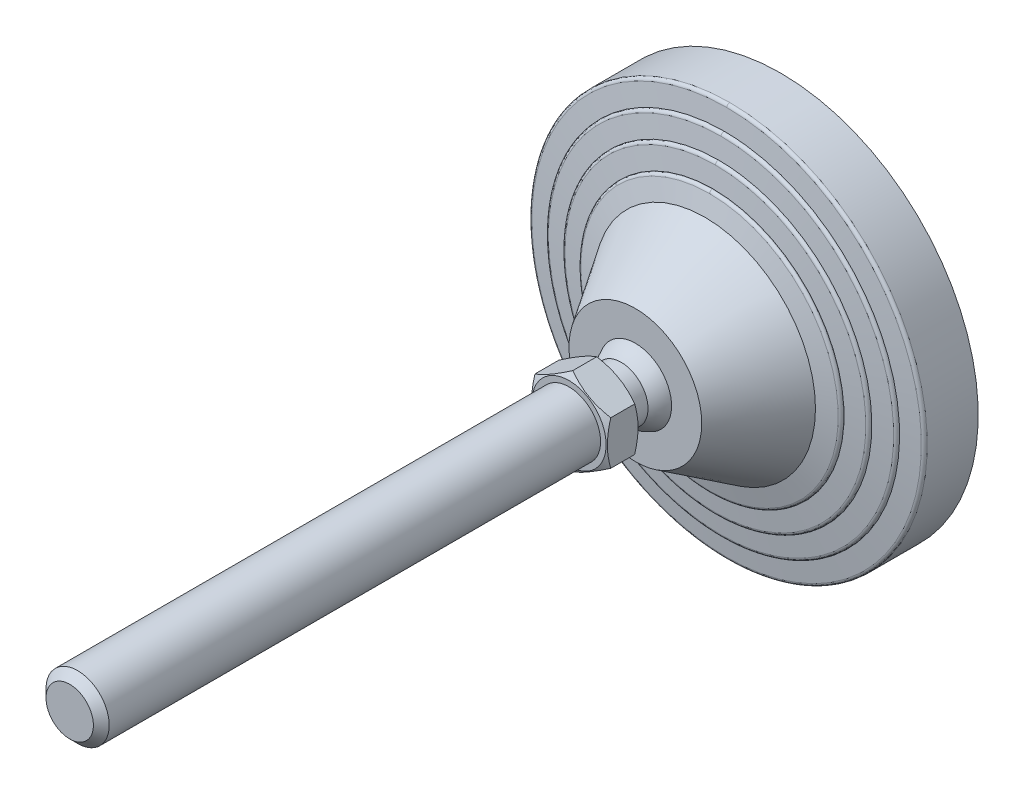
ISO-10303-21;
HEADER;
FILE_DESCRIPTION(('STEP AP214'),'2;1');
FILE_NAME('part.step','',(''),(''),'','','');
FILE_SCHEMA(('AUTOMOTIVE_DESIGN { 1 0 10303 214 1 1 1 1 }'));
ENDSEC;
DATA;
#1=APPLICATION_CONTEXT('core data for automotive mechanical design processes');
#2=APPLICATION_PROTOCOL_DEFINITION('international standard','automotive_design',2000,#1);
#3=PRODUCT_CONTEXT('',#1,'mechanical');
#4=PRODUCT('Part','Part','',(#3));
#5=PRODUCT_RELATED_PRODUCT_CATEGORY('part','',(#4));
#6=PRODUCT_DEFINITION_FORMATION('','',#4);
#7=PRODUCT_DEFINITION_CONTEXT('part definition',#1,'design');
#8=PRODUCT_DEFINITION('design','',#6,#7);
#9=PRODUCT_DEFINITION_SHAPE('','',#8);
#10=(LENGTH_UNIT() NAMED_UNIT(*) SI_UNIT(.MILLI.,.METRE.));
#11=(NAMED_UNIT(*) PLANE_ANGLE_UNIT() SI_UNIT($,.RADIAN.));
#12=(NAMED_UNIT(*) SI_UNIT($,.STERADIAN.) SOLID_ANGLE_UNIT());
#13=UNCERTAINTY_MEASURE_WITH_UNIT(LENGTH_MEASURE(1.E-05),#10,'distance_accuracy_value','');
#14=(GEOMETRIC_REPRESENTATION_CONTEXT(3) GLOBAL_UNCERTAINTY_ASSIGNED_CONTEXT((#13)) GLOBAL_UNIT_ASSIGNED_CONTEXT((#10,
#11,#12)) REPRESENTATION_CONTEXT('',''));
#15=CARTESIAN_POINT('',(0.,0.,0.));
#16=DIRECTION('',(0.,0.,1.));
#17=DIRECTION('',(1.,0.,0.));
#18=AXIS2_PLACEMENT_3D('',#15,#16,#17);
#19=CARTESIAN_POINT('',(-55.851524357,55.66,0.));
#20=DIRECTION('',(0.,0.,1.));
#21=DIRECTION('',(0.,-1.,0.));
#22=AXIS2_PLACEMENT_3D('',#19,#20,#21);
#23=PLANE('',#22);
#24=CARTESIAN_POINT('',(0.,0.,0.));
#25=DIRECTION('',(0.,0.,-1.));
#26=DIRECTION('',(0.,1.,0.));
#27=AXIS2_PLACEMENT_3D('',#24,#25,#26);
#28=CIRCLE('',#27,55.);
#29=CARTESIAN_POINT('',(0.,55.,0.));
#30=VERTEX_POINT('',#29);
#31=EDGE_CURVE('E250',#30,#30,#28,.F.);
#32=ORIENTED_EDGE('',*,*,#31,.F.);
#33=EDGE_LOOP('',(#32));
#34=FACE_BOUND('',#33,.T.);
#35=ADVANCED_FACE('F14',(#34),#23,.F.);
#36=CARTESIAN_POINT('',(0.,0.,3.));
#37=DIRECTION('',(0.,0.,-1.));
#38=DIRECTION('',(0.,1.,0.));
#39=AXIS2_PLACEMENT_3D('',#36,#37,#38);
#40=CYLINDRICAL_SURFACE('',#39,55.);
#41=ORIENTED_EDGE('',*,*,#31,.T.);
#42=EDGE_LOOP('',(#41));
#43=FACE_BOUND('',#42,.T.);
#44=CARTESIAN_POINT('',(0.,0.,3.));
#45=DIRECTION('',(0.,0.,-1.));
#46=DIRECTION('',(0.,1.,0.));
#47=AXIS2_PLACEMENT_3D('',#44,#45,#46);
#48=CIRCLE('',#47,55.);
#49=CARTESIAN_POINT('',(0.,55.,3.));
#50=VERTEX_POINT('',#49);
#51=EDGE_CURVE('E248',#50,#50,#48,.T.);
#52=ORIENTED_EDGE('',*,*,#51,.T.);
#53=EDGE_LOOP('',(#52));
#54=FACE_BOUND('',#53,.T.);
#55=ADVANCED_FACE('F393',(#43,#54),#40,.T.);
#56=CARTESIAN_POINT('',(-63.467641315,63.25,2.99999999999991));
#57=DIRECTION('',(0.,0.,1.));
#58=DIRECTION('',(0.,-1.,0.));
#59=AXIS2_PLACEMENT_3D('',#56,#57,#58);
#60=PLANE('',#59);
#61=ORIENTED_EDGE('',*,*,#51,.F.);
#62=EDGE_LOOP('',(#61));
#63=FACE_BOUND('',#62,.T.);
#64=CARTESIAN_POINT('',(0.,0.,3.));
#65=DIRECTION('',(0.,0.,-1.));
#66=DIRECTION('',(0.,1.,0.));
#67=AXIS2_PLACEMENT_3D('',#64,#65,#66);
#68=CIRCLE('',#67,62.5);
#69=CARTESIAN_POINT('',(0.,62.5,3.));
#70=VERTEX_POINT('',#69);
#71=EDGE_CURVE('E244',#70,#70,#68,.F.);
#72=ORIENTED_EDGE('',*,*,#71,.F.);
#73=EDGE_LOOP('',(#72));
#74=FACE_BOUND('',#73,.T.);
#75=ADVANCED_FACE('F389',(#63,#74),#60,.F.);
#76=CARTESIAN_POINT('',(0.,0.,19.119206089));
#77=DIRECTION('',(0.,0.,-1.));
#78=DIRECTION('',(0.,1.,0.));
#79=AXIS2_PLACEMENT_3D('',#76,#77,#78);
#80=CYLINDRICAL_SURFACE('',#79,62.5);
#81=ORIENTED_EDGE('',*,*,#71,.T.);
#82=EDGE_LOOP('',(#81));
#83=FACE_BOUND('',#82,.T.);
#84=CARTESIAN_POINT('',(0.,0.,19.119206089));
#85=DIRECTION('',(0.,0.,1.));
#86=DIRECTION('',(0.,-1.,0.));
#87=AXIS2_PLACEMENT_3D('',#84,#85,#86);
#88=CIRCLE('',#87,62.5);
#89=CARTESIAN_POINT('',(-6.40950867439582E-09,-62.5,19.119206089));
#90=VERTEX_POINT('',#89);
#91=CARTESIAN_POINT('',(0.,62.5,19.119206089));
#92=VERTEX_POINT('',#91);
#93=EDGE_CURVE('E531',#90,#92,#88,.T.);
#94=ORIENTED_EDGE('',*,*,#93,.F.);
#95=CARTESIAN_POINT('',(0.,0.,19.119206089));
#96=DIRECTION('',(0.,0.,1.));
#97=DIRECTION('',(0.,-1.,0.));
#98=AXIS2_PLACEMENT_3D('',#95,#96,#97);
#99=CIRCLE('',#98,62.5);
#100=EDGE_CURVE('E247',#92,#90,#99,.T.);
#101=ORIENTED_EDGE('',*,*,#100,.F.);
#102=EDGE_LOOP('',(#94,#101));
#103=FACE_BOUND('',#102,.T.);
#104=ADVANCED_FACE('F392',(#83,#103),#80,.T.);
#105=CARTESIAN_POINT('',(0.,-62.5,19.119206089));
#106=CARTESIAN_POINT('',(-125.,-62.5,19.1192060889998));
#107=CARTESIAN_POINT('',(-125.,62.5,19.1192060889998));
#108=CARTESIAN_POINT('',(0.,62.5,19.119206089));
#109=CARTESIAN_POINT('',(0.,-62.5,19.647800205));
#110=CARTESIAN_POINT('',(-125.,-62.5,19.6478002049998));
#111=CARTESIAN_POINT('',(-125.,62.5,19.6478002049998));
#112=CARTESIAN_POINT('',(0.,62.5,19.647800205));
#113=CARTESIAN_POINT('',(0.,-62.1506185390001,20.044466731));
#114=CARTESIAN_POINT('',(-124.301237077,-62.150618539,20.0444667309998));
#115=CARTESIAN_POINT('',(-124.301237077,62.150618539,20.0444667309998));
#116=CARTESIAN_POINT('',(0.,62.1506185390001,20.044466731));
#117=CARTESIAN_POINT('',(0.,-61.62625428,20.111204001));
#118=CARTESIAN_POINT('',(-123.252508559,-61.6262542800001,20.1112040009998));
#119=CARTESIAN_POINT('',(-123.252508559,61.6262542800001,20.1112040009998));
#120=CARTESIAN_POINT('',(0.,61.62625428,20.111204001));
#121=(BOUNDED_SURFACE() B_SPLINE_SURFACE(3,3,((#105,#106,#107,#108),(#109,#110,#111,#112),(#113,
#114,#115,#116),(#117,#118,#119,#120)),.UNSPECIFIED.,.F.,.F.,
.F.) B_SPLINE_SURFACE_WITH_KNOTS((4,4),(4,4),(0.,1.),(0.,1.),
.UNSPECIFIED.) GEOMETRIC_REPRESENTATION_ITEM() RATIONAL_B_SPLINE_SURFACE(((1.,0.333333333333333,
0.333333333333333,1.),(0.833611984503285,0.277870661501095,0.277870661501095,0.833611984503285),
(0.833611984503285,0.277870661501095,0.277870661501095,0.833611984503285),(1.,0.333333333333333,
0.333333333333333,1.))) REPRESENTATION_ITEM('') SURFACE());
#122=CARTESIAN_POINT('',(0.,62.5,19.119206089));
#123=CARTESIAN_POINT('',(0.,62.5,19.647800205));
#124=CARTESIAN_POINT('',(0.,62.1506185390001,20.044466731));
#125=CARTESIAN_POINT('',(0.,61.62625428,20.111204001));
#126=(BOUNDED_CURVE() B_SPLINE_CURVE(3,(#122,#123,#124,#125),.UNSPECIFIED.,.F.,
.F.) B_SPLINE_CURVE_WITH_KNOTS((4,4),(0.,1.),
.UNSPECIFIED.) CURVE() GEOMETRIC_REPRESENTATION_ITEM() RATIONAL_B_SPLINE_CURVE((1.,
0.833611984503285,0.833611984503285,1.)) REPRESENTATION_ITEM(''));
#127=CARTESIAN_POINT('',(0.,61.6262542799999,20.1112040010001));
#128=VERTEX_POINT('',#127);
#129=EDGE_CURVE('E522',#92,#128,#126,.T.);
#130=CARTESIAN_POINT('',(0.,-62.5,19.119206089));
#131=CARTESIAN_POINT('',(0.,-62.5,19.647800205));
#132=CARTESIAN_POINT('',(0.,-62.1506185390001,20.044466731));
#133=CARTESIAN_POINT('',(0.,-61.62625428,20.111204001));
#134=(BOUNDED_CURVE() B_SPLINE_CURVE(3,(#130,#131,#132,#133),.UNSPECIFIED.,.F.,
.F.) B_SPLINE_CURVE_WITH_KNOTS((4,4),(0.,1.),
.UNSPECIFIED.) CURVE() GEOMETRIC_REPRESENTATION_ITEM() RATIONAL_B_SPLINE_CURVE((1.,
0.833611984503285,0.833611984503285,1.)) REPRESENTATION_ITEM(''));
#135=CARTESIAN_POINT('',(-1.89596619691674E-08,-61.6262542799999,20.1112040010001));
#136=VERTEX_POINT('',#135);
#137=EDGE_CURVE('E536',#136,#90,#134,.F.);
#138=CARTESIAN_POINT('',(0.,0.,20.1112040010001));
#139=DIRECTION('',(0.,0.,-1.));
#140=DIRECTION('',(0.,1.,0.));
#141=AXIS2_PLACEMENT_3D('',#138,#139,#140);
#142=CIRCLE('',#141,61.62625428);
#143=EDGE_CURVE('E515',#128,#136,#142,.F.);
#144=ORIENTED_EDGE('',*,*,#129,.F.);
#145=ORIENTED_EDGE('',*,*,#100,.T.);
#146=ORIENTED_EDGE('',*,*,#137,.F.);
#147=ORIENTED_EDGE('',*,*,#143,.F.);
#148=EDGE_LOOP('',(#144,#145,#146,#147));
#149=FACE_BOUND('',#148,.T.);
#150=ADVANCED_FACE('F716',(#149),#121,.T.);
#151=CARTESIAN_POINT('',(0.,62.5,19.119206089));
#152=CARTESIAN_POINT('',(125.,62.5,19.1192060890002));
#153=CARTESIAN_POINT('',(125.,-62.5,19.1192060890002));
#154=CARTESIAN_POINT('',(0.,-62.5,19.119206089));
#155=CARTESIAN_POINT('',(0.,62.5,19.647800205));
#156=CARTESIAN_POINT('',(125.,62.5,19.6478002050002));
#157=CARTESIAN_POINT('',(125.,-62.5,19.6478002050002));
#158=CARTESIAN_POINT('',(0.,-62.5,19.647800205));
#159=CARTESIAN_POINT('',(0.,62.1506185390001,20.044466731));
#160=CARTESIAN_POINT('',(124.301237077,62.150618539,20.0444667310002));
#161=CARTESIAN_POINT('',(124.301237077,-62.150618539,20.0444667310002));
#162=CARTESIAN_POINT('',(0.,-62.1506185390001,20.044466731));
#163=CARTESIAN_POINT('',(0.,61.62625428,20.111204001));
#164=CARTESIAN_POINT('',(123.252508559,61.6262542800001,20.1112040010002));
#165=CARTESIAN_POINT('',(123.252508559,-61.6262542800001,20.1112040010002));
#166=CARTESIAN_POINT('',(0.,-61.62625428,20.111204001));
#167=(BOUNDED_SURFACE() B_SPLINE_SURFACE(3,3,((#151,#152,#153,#154),(#155,#156,#157,#158),(#159,
#160,#161,#162),(#163,#164,#165,#166)),.UNSPECIFIED.,.F.,.F.,
.F.) B_SPLINE_SURFACE_WITH_KNOTS((4,4),(4,4),(0.,1.),(0.,1.),
.UNSPECIFIED.) GEOMETRIC_REPRESENTATION_ITEM() RATIONAL_B_SPLINE_SURFACE(((1.,0.333333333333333,
0.333333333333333,1.),(0.833611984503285,0.277870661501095,0.277870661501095,0.833611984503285),
(0.833611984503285,0.277870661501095,0.277870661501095,0.833611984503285),(1.,0.333333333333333,
0.333333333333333,1.))) REPRESENTATION_ITEM('') SURFACE());
#168=CARTESIAN_POINT('',(0.,0.,20.1112040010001));
#169=DIRECTION('',(0.,0.,-1.));
#170=DIRECTION('',(0.,1.,0.));
#171=AXIS2_PLACEMENT_3D('',#168,#169,#170);
#172=CIRCLE('',#171,61.62625428);
#173=EDGE_CURVE('E521',#136,#128,#172,.F.);
#174=ORIENTED_EDGE('',*,*,#93,.T.);
#175=ORIENTED_EDGE('',*,*,#129,.T.);
#176=ORIENTED_EDGE('',*,*,#173,.F.);
#177=ORIENTED_EDGE('',*,*,#137,.T.);
#178=EDGE_LOOP('',(#174,#175,#176,#177));
#179=FACE_BOUND('',#178,.T.);
#180=ADVANCED_FACE('F229',(#179),#167,.T.);
#181=CARTESIAN_POINT('',(0.,0.,20.890909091));
#182=DIRECTION('',(0.,0.,-1.));
#183=DIRECTION('',(1.,0.,0.));
#184=AXIS2_PLACEMENT_3D('',#181,#182,#183);
#185=CONICAL_SURFACE('',#184,55.5,1.44420419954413);
#186=ORIENTED_EDGE('',*,*,#143,.T.);
#187=ORIENTED_EDGE('',*,*,#173,.T.);
#188=EDGE_LOOP('',(#186,#187));
#189=FACE_BOUND('',#188,.T.);
#190=CARTESIAN_POINT('',(-1.13831247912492E-08,-55.5,20.890909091));
#191=CARTESIAN_POINT('',(0.666810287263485,-55.5000058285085,20.890909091));
#192=CARTESIAN_POINT('',(1.33362158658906,-55.4879831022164,20.890909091));
#193=CARTESIAN_POINT('',(2.66828219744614,-55.4398527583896,20.890909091));
#194=CARTESIAN_POINT('',(3.33612903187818,-55.4036764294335,20.890909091));
#195=CARTESIAN_POINT('',(4.67008368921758,-55.3072108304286,20.890909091));
#196=CARTESIAN_POINT('',(5.33619149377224,-55.2469213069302,20.890909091));
#197=CARTESIAN_POINT('',(6.6663069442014,-55.1022519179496,20.890909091));
#198=CARTESIAN_POINT('',(7.33031261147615,-55.0178537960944,20.890909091));
#199=CARTESIAN_POINT('',(8.65488946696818,-54.825094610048,20.890909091));
#200=CARTESIAN_POINT('',(9.31546019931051,-54.716730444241,20.890909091));
#201=CARTESIAN_POINT('',(11.3032442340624,-54.3535835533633,20.890909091));
#202=CARTESIAN_POINT('',(12.6239565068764,-54.062110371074,20.890909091));
#203=CARTESIAN_POINT('',(15.2407929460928,-53.3834839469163,20.890909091));
#204=CARTESIAN_POINT('',(16.5369104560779,-52.9963051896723,20.890909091));
#205=CARTESIAN_POINT('',(19.0989356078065,-52.127842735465,20.890909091));
#206=CARTESIAN_POINT('',(20.3648068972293,-51.6464516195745,20.890909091));
#207=CARTESIAN_POINT('',(22.8579438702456,-50.5924539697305,20.890909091));
#208=CARTESIAN_POINT('',(24.0852091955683,-50.0198465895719,20.890909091));
#209=CARTESIAN_POINT('',(26.6786676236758,-48.6922162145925,20.8909090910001));
#210=CARTESIAN_POINT('',(28.0374663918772,-47.9226902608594,20.890909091));
#211=CARTESIAN_POINT('',(30.6855194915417,-46.2718474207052,20.890909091));
#212=CARTESIAN_POINT('',(31.974765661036,-45.3905174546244,20.890909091));
#213=CARTESIAN_POINT('',(34.4745529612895,-43.5222940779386,20.890909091));
#214=CARTESIAN_POINT('',(35.6850872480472,-42.5353915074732,20.890909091));
#215=CARTESIAN_POINT('',(38.0186685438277,-40.4631409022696,20.8909090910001));
#216=CARTESIAN_POINT('',(39.1417181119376,-39.3777957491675,20.8909090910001));
#217=CARTESIAN_POINT('',(41.2923479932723,-37.1163936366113,20.8909090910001));
#218=CARTESIAN_POINT('',(42.3199319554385,-35.9403401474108,20.8909090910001));
#219=CARTESIAN_POINT('',(44.2723789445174,-33.5058382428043,20.8909090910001));
#220=CARTESIAN_POINT('',(45.1972412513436,-32.2473892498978,20.8909090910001));
#221=CARTESIAN_POINT('',(46.9376312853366,-29.6570957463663,20.8909090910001));
#222=CARTESIAN_POINT('',(47.7531628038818,-28.3252537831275,20.8909090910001));
#223=CARTESIAN_POINT('',(49.2691299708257,-25.5976050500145,20.8909090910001));
#224=CARTESIAN_POINT('',(49.9695658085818,-24.201798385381,20.8909090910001));
#225=CARTESIAN_POINT('',(51.2503706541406,-21.3561258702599,20.8909090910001));
#226=CARTESIAN_POINT('',(51.8307383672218,-19.9062594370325,20.8909090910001));
#227=CARTESIAN_POINT('',(52.8672716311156,-16.9627885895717,20.8909090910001));
#228=CARTESIAN_POINT('',(53.3234371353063,-15.4691841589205,20.8909090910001));
#229=CARTESIAN_POINT('',(54.1083272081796,-12.4488388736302,20.8909090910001));
#230=CARTESIAN_POINT('',(54.4370503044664,-10.9220976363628,20.8909090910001));
#231=CARTESIAN_POINT('',(54.9647110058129,-7.84634988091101,20.8909090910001));
#232=CARTESIAN_POINT('',(55.1636486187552,-6.29734336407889,20.8909090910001));
#233=CARTESIAN_POINT('',(55.4303245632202,-3.18807153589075,20.8909090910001));
#234=CARTESIAN_POINT('',(55.4980623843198,-1.62780618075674,20.8909090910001));
#235=CARTESIAN_POINT('',(55.5018556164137,1.49288460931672,20.8909090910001));
#236=CARTESIAN_POINT('',(55.4379110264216,3.05331004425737,20.8909090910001));
#237=CARTESIAN_POINT('',(55.1787965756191,6.16319684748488,20.8909090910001));
#238=CARTESIAN_POINT('',(54.9836292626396,7.71265842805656,20.8909090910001));
#239=CARTESIAN_POINT('',(54.4634594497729,10.7896325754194,20.8909090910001));
#240=CARTESIAN_POINT('',(54.1384569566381,12.3171451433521,20.8909090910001));
#241=CARTESIAN_POINT('',(53.3609336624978,15.3393372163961,20.8909090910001));
#242=CARTESIAN_POINT('',(52.9084149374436,16.8340172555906,20.8909090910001));
#243=CARTESIAN_POINT('',(51.8790738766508,19.7799443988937,20.8909090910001));
#244=CARTESIAN_POINT('',(51.3022515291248,21.2311914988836,20.8909090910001));
#245=CARTESIAN_POINT('',(50.0283709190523,24.0800097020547,20.8909090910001));
#246=CARTESIAN_POINT('',(49.3313064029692,25.4775780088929,20.8909090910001));
#247=CARTESIAN_POINT('',(47.8219174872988,28.2090226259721,20.8909090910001));
#248=CARTESIAN_POINT('',(47.009593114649,29.5428989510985,20.8909090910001));
#249=CARTESIAN_POINT('',(45.275439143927,32.137509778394,20.890909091));
#250=CARTESIAN_POINT('',(44.3536065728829,33.3982422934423,20.8909090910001));
#251=CARTESIAN_POINT('',(42.4069961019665,35.8375708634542,20.8909090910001));
#252=CARTESIAN_POINT('',(41.3822180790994,37.0161668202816,20.8909090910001));
#253=CARTESIAN_POINT('',(39.2371577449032,39.28269451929,20.890909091));
#254=CARTESIAN_POINT('',(38.11688550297,40.3706357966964,20.890909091));
#255=CARTESIAN_POINT('',(35.7885615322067,42.4483529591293,20.890909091));
#256=CARTESIAN_POINT('',(34.5805102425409,43.4381293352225,20.8909090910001));
#257=CARTESIAN_POINT('',(32.5014047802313,44.999906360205,20.890909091));
#258=CARTESIAN_POINT('',(31.6521856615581,45.6012216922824,20.890909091));
#259=CARTESIAN_POINT('',(29.9212415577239,46.7552239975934,20.890909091));
#260=CARTESIAN_POINT('',(29.0395163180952,47.3079105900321,20.890909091));
#261=CARTESIAN_POINT('',(27.2463975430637,48.3628576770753,20.890909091));
#262=CARTESIAN_POINT('',(26.3350034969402,48.8651173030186,20.890909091));
#263=CARTESIAN_POINT('',(24.4853750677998,49.8176528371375,20.890909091));
#264=CARTESIAN_POINT('',(23.5471392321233,50.2679259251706,20.890909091));
#265=CARTESIAN_POINT('',(21.6468644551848,51.1150215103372,20.890909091));
#266=CARTESIAN_POINT('',(20.6848259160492,51.5118449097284,20.890909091));
#267=CARTESIAN_POINT('',(18.7400290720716,52.2507726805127,20.890909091));
#268=CARTESIAN_POINT('',(17.757272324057,52.5928811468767,20.890909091));
#269=CARTESIAN_POINT('',(15.8636176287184,53.1929617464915,20.890909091));
#270=CARTESIAN_POINT('',(14.9542390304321,53.4557406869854,20.890909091));
#271=CARTESIAN_POINT('',(13.1232854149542,53.9344479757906,20.890909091));
#272=CARTESIAN_POINT('',(12.2017111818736,54.1503793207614,20.890909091));
#273=CARTESIAN_POINT('',(10.3487557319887,54.53483789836,20.890909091));
#274=CARTESIAN_POINT('',(9.41737477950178,54.7033664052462,20.890909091));
#275=CARTESIAN_POINT('',(7.54728204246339,54.9925789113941,20.890909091));
#276=CARTESIAN_POINT('',(6.60857079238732,55.1132663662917,20.890909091));
#277=CARTESIAN_POINT('',(4.72616569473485,55.3064952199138,20.890909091));
#278=CARTESIAN_POINT('',(3.7824716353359,55.3790345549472,20.890909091));
#279=CARTESIAN_POINT('',(1.89251924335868,55.4758006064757,20.890909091));
#280=CARTESIAN_POINT('',(0.946260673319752,55.5000226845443,20.890909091));
#281=CARTESIAN_POINT('',(-1.66119463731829E-09,55.5,20.890909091));
#282=B_SPLINE_CURVE_WITH_KNOTS('',3,(#190,#191,#192,#193,#194,#195,#196,#197,#198,#199,#200,
#201,#202,#203,#204,#205,#206,#207,#208,#209,#210,#211,#212,#213,#214,#215,#216,#217,#218,#219,
#220,#221,#222,#223,#224,#225,#226,#227,#228,#229,#230,#231,#232,#233,#234,#235,#236,#237,#238,
#239,#240,#241,#242,#243,#244,#245,#246,#247,#248,#249,#250,#251,#252,#253,#254,#255,#256,#257,
#258,#259,#260,#261,#262,#263,#264,#265,#266,#267,#268,#269,#270,#271,#272,#273,#274,#275,#276,
#277,#278,#279,#280,#281),.UNSPECIFIED.,.F.,.F.,(4,2,2,2,2,2,2,2,2,2,2,2,2,2,2,2,2,2,2,2,2,2,2,
2,2,2,2,2,2,2,2,2,2,2,2,2,2,2,2,2,2,2,2,2,2,4),(0.,2.00032482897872,4.00636450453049,
6.0124252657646,8.02000917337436,10.0278530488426,14.081391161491,18.1360111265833,
22.1952813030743,26.2545891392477,30.9336173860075,35.6131935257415,40.2931760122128,
44.9730215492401,49.6526881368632,54.332387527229,59.0119245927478,63.6914539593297,
68.3710337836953,73.0506153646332,77.730251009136,82.4098863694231,87.0895399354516,
91.7691935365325,96.4487562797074,101.128318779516,105.807805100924,110.487291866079,
115.167022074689,119.846751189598,124.526607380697,129.206469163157,133.885838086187,
138.565183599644,141.685351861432,144.805544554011,147.9257909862,151.046206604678,
154.166569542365,157.286698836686,160.125236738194,162.963593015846,165.801872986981,
168.63994790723,171.478144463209,174.316613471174),.UNSPECIFIED.);
#283=CARTESIAN_POINT('',(-1.13832681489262E-08,-55.5,20.895966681));
#284=VERTEX_POINT('',#283);
#285=CARTESIAN_POINT('',(-1.66121225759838E-09,55.5,20.895966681));
#286=VERTEX_POINT('',#285);
#287=EDGE_CURVE('E210',#284,#286,#282,.T.);
#288=ORIENTED_EDGE('',*,*,#287,.F.);
#289=CARTESIAN_POINT('',(-1.66120885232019E-09,55.5,20.890909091));
#290=CARTESIAN_POINT('',(-0.666810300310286,55.5000058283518,20.890909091));
#291=CARTESIAN_POINT('',(-1.3336215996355,55.4879831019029,20.890909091));
#292=CARTESIAN_POINT('',(-2.66828221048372,55.4398527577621,20.890909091));
#293=CARTESIAN_POINT('',(-3.33612904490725,55.403676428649,20.890909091));
#294=CARTESIAN_POINT('',(-4.67008370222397,55.3072108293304,20.890909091));
#295=CARTESIAN_POINT('',(-5.33619150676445,55.2469213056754,20.890909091));
#296=CARTESIAN_POINT('',(-6.66630695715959,55.1022519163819,20.890909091));
#297=CARTESIAN_POINT('',(-7.33031262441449,55.0178537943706,20.890909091));
#298=CARTESIAN_POINT('',(-8.65488947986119,54.8250946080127,20.890909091));
#299=CARTESIAN_POINT('',(-9.31546021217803,54.7167304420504,20.890909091));
#300=CARTESIAN_POINT('',(-11.3032442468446,54.3535835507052,20.890909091));
#301=CARTESIAN_POINT('',(-12.62395651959,54.0621103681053,20.890909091));
#302=CARTESIAN_POINT('',(-15.2407929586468,53.3834839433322,20.890909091));
#303=CARTESIAN_POINT('',(-16.5369104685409,52.9963051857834,20.890909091));
#304=CARTESIAN_POINT('',(-19.0989356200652,52.1278427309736,20.890909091));
#305=CARTESIAN_POINT('',(-20.3648069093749,51.6464516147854,20.890909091));
#306=CARTESIAN_POINT('',(-22.8579438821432,50.5924539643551,20.890909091));
#307=CARTESIAN_POINT('',(-24.0852092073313,50.0198465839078,20.890909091));
#308=CARTESIAN_POINT('',(-26.6786676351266,48.6922162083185,20.890909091));
#309=CARTESIAN_POINT('',(-28.0374664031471,47.9226902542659,20.890909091));
#310=CARTESIAN_POINT('',(-30.6855195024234,46.271847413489,20.890909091));
#311=CARTESIAN_POINT('',(-31.9747656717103,45.390517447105,20.890909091));
#312=CARTESIAN_POINT('',(-34.4745529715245,43.5222940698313,20.8909090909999));
#313=CARTESIAN_POINT('',(-35.6850872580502,42.5353914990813,20.8909090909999));
#314=CARTESIAN_POINT('',(-38.0186685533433,40.4631408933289,20.8909090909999));
#315=CARTESIAN_POINT('',(-39.1417181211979,39.3777957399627,20.890909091));
#316=CARTESIAN_POINT('',(-41.2923480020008,37.1163936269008,20.890909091));
#317=CARTESIAN_POINT('',(-42.3199319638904,35.9403401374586,20.8909090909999));
#318=CARTESIAN_POINT('',(-44.2723789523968,33.5058382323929,20.8909090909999));
#319=CARTESIAN_POINT('',(-45.1972412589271,32.247389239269,20.8909090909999));
#320=CARTESIAN_POINT('',(-46.937631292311,29.6570957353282,20.8909090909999));
#321=CARTESIAN_POINT('',(-47.753162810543,28.3252537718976,20.8909090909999));
#322=CARTESIAN_POINT('',(-49.2691299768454,25.5976050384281,20.8909090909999));
#323=CARTESIAN_POINT('',(-49.9695658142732,24.2017983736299,20.890909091));
#324=CARTESIAN_POINT('',(-51.2503706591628,21.3561258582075,20.890909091));
#325=CARTESIAN_POINT('',(-51.8307383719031,19.9062594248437,20.8909090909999));
#326=CARTESIAN_POINT('',(-52.8672716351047,16.9627885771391,20.8909090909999));
#327=CARTESIAN_POINT('',(-53.3234371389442,15.4691841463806,20.8909090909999));
#328=CARTESIAN_POINT('',(-54.1083272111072,12.4488388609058,20.8909090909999));
#329=CARTESIAN_POINT('',(-54.437050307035,10.9220976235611,20.8909090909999));
#330=CARTESIAN_POINT('',(-54.9647110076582,7.84634986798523,20.8909090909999));
#331=CARTESIAN_POINT('',(-55.1636486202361,6.29734335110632,20.8909090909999));
#332=CARTESIAN_POINT('',(-55.4303245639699,3.18807152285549,20.8909090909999));
#333=CARTESIAN_POINT('',(-55.4980623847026,1.62780616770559,20.8909090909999));
#334=CARTESIAN_POINT('',(-55.5018556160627,-1.49288462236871,20.8909090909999));
#335=CARTESIAN_POINT('',(-55.4379110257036,-3.05331005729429,20.8909090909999));
#336=CARTESIAN_POINT('',(-55.1787965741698,-6.16319686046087,20.8909090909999));
#337=CARTESIAN_POINT('',(-54.9836292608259,-7.71265844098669,20.8909090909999));
#338=CARTESIAN_POINT('',(-54.4634594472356,-10.7896325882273,20.8909090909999));
#339=CARTESIAN_POINT('',(-54.1384569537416,-12.3171451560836,20.890909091));
#340=CARTESIAN_POINT('',(-53.3609336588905,-15.3393372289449,20.890909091));
#341=CARTESIAN_POINT('',(-52.9084149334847,-16.8340172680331,20.8909090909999));
#342=CARTESIAN_POINT('',(-51.8790738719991,-19.7799444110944,20.8909090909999));
#343=CARTESIAN_POINT('',(-51.3022515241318,-21.2311915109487,20.8909090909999));
#344=CARTESIAN_POINT('',(-50.0283709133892,-24.0800097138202,20.8909090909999));
#345=CARTESIAN_POINT('',(-49.3313063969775,-25.4775780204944,20.8909090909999));
#346=CARTESIAN_POINT('',(-47.8219174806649,-28.2090226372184,20.8909090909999));
#347=CARTESIAN_POINT('',(-47.0095931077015,-29.5428989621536,20.8909090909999));
#348=CARTESIAN_POINT('',(-45.2754391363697,-32.1375097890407,20.890909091));
#349=CARTESIAN_POINT('',(-44.3536065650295,-33.3982423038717,20.8909090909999));
#350=CARTESIAN_POINT('',(-42.4069960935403,-35.837570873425,20.8909090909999));
#351=CARTESIAN_POINT('',(-41.3822180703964,-37.0161668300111,20.8909090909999));
#352=CARTESIAN_POINT('',(-39.2371577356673,-39.2826945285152,20.8909090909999));
#353=CARTESIAN_POINT('',(-38.1168854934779,-40.3706358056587,20.890909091));
#354=CARTESIAN_POINT('',(-35.7885615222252,-42.4483529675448,20.890909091));
#355=CARTESIAN_POINT('',(-34.5805102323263,-43.4381293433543,20.890909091));
#356=CARTESIAN_POINT('',(-32.501404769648,-44.9999063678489,20.890909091));
#357=CARTESIAN_POINT('',(-31.6521856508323,-45.6012216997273,20.890909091));
#358=CARTESIAN_POINT('',(-29.9212415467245,-46.7552240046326,20.890909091));
#359=CARTESIAN_POINT('',(-29.0395163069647,-47.3079105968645,20.890909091));
#360=CARTESIAN_POINT('',(-27.2463975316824,-48.3628576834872,20.890909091));
#361=CARTESIAN_POINT('',(-26.3350034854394,-48.8651173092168,20.890909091));
#362=CARTESIAN_POINT('',(-24.4853750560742,-49.8176528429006,20.890909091));
#363=CARTESIAN_POINT('',(-23.5471392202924,-50.2679259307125,20.890909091));
#364=CARTESIAN_POINT('',(-21.6468644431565,-51.1150215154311,20.890909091));
#365=CARTESIAN_POINT('',(-20.6848259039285,-51.5118449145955,20.890909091));
#366=CARTESIAN_POINT('',(-18.7400290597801,-52.2507726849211,20.890909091));
#367=CARTESIAN_POINT('',(-17.7572723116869,-52.5928811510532,20.890909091));
#368=CARTESIAN_POINT('',(-15.8636176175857,-53.192961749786,20.890909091));
#369=CARTESIAN_POINT('',(-14.9542390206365,-53.4557406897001,20.890909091));
#370=CARTESIAN_POINT('',(-13.1232854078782,-53.934447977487,20.890909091));
#371=CARTESIAN_POINT('',(-12.2017111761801,-54.1503793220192,20.890909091));
#372=CARTESIAN_POINT('',(-10.3487557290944,-54.5348378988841,20.890909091));
#373=CARTESIAN_POINT('',(-9.41737477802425,-54.7033664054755,20.890909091));
#374=CARTESIAN_POINT('',(-7.54728204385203,-54.9925789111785,20.890909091));
#375=CARTESIAN_POINT('',(-6.60857079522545,-55.1132663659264,20.890909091));
#376=CARTESIAN_POINT('',(-4.72616570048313,-55.3064952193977,20.890909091));
#377=CARTESIAN_POINT('',(-3.78247164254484,-55.37903455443,20.890909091));
#378=CARTESIAN_POINT('',(-1.89251925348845,-55.4758006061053,20.890909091));
#379=CARTESIAN_POINT('',(-0.946260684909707,-55.5000226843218,20.890909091));
#380=CARTESIAN_POINT('',(-1.13832640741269E-08,-55.5,20.890909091));
#381=B_SPLINE_CURVE_WITH_KNOTS('',3,(#289,#290,#291,#292,#293,#294,#295,#296,#297,#298,#299,
#300,#301,#302,#303,#304,#305,#306,#307,#308,#309,#310,#311,#312,#313,#314,#315,#316,#317,#318,
#319,#320,#321,#322,#323,#324,#325,#326,#327,#328,#329,#330,#331,#332,#333,#334,#335,#336,#337,
#338,#339,#340,#341,#342,#343,#344,#345,#346,#347,#348,#349,#350,#351,#352,#353,#354,#355,#356,
#357,#358,#359,#360,#361,#362,#363,#364,#365,#366,#367,#368,#369,#370,#371,#372,#373,#374,#375,
#376,#377,#378,#379,#380),.UNSPECIFIED.,.F.,.F.,(4,2,2,2,2,2,2,2,2,2,2,2,2,2,2,2,2,2,2,2,2,2,2,
2,2,2,2,2,2,2,2,2,2,2,2,2,2,2,2,2,2,2,2,2,2,4),(0.,2.00032482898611,4.00636450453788,
6.012425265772,8.02000917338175,10.02785304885,14.0813911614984,18.1360111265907,
22.1952813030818,26.2545891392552,30.933617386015,35.6131935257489,40.2931760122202,
44.9730215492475,49.6526881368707,54.3323875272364,59.0119245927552,63.6914539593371,
68.3710337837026,73.0506153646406,77.7302510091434,82.4098863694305,87.0895399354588,
91.7691935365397,96.4487562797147,101.128318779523,105.807805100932,110.487291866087,
115.167022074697,119.846751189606,124.526607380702,129.206469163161,133.885838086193,
138.565183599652,141.685351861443,144.805544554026,147.92579098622,151.046206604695,
154.166569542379,157.286698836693,160.125236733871,162.96359300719,165.801872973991,
168.639947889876,171.478144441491,174.316613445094),.UNSPECIFIED.);
#382=EDGE_CURVE('E222',#286,#284,#381,.T.);
#383=ORIENTED_EDGE('',*,*,#382,.F.);
#384=EDGE_LOOP('',(#288,#383));
#385=FACE_BOUND('',#384,.T.);
#386=ADVANCED_FACE('F224',(#189,#385),#185,.T.);
#387=CARTESIAN_POINT('',(0.,-55.5,20.887804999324));
#388=CARTESIAN_POINT('',(-111.,-55.5000000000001,20.8878049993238));
#389=CARTESIAN_POINT('',(-111.,55.5000000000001,20.8878049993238));
#390=CARTESIAN_POINT('',(0.,55.5,20.887804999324));
#391=CARTESIAN_POINT('',(0.,-55.5,20.892211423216));
#392=CARTESIAN_POINT('',(-111.,-55.5000000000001,20.8922114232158));
#393=CARTESIAN_POINT('',(-111.,55.5000000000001,20.8922114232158));
#394=CARTESIAN_POINT('',(0.,55.5,20.892211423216));
#395=CARTESIAN_POINT('',(0.,-55.5,20.896617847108));
#396=CARTESIAN_POINT('',(-111.,-55.5000000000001,20.8966178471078));
#397=CARTESIAN_POINT('',(-111.,55.5000000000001,20.8966178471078));
#398=CARTESIAN_POINT('',(0.,55.5,20.896617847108));
#399=CARTESIAN_POINT('',(0.,-55.5,20.901024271));
#400=CARTESIAN_POINT('',(-111.,-55.5000000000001,20.9010242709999));
#401=CARTESIAN_POINT('',(-111.,55.5000000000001,20.9010242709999));
#402=CARTESIAN_POINT('',(0.,55.5,20.901024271));
#403=CARTESIAN_POINT('',(0.,-55.5,21.429618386));
#404=CARTESIAN_POINT('',(-111.,-55.5,21.4296183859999));
#405=CARTESIAN_POINT('',(-111.,55.5,21.4296183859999));
#406=CARTESIAN_POINT('',(0.,55.5,21.429618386));
#407=CARTESIAN_POINT('',(0.,-55.150618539,21.826284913));
#408=CARTESIAN_POINT('',(-110.301237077,-55.1506185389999,21.8262849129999));
#409=CARTESIAN_POINT('',(-110.301237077,55.1506185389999,21.8262849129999));
#410=CARTESIAN_POINT('',(0.,55.150618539,21.826284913));
#411=CARTESIAN_POINT('',(0.,-54.62625428,21.893022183));
#412=CARTESIAN_POINT('',(-109.252508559,-54.62625428,21.8930221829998));
#413=CARTESIAN_POINT('',(-109.252508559,54.62625428,21.8930221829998));
#414=CARTESIAN_POINT('',(0.,54.62625428,21.893022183));
#415=(BOUNDED_SURFACE() B_SPLINE_SURFACE(3,3,((#387,#388,#389,#390),(#391,#392,#393,#394),(#395,
#396,#397,#398),(#399,#400,#401,#402),(#403,#404,#405,#406),(#407,#408,#409,#410),(#411,#412,
#413,#414)),.UNSPECIFIED.,.F.,.F.,.F.) B_SPLINE_SURFACE_WITH_KNOTS((4,3,4),(4,4),(-0.01,0.,1.),
(0.,1.),.UNSPECIFIED.) GEOMETRIC_REPRESENTATION_ITEM() RATIONAL_B_SPLINE_SURFACE(((1.,
0.333333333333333,0.333333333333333,1.),(1.,0.333333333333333,0.333333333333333,1.),(1.,
0.333333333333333,0.333333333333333,1.),(1.,0.333333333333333,0.333333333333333,1.),
(0.833611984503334,0.277870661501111,0.277870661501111,0.833611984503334),(0.833611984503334,
0.277870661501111,0.277870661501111,0.833611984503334),(1.,0.333333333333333,0.333333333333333,1.))) REPRESENTATION_ITEM('') SURFACE());
#416=CARTESIAN_POINT('',(0.,55.5,20.901024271));
#417=CARTESIAN_POINT('',(0.,55.5,21.429618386));
#418=CARTESIAN_POINT('',(0.,55.150618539,21.826284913));
#419=CARTESIAN_POINT('',(0.,54.62625428,21.893022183));
#420=(BOUNDED_CURVE() B_SPLINE_CURVE(3,(#416,#417,#418,#419),.UNSPECIFIED.,.F.,
.F.) B_SPLINE_CURVE_WITH_KNOTS((4,4),(0.,1.),
.UNSPECIFIED.) CURVE() GEOMETRIC_REPRESENTATION_ITEM() RATIONAL_B_SPLINE_CURVE((1.,
0.833611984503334,0.833611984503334,1.)) REPRESENTATION_ITEM(''));
#421=CARTESIAN_POINT('',(0.,54.6262542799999,21.893022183));
#422=VERTEX_POINT('',#421);
#423=EDGE_CURVE('E213',#286,#422,#420,.T.);
#424=CARTESIAN_POINT('',(0.,-55.5,20.901024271));
#425=CARTESIAN_POINT('',(0.,-55.5,21.429618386));
#426=CARTESIAN_POINT('',(0.,-55.150618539,21.826284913));
#427=CARTESIAN_POINT('',(0.,-54.62625428,21.893022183));
#428=(BOUNDED_CURVE() B_SPLINE_CURVE(3,(#424,#425,#426,#427),.UNSPECIFIED.,.F.,
.F.) B_SPLINE_CURVE_WITH_KNOTS((4,4),(0.,1.),
.UNSPECIFIED.) CURVE() GEOMETRIC_REPRESENTATION_ITEM() RATIONAL_B_SPLINE_CURVE((1.,
0.833611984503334,0.833611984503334,1.)) REPRESENTATION_ITEM(''));
#429=CARTESIAN_POINT('',(-1.68060784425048E-08,-54.6262542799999,21.893022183));
#430=VERTEX_POINT('',#429);
#431=EDGE_CURVE('E214',#430,#284,#428,.F.);
#432=CARTESIAN_POINT('',(0.,0.,21.893022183));
#433=DIRECTION('',(0.,0.,-1.));
#434=DIRECTION('',(0.,1.,0.));
#435=AXIS2_PLACEMENT_3D('',#432,#433,#434);
#436=CIRCLE('',#435,54.62625428);
#437=EDGE_CURVE('E487',#422,#430,#436,.F.);
#438=ORIENTED_EDGE('',*,*,#423,.F.);
#439=ORIENTED_EDGE('',*,*,#382,.T.);
#440=ORIENTED_EDGE('',*,*,#431,.F.);
#441=ORIENTED_EDGE('',*,*,#437,.F.);
#442=EDGE_LOOP('',(#438,#439,#440,#441));
#443=FACE_BOUND('',#442,.T.);
#444=ADVANCED_FACE('F228',(#443),#415,.T.);
#445=CARTESIAN_POINT('',(0.,55.5,20.887804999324));
#446=CARTESIAN_POINT('',(111.,55.5000000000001,20.8878049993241));
#447=CARTESIAN_POINT('',(111.,-55.5000000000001,20.8878049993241));
#448=CARTESIAN_POINT('',(0.,-55.5,20.887804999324));
#449=CARTESIAN_POINT('',(0.,55.5,20.892211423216));
#450=CARTESIAN_POINT('',(111.,55.5000000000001,20.8922114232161));
#451=CARTESIAN_POINT('',(111.,-55.5000000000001,20.8922114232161));
#452=CARTESIAN_POINT('',(0.,-55.5,20.892211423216));
#453=CARTESIAN_POINT('',(0.,55.5,20.896617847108));
#454=CARTESIAN_POINT('',(111.,55.5000000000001,20.8966178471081));
#455=CARTESIAN_POINT('',(111.,-55.5000000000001,20.8966178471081));
#456=CARTESIAN_POINT('',(0.,-55.5,20.896617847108));
#457=CARTESIAN_POINT('',(0.,55.5,20.901024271));
#458=CARTESIAN_POINT('',(111.,55.5000000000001,20.9010242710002));
#459=CARTESIAN_POINT('',(111.,-55.5000000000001,20.9010242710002));
#460=CARTESIAN_POINT('',(0.,-55.5,20.901024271));
#461=CARTESIAN_POINT('',(0.,55.5,21.429618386));
#462=CARTESIAN_POINT('',(111.,55.5,21.4296183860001));
#463=CARTESIAN_POINT('',(111.,-55.5,21.4296183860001));
#464=CARTESIAN_POINT('',(0.,-55.5,21.429618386));
#465=CARTESIAN_POINT('',(0.,55.150618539,21.826284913));
#466=CARTESIAN_POINT('',(110.301237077,55.1506185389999,21.8262849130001));
#467=CARTESIAN_POINT('',(110.301237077,-55.1506185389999,21.8262849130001));
#468=CARTESIAN_POINT('',(0.,-55.150618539,21.826284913));
#469=CARTESIAN_POINT('',(0.,54.62625428,21.893022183));
#470=CARTESIAN_POINT('',(109.252508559,54.62625428,21.8930221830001));
#471=CARTESIAN_POINT('',(109.252508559,-54.62625428,21.8930221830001));
#472=CARTESIAN_POINT('',(0.,-54.62625428,21.893022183));
#473=(BOUNDED_SURFACE() B_SPLINE_SURFACE(3,3,((#445,#446,#447,#448),(#449,#450,#451,#452),(#453,
#454,#455,#456),(#457,#458,#459,#460),(#461,#462,#463,#464),(#465,#466,#467,#468),(#469,#470,
#471,#472)),.UNSPECIFIED.,.F.,.F.,.F.) B_SPLINE_SURFACE_WITH_KNOTS((4,3,4),(4,4),(-0.01,0.,1.),
(0.,1.),.UNSPECIFIED.) GEOMETRIC_REPRESENTATION_ITEM() RATIONAL_B_SPLINE_SURFACE(((1.,
0.333333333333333,0.333333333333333,1.),(1.,0.333333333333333,0.333333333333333,1.),(1.,
0.333333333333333,0.333333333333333,1.),(1.,0.333333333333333,0.333333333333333,1.),
(0.833611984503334,0.277870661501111,0.277870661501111,0.833611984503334),(0.833611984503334,
0.277870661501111,0.277870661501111,0.833611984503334),(1.,0.333333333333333,0.333333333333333,1.))) REPRESENTATION_ITEM('') SURFACE());
#474=CARTESIAN_POINT('',(0.,0.,21.893022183));
#475=DIRECTION('',(0.,0.,-1.));
#476=DIRECTION('',(0.,1.,0.));
#477=AXIS2_PLACEMENT_3D('',#474,#475,#476);
#478=CIRCLE('',#477,54.62625428);
#479=EDGE_CURVE('E493',#430,#422,#478,.F.);
#480=ORIENTED_EDGE('',*,*,#287,.T.);
#481=ORIENTED_EDGE('',*,*,#423,.T.);
#482=ORIENTED_EDGE('',*,*,#479,.F.);
#483=ORIENTED_EDGE('',*,*,#431,.T.);
#484=EDGE_LOOP('',(#480,#481,#482,#483));
#485=FACE_BOUND('',#484,.T.);
#486=ADVANCED_FACE('F194',(#485),#473,.T.);
#487=CARTESIAN_POINT('',(0.,0.,22.672727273));
#488=DIRECTION('',(0.,0.,-1.));
#489=DIRECTION('',(0.,1.,0.));
#490=AXIS2_PLACEMENT_3D('',#487,#488,#489);
#491=CONICAL_SURFACE('',#490,48.5,1.44420419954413);
#492=ORIENTED_EDGE('',*,*,#437,.T.);
#493=ORIENTED_EDGE('',*,*,#479,.T.);
#494=EDGE_LOOP('',(#492,#493));
#495=FACE_BOUND('',#494,.T.);
#496=CARTESIAN_POINT('',(-9.94739994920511E-09,-48.5,22.672727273));
#497=CARTESIAN_POINT('',(0.333415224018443,-48.4999999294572,22.672727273));
#498=CARTESIAN_POINT('',(0.666820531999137,-48.4965617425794,22.672727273));
#499=CARTESIAN_POINT('',(1.3335278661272,-48.4828103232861,22.672727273));
#500=CARTESIAN_POINT('',(1.66682987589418,-48.4724962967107,22.672727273));
#501=CARTESIAN_POINT('',(2.66872204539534,-48.4311451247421,22.672727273));
#502=CARTESIAN_POINT('',(3.33691272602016,-48.3896987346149,22.672727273));
#503=CARTESIAN_POINT('',(4.6710427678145,-48.2791827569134,22.672727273));
#504=CARTESIAN_POINT('',(5.33698191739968,-48.2101106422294,22.672727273));
#505=CARTESIAN_POINT('',(6.66612914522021,-48.0443714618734,22.672727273));
#506=CARTESIAN_POINT('',(7.3293337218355,-47.9476761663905,22.672727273));
#507=CARTESIAN_POINT('',(8.6512167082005,-47.7268868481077,22.672727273));
#508=CARTESIAN_POINT('',(9.3098944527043,-47.6027888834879,22.672727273));
#509=CARTESIAN_POINT('',(11.2942742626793,-47.1861322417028,22.672727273));
#510=CARTESIAN_POINT('',(12.6113745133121,-46.8513167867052,22.672727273));
#511=CARTESIAN_POINT('',(15.2131663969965,-46.0722804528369,22.672727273));
#512=CARTESIAN_POINT('',(16.497845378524,-45.6280175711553,22.672727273));
#513=CARTESIAN_POINT('',(19.0268967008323,-44.6326754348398,22.672727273));
#514=CARTESIAN_POINT('',(20.2712210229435,-44.081474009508,22.672727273));
#515=CARTESIAN_POINT('',(22.7090353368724,-42.8765478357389,22.672727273));
#516=CARTESIAN_POINT('',(23.9025301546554,-42.2228328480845,22.672727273));
#517=CARTESIAN_POINT('',(26.2339069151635,-40.8153372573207,22.672727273));
#518=CARTESIAN_POINT('',(27.3716102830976,-40.0612608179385,22.672727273));
#519=CARTESIAN_POINT('',(29.5794657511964,-38.4599142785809,22.672727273));
#520=CARTESIAN_POINT('',(30.6496160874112,-37.6126417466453,22.672727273));
#521=CARTESIAN_POINT('',(32.7144313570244,-35.8311972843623,22.672727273));
#522=CARTESIAN_POINT('',(33.7091176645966,-34.8970501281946,22.672727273));
#523=CARTESIAN_POINT('',(35.6162650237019,-32.9482983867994,22.672727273));
#524=CARTESIAN_POINT('',(36.5287266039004,-31.9336943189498,22.672727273));
#525=CARTESIAN_POINT('',(38.2650470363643,-29.8311130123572,22.672727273));
#526=CARTESIAN_POINT('',(39.0888956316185,-28.7431273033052,22.6727272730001));
#527=CARTESIAN_POINT('',(40.6420135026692,-26.5016202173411,22.6727272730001));
#528=CARTESIAN_POINT('',(41.3712826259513,-25.3480987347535,22.6727272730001));
#529=CARTESIAN_POINT('',(42.7300878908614,-22.9836659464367,22.6727272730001));
#530=CARTESIAN_POINT('',(43.3596192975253,-21.7727519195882,22.6727272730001));
#531=CARTESIAN_POINT('',(44.5144313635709,-19.3021944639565,22.6727272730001));
#532=CARTESIAN_POINT('',(45.039712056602,-18.0425510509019,22.672727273));
#533=CARTESIAN_POINT('',(45.9822772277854,-15.4835203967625,22.672727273));
#534=CARTESIAN_POINT('',(46.3995642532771,-14.1841340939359,22.6727272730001));
#535=CARTESIAN_POINT('',(47.123191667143,-11.5548271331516,22.6727272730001));
#536=CARTESIAN_POINT('',(47.4295320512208,-10.2249064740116,22.6727272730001));
#537=CARTESIAN_POINT('',(47.9290880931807,-7.5439866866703,22.6727272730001));
#538=CARTESIAN_POINT('',(48.1223038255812,-6.19298757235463,22.6727272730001));
#539=CARTESIAN_POINT('',(48.39423723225,-3.47951480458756,22.6727272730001));
#540=CARTESIAN_POINT('',(48.4729549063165,-2.11704115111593,22.672727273));
#541=CARTESIAN_POINT('',(48.5153327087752,0.609703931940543,22.672727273));
#542=CARTESIAN_POINT('',(48.4789920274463,1.97397537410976,22.6727272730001));
#543=CARTESIAN_POINT('',(48.2915097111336,4.69460717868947,22.6727272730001));
#544=CARTESIAN_POINT('',(48.1403680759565,6.05096754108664,22.6727272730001));
#545=CARTESIAN_POINT('',(47.7243611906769,8.74611604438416,22.6727272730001));
#546=CARTESIAN_POINT('',(47.4594974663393,10.0849044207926,22.6727272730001));
#547=CARTESIAN_POINT('',(46.8179296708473,12.7354096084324,22.6727272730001));
#548=CARTESIAN_POINT('',(46.4412256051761,14.0471264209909,22.672727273));
#549=CARTESIAN_POINT('',(45.5786575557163,16.634156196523,22.672727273));
#550=CARTESIAN_POINT('',(45.0927941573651,17.9094693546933,22.6727272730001));
#551=CARTESIAN_POINT('',(44.0153602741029,20.4146329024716,22.6727272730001));
#552=CARTESIAN_POINT('',(43.4237897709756,21.6444832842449,22.6727272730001));
#553=CARTESIAN_POINT('',(42.1391318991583,24.0500069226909,22.6727272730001));
#554=CARTESIAN_POINT('',(41.4460420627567,25.2256788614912,22.672727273));
#555=CARTESIAN_POINT('',(39.9632836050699,27.5144547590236,22.672727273));
#556=CARTESIAN_POINT('',(39.1736150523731,28.6275587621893,22.672727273));
#557=CARTESIAN_POINT('',(37.5033313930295,30.7832641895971,22.672727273));
#558=CARTESIAN_POINT('',(36.6227180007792,31.8258669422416,22.672727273));
#559=CARTESIAN_POINT('',(34.7767800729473,33.8331893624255,22.672727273));
#560=CARTESIAN_POINT('',(33.8114552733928,34.7979087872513,22.672727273));
#561=CARTESIAN_POINT('',(31.802980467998,36.6425966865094,22.672727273));
#562=CARTESIAN_POINT('',(30.7598292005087,37.5225637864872,22.672727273));
#563=CARTESIAN_POINT('',(28.6030073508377,39.1915394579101,22.672727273));
#564=CARTESIAN_POINT('',(27.4893376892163,39.9805492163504,22.6727272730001));
#565=CARTESIAN_POINT('',(25.5812150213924,41.2150302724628,22.672727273));
#566=CARTESIAN_POINT('',(24.8040020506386,41.6873877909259,22.672727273));
#567=CARTESIAN_POINT('',(23.2241951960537,42.5877109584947,22.672727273));
#568=CARTESIAN_POINT('',(22.4216008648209,43.0156758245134,22.672727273));
#569=CARTESIAN_POINT('',(20.7935946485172,43.825828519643,22.672727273));
#570=CARTESIAN_POINT('',(19.9681815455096,44.208013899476,22.672727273));
#571=CARTESIAN_POINT('',(18.2974514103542,44.9252645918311,22.672727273));
#572=CARTESIAN_POINT('',(17.4521411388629,45.2603456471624,22.672727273));
#573=CARTESIAN_POINT('',(15.7440847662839,45.8824576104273,22.672727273));
#574=CARTESIAN_POINT('',(14.8813396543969,46.1694912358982,22.672727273));
#575=CARTESIAN_POINT('',(13.141244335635,46.6945749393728,22.672727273));
#576=CARTESIAN_POINT('',(12.2638974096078,46.9326358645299,22.672727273));
#577=CARTESIAN_POINT('',(10.7597151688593,47.295735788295,22.672727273));
#578=CARTESIAN_POINT('',(10.1358813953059,47.4333417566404,22.672727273));
#579=CARTESIAN_POINT('',(8.88335895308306,47.6837886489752,22.672727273));
#580=CARTESIAN_POINT('',(8.25467114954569,47.7966338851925,22.672727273));
#581=CARTESIAN_POINT('',(6.99338768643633,47.9973988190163,22.672727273));
#582=CARTESIAN_POINT('',(6.36079236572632,48.085320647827,22.672727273));
#583=CARTESIAN_POINT('',(5.09345547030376,48.2360176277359,22.672727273));
#584=CARTESIAN_POINT('',(4.45871780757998,48.2988256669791,22.672727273));
#585=CARTESIAN_POINT('',(3.18720376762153,48.3993639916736,22.672727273));
#586=CARTESIAN_POINT('',(2.55042721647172,48.437092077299,22.672727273));
#587=CARTESIAN_POINT('',(1.27576743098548,48.4874158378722,22.672727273));
#588=CARTESIAN_POINT('',(0.637884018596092,48.5000070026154,22.672727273));
#589=CARTESIAN_POINT('',(-1.45167823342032E-09,48.5,22.672727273));
#590=B_SPLINE_CURVE_WITH_KNOTS('',3,(#496,#497,#498,#499,#500,#501,#502,#503,#504,#505,#506,
#507,#508,#509,#510,#511,#512,#513,#514,#515,#516,#517,#518,#519,#520,#521,#522,#523,#524,#525,
#526,#527,#528,#529,#530,#531,#532,#533,#534,#535,#536,#537,#538,#539,#540,#541,#542,#543,#544,
#545,#546,#547,#548,#549,#550,#551,#552,#553,#554,#555,#556,#557,#558,#559,#560,#561,#562,#563,
#564,#565,#566,#567,#568,#569,#570,#571,#572,#573,#574,#575,#576,#577,#578,#579,#580,#581,#582,
#583,#584,#585,#586,#587,#588,#589),.UNSPECIFIED.,.F.,.F.,(4,2,2,2,2,2,2,2,2,2,2,2,2,2,2,2,2,2,
2,2,2,2,2,2,2,2,2,2,2,2,2,2,2,2,2,2,2,2,2,2,2,2,2,2,2,2,4),(0.,1.00020813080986,
2.00053180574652,4.00833049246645,6.01631288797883,8.02635474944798,10.0366859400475,
14.1084255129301,18.1817301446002,22.259715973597,26.3373137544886,30.4272089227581,
34.5172108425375,38.6060499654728,42.694862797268,46.7841484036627,50.8734406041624,
54.9629268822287,59.0524118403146,63.1418003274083,67.2311889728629,71.3205749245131,
75.4099608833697,79.4993756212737,83.5887903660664,87.6781502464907,91.7675099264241,
95.8568476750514,99.9461861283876,104.035624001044,108.125058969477,112.214416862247,
116.303787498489,120.393224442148,124.482608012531,127.209786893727,129.937013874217,
132.664386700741,135.390845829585,138.117150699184,140.842851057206,142.7588815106,
144.674578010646,146.590110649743,148.503126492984,150.416310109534,152.329836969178),.UNSPECIFIED.);
#591=CARTESIAN_POINT('',(-9.94754057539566E-09,-48.5,22.677784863));
#592=VERTEX_POINT('',#591);
#593=CARTESIAN_POINT('',(-1.45169513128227E-09,48.5,22.677784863));
#594=VERTEX_POINT('',#593);
#595=EDGE_CURVE('E168',#592,#594,#590,.T.);
#596=ORIENTED_EDGE('',*,*,#595,.F.);
#597=CARTESIAN_POINT('',(-1.45169314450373E-09,48.5,22.672727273));
#598=CARTESIAN_POINT('',(-0.333415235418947,48.4999999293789,22.672727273));
#599=CARTESIAN_POINT('',(-0.666820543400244,48.4965617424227,22.672727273));
#600=CARTESIAN_POINT('',(-1.33352787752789,48.4828103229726,22.672727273));
#601=CARTESIAN_POINT('',(-1.66682988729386,48.4724962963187,22.672727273));
#602=CARTESIAN_POINT('',(-2.66872205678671,48.4311451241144,22.672727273));
#603=CARTESIAN_POINT('',(-3.33691273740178,48.38969873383,22.672727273));
#604=CARTESIAN_POINT('',(-4.67104277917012,48.2791827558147,22.672727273));
#605=CARTESIAN_POINT('',(-5.33698192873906,48.2101106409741,22.672727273));
#606=CARTESIAN_POINT('',(-6.66612915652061,48.0443714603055,22.672727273));
#607=CARTESIAN_POINT('',(-7.32933373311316,47.9476761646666,22.672727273));
#608=CARTESIAN_POINT('',(-8.65121671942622,47.7268868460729,22.672727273));
#609=CARTESIAN_POINT('',(-9.30989446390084,47.6027888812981,22.672727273));
#610=CARTESIAN_POINT('',(-11.2942742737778,47.1861322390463,22.672727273));
#611=CARTESIAN_POINT('',(-12.6113745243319,46.8513167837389,22.672727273));
#612=CARTESIAN_POINT('',(-15.213166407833,46.0722804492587,22.672727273));
#613=CARTESIAN_POINT('',(-16.4978453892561,45.6280175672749,22.672727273));
#614=CARTESIAN_POINT('',(-19.0268967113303,44.6326754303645,22.672727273));
#615=CARTESIAN_POINT('',(-20.2712210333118,44.0814740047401,22.672727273));
#616=CARTESIAN_POINT('',(-22.7090353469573,42.8765478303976,22.672727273));
#617=CARTESIAN_POINT('',(-23.9025301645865,42.2228328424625,22.672727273));
#618=CARTESIAN_POINT('',(-26.2339069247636,40.8153372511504,22.6727272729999));
#619=CARTESIAN_POINT('',(-27.3716102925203,40.0612608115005,22.672727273));
#620=CARTESIAN_POINT('',(-29.5794657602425,38.4599142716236,22.672727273));
#621=CARTESIAN_POINT('',(-30.649616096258,37.6126417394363,22.672727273));
#622=CARTESIAN_POINT('',(-32.7144313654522,35.8311972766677,22.672727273));
#623=CARTESIAN_POINT('',(-33.7091176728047,34.897050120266,22.672727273));
#624=CARTESIAN_POINT('',(-35.6162650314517,32.9482983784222,22.672727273));
#625=CARTESIAN_POINT('',(-36.5287266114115,31.933694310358,22.6727272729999));
#626=CARTESIAN_POINT('',(-38.2650470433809,29.831113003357,22.6727272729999));
#627=CARTESIAN_POINT('',(-39.0888956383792,28.7431272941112,22.6727272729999));
#628=CARTESIAN_POINT('',(-40.6420135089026,26.5016202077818,22.6727272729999));
#629=CARTESIAN_POINT('',(-41.3712826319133,25.3480987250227,22.6727272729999));
#630=CARTESIAN_POINT('',(-42.7300878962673,22.9836659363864,22.6727272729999));
#631=CARTESIAN_POINT('',(-43.3596193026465,21.7727519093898,22.6727272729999));
#632=CARTESIAN_POINT('',(-44.514431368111,19.3021944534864,22.6727272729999));
#633=CARTESIAN_POINT('',(-45.0397120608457,18.0425510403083,22.6727272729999));
#634=CARTESIAN_POINT('',(-45.9822772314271,15.4835203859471,22.6727272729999));
#635=CARTESIAN_POINT('',(-46.3995642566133,14.1841340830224,22.6727272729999));
#636=CARTESIAN_POINT('',(-47.1231916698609,11.554827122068,22.6727272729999));
#637=CARTESIAN_POINT('',(-47.4295320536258,10.2249064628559,22.6727272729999));
#638=CARTESIAN_POINT('',(-47.9290880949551,7.54398667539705,22.6727272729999));
#639=CARTESIAN_POINT('',(-48.1223038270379,6.19298756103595,22.6727272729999));
#640=CARTESIAN_POINT('',(-48.3942372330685,3.47951479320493,22.6727272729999));
#641=CARTESIAN_POINT('',(-48.4729549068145,2.11704113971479,22.6727272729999));
#642=CARTESIAN_POINT('',(-48.5153327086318,-0.609703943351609,22.6727272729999));
#643=CARTESIAN_POINT('',(-48.478992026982,-1.97397538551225,22.6727272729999));
#644=CARTESIAN_POINT('',(-48.2915097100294,-4.6946071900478,22.6727272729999));
#645=CARTESIAN_POINT('',(-48.1403680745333,-6.05096755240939,22.6727272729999));
#646=CARTESIAN_POINT('',(-47.7243611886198,-8.74611605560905,22.6727272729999));
#647=CARTESIAN_POINT('',(-47.4594974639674,-10.0849044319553,22.6727272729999));
#648=CARTESIAN_POINT('',(-46.8179296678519,-12.7354096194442,22.6727272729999));
#649=CARTESIAN_POINT('',(-46.4412256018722,-14.0471264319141,22.6727272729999));
#650=CARTESIAN_POINT('',(-45.5786575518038,-16.6341562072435,22.6727272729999));
#651=CARTESIAN_POINT('',(-45.0927941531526,-17.9094693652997,22.6727272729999));
#652=CARTESIAN_POINT('',(-44.015360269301,-20.4146329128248,22.6727272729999));
#653=CARTESIAN_POINT('',(-43.4237897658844,-21.6444832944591,22.6727272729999));
#654=CARTESIAN_POINT('',(-42.1391318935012,-24.0500069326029,22.6727272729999));
#655=CARTESIAN_POINT('',(-41.4460420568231,-25.22567887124,22.6727272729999));
#656=CARTESIAN_POINT('',(-39.9632835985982,-27.5144547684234,22.6727272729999));
#657=CARTESIAN_POINT('',(-39.1736150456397,-28.6275587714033,22.6727272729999));
#658=CARTESIAN_POINT('',(-37.5033313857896,-30.7832641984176,22.6727272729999));
#659=CARTESIAN_POINT('',(-36.6227179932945,-31.8258669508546,22.672727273));
#660=CARTESIAN_POINT('',(-34.7767800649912,-33.8331893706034,22.672727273));
#661=CARTESIAN_POINT('',(-33.8114552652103,-34.7979087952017,22.672727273));
#662=CARTESIAN_POINT('',(-31.8029804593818,-36.6425966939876,22.672727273));
#663=CARTESIAN_POINT('',(-30.7598291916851,-37.5225637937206,22.672727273));
#664=CARTESIAN_POINT('',(-28.6030073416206,-39.191539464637,22.672727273));
#665=CARTESIAN_POINT('',(-27.4893376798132,-39.9805492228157,22.6727272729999));
#666=CARTESIAN_POINT('',(-25.5812150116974,-41.2150302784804,22.672727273));
#667=CARTESIAN_POINT('',(-24.8040020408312,-41.6873877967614,22.672727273));
#668=CARTESIAN_POINT('',(-23.2241951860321,-42.5877109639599,22.672727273));
#669=CARTESIAN_POINT('',(-22.4216008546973,-43.0156758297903,22.672727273));
#670=CARTESIAN_POINT('',(-20.7935946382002,-43.8258285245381,22.672727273));
#671=CARTESIAN_POINT('',(-19.9681815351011,-44.2080139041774,22.672727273));
#672=CARTESIAN_POINT('',(-18.2974513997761,-44.9252645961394,22.672727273));
#673=CARTESIAN_POINT('',(-17.4521411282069,-45.2603456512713,22.672727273));
#674=CARTESIAN_POINT('',(-15.7440847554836,-45.8824576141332,22.672727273));
#675=CARTESIAN_POINT('',(-14.8813396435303,-46.1694912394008,22.672727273));
#676=CARTESIAN_POINT('',(-13.1412443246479,-46.6945749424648,22.672727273));
#677=CARTESIAN_POINT('',(-12.2638973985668,-46.932635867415,22.672727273));
#678=CARTESIAN_POINT('',(-10.7597151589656,-47.2957357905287,22.672727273));
#679=CARTESIAN_POINT('',(-10.1358813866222,-47.433341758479,22.672727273));
#680=CARTESIAN_POINT('',(-8.88335894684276,-47.6837886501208,22.672727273));
#681=CARTESIAN_POINT('',(-8.2546711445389,-47.7966338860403,22.672727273));
#682=CARTESIAN_POINT('',(-6.99338768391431,-47.9973988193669,22.672727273));
#683=CARTESIAN_POINT('',(-6.36079236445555,-48.0853206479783,22.672727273));
#684=CARTESIAN_POINT('',(-5.0934554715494,-48.2360176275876,22.672727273));
#685=CARTESIAN_POINT('',(-4.45871781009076,-48.2988256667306,22.672727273));
#686=CARTESIAN_POINT('',(-3.18720377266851,-48.3993639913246,22.672727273));
#687=CARTESIAN_POINT('',(-2.55042722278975,-48.4370920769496,22.672727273));
#688=CARTESIAN_POINT('',(-1.27576743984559,-48.4874158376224,22.672727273));
#689=CARTESIAN_POINT('',(-0.637884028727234,-48.5000070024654,22.672727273));
#690=CARTESIAN_POINT('',(-9.9475418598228E-09,-48.5,22.672727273));
#691=B_SPLINE_CURVE_WITH_KNOTS('',3,(#597,#598,#599,#600,#601,#602,#603,#604,#605,#606,#607,
#608,#609,#610,#611,#612,#613,#614,#615,#616,#617,#618,#619,#620,#621,#622,#623,#624,#625,#626,
#627,#628,#629,#630,#631,#632,#633,#634,#635,#636,#637,#638,#639,#640,#641,#642,#643,#644,#645,
#646,#647,#648,#649,#650,#651,#652,#653,#654,#655,#656,#657,#658,#659,#660,#661,#662,#663,#664,
#665,#666,#667,#668,#669,#670,#671,#672,#673,#674,#675,#676,#677,#678,#679,#680,#681,#682,#683,
#684,#685,#686,#687,#688,#689,#690),.UNSPECIFIED.,.F.,.F.,(4,2,2,2,2,2,2,2,2,2,2,2,2,2,2,2,2,2,
2,2,2,2,2,2,2,2,2,2,2,2,2,2,2,2,2,2,2,2,2,2,2,2,2,2,2,2,4),(0.,1.0002081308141,2.00053180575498,
4.00833049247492,6.0163128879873,8.02635474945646,10.036685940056,14.1084255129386,
18.1817301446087,22.2597159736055,26.3373137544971,30.4272089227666,34.517210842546,
38.6060499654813,42.6948627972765,46.7841484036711,50.8734406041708,54.9629268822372,
59.0524118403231,63.1418003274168,67.2311889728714,71.3205749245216,75.4099608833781,
79.499375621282,83.5887903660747,87.6781502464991,91.7675099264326,95.8568476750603,
99.9461861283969,104.035624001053,108.125058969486,112.214416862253,116.303787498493,
120.393224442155,124.48260801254,127.20978689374,129.937013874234,132.664386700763,
135.390845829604,138.117150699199,140.842851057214,142.758881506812,144.67457800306,
146.59011063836,148.503126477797,150.416310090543,152.329836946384),.UNSPECIFIED.);
#692=EDGE_CURVE('E181',#594,#592,#691,.T.);
#693=ORIENTED_EDGE('',*,*,#692,.F.);
#694=EDGE_LOOP('',(#596,#693));
#695=FACE_BOUND('',#694,.T.);
#696=ADVANCED_FACE('F189',(#495,#695),#491,.T.);
#697=CARTESIAN_POINT('',(0.,-48.5,22.669623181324));
#698=CARTESIAN_POINT('',(-97.,-48.5,22.6696231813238));
#699=CARTESIAN_POINT('',(-97.,48.5,22.6696231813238));
#700=CARTESIAN_POINT('',(0.,48.5,22.669623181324));
#701=CARTESIAN_POINT('',(0.,-48.5,22.6740296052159));
#702=CARTESIAN_POINT('',(-97.,-48.5,22.6740296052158));
#703=CARTESIAN_POINT('',(-97.,48.5,22.6740296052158));
#704=CARTESIAN_POINT('',(0.,48.5,22.6740296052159));
#705=CARTESIAN_POINT('',(0.,-48.5,22.678436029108));
#706=CARTESIAN_POINT('',(-97.,-48.5,22.6784360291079));
#707=CARTESIAN_POINT('',(-97.,48.5,22.6784360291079));
#708=CARTESIAN_POINT('',(0.,48.5,22.678436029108));
#709=CARTESIAN_POINT('',(0.,-48.5,22.682842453));
#710=CARTESIAN_POINT('',(-97.,-48.5,22.6828424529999));
#711=CARTESIAN_POINT('',(-97.,48.5,22.6828424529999));
#712=CARTESIAN_POINT('',(0.,48.5,22.682842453));
#713=CARTESIAN_POINT('',(0.,-48.5,23.211436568));
#714=CARTESIAN_POINT('',(-96.9999999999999,-48.5000000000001,23.2114365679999));
#715=CARTESIAN_POINT('',(-96.9999999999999,48.5000000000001,23.2114365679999));
#716=CARTESIAN_POINT('',(0.,48.5,23.211436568));
#717=CARTESIAN_POINT('',(0.,-48.150618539,23.608103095));
#718=CARTESIAN_POINT('',(-96.301237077,-48.150618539,23.6081030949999));
#719=CARTESIAN_POINT('',(-96.301237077,48.150618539,23.6081030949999));
#720=CARTESIAN_POINT('',(0.,48.150618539,23.608103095));
#721=CARTESIAN_POINT('',(0.,-47.62625428,23.674840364));
#722=CARTESIAN_POINT('',(-95.252508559,-47.6262542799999,23.6748403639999));
#723=CARTESIAN_POINT('',(-95.252508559,47.6262542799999,23.6748403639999));
#724=CARTESIAN_POINT('',(0.,47.62625428,23.674840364));
#725=(BOUNDED_SURFACE() B_SPLINE_SURFACE(3,3,((#697,#698,#699,#700),(#701,#702,#703,#704),(#705,
#706,#707,#708),(#709,#710,#711,#712),(#713,#714,#715,#716),(#717,#718,#719,#720),(#721,#722,
#723,#724)),.UNSPECIFIED.,.F.,.F.,.F.) B_SPLINE_SURFACE_WITH_KNOTS((4,3,4),(4,4),(-0.01,0.,1.),
(0.,1.),.UNSPECIFIED.) GEOMETRIC_REPRESENTATION_ITEM() RATIONAL_B_SPLINE_SURFACE(((1.,
0.333333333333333,0.333333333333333,1.),(1.,0.333333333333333,0.333333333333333,1.),(1.,
0.333333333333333,0.333333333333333,1.),(1.,0.333333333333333,0.333333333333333,1.),
(0.833611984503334,0.277870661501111,0.277870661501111,0.833611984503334),(0.833611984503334,
0.277870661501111,0.277870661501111,0.833611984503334),(1.,0.333333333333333,0.333333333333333,1.))) REPRESENTATION_ITEM('') SURFACE());
#726=CARTESIAN_POINT('',(0.,48.5,22.682842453));
#727=CARTESIAN_POINT('',(0.,48.5,23.211436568));
#728=CARTESIAN_POINT('',(0.,48.150618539,23.608103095));
#729=CARTESIAN_POINT('',(0.,47.62625428,23.674840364));
#730=(BOUNDED_CURVE() B_SPLINE_CURVE(3,(#726,#727,#728,#729),.UNSPECIFIED.,.F.,
.F.) B_SPLINE_CURVE_WITH_KNOTS((4,4),(0.,1.),
.UNSPECIFIED.) CURVE() GEOMETRIC_REPRESENTATION_ITEM() RATIONAL_B_SPLINE_CURVE((1.,
0.833611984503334,0.833611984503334,1.)) REPRESENTATION_ITEM(''));
#731=CARTESIAN_POINT('',(0.,47.6262542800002,23.674840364));
#732=VERTEX_POINT('',#731);
#733=EDGE_CURVE('E171',#594,#732,#730,.T.);
#734=CARTESIAN_POINT('',(0.,-48.5,22.682842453));
#735=CARTESIAN_POINT('',(0.,-48.5,23.211436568));
#736=CARTESIAN_POINT('',(0.,-48.150618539,23.608103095));
#737=CARTESIAN_POINT('',(0.,-47.62625428,23.674840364));
#738=(BOUNDED_CURVE() B_SPLINE_CURVE(3,(#734,#735,#736,#737),.UNSPECIFIED.,.F.,
.F.) B_SPLINE_CURVE_WITH_KNOTS((4,4),(0.,1.),
.UNSPECIFIED.) CURVE() GEOMETRIC_REPRESENTATION_ITEM() RATIONAL_B_SPLINE_CURVE((1.,
0.833611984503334,0.833611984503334,1.)) REPRESENTATION_ITEM(''));
#739=CARTESIAN_POINT('',(-1.46524949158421E-08,-47.6262542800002,23.674840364));
#740=VERTEX_POINT('',#739);
#741=EDGE_CURVE('E172',#740,#592,#738,.F.);
#742=CARTESIAN_POINT('',(0.,0.,23.6748403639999));
#743=DIRECTION('',(0.,0.,-1.));
#744=DIRECTION('',(0.,1.,0.));
#745=AXIS2_PLACEMENT_3D('',#742,#743,#744);
#746=CIRCLE('',#745,47.62625428);
#747=EDGE_CURVE('E452',#732,#740,#746,.F.);
#748=ORIENTED_EDGE('',*,*,#733,.F.);
#749=ORIENTED_EDGE('',*,*,#692,.T.);
#750=ORIENTED_EDGE('',*,*,#741,.F.);
#751=ORIENTED_EDGE('',*,*,#747,.F.);
#752=EDGE_LOOP('',(#748,#749,#750,#751));
#753=FACE_BOUND('',#752,.T.);
#754=ADVANCED_FACE('F193',(#753),#725,.T.);
#755=CARTESIAN_POINT('',(0.,48.5,22.669623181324));
#756=CARTESIAN_POINT('',(97.,48.5,22.6696231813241));
#757=CARTESIAN_POINT('',(97.,-48.5,22.6696231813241));
#758=CARTESIAN_POINT('',(0.,-48.5,22.669623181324));
#759=CARTESIAN_POINT('',(0.,48.5,22.6740296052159));
#760=CARTESIAN_POINT('',(97.,48.5,22.6740296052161));
#761=CARTESIAN_POINT('',(97.,-48.5,22.6740296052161));
#762=CARTESIAN_POINT('',(0.,-48.5,22.6740296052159));
#763=CARTESIAN_POINT('',(0.,48.5,22.678436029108));
#764=CARTESIAN_POINT('',(97.,48.5,22.6784360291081));
#765=CARTESIAN_POINT('',(97.,-48.5,22.6784360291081));
#766=CARTESIAN_POINT('',(0.,-48.5,22.678436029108));
#767=CARTESIAN_POINT('',(0.,48.5,22.682842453));
#768=CARTESIAN_POINT('',(97.,48.5,22.6828424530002));
#769=CARTESIAN_POINT('',(97.,-48.5,22.6828424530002));
#770=CARTESIAN_POINT('',(0.,-48.5,22.682842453));
#771=CARTESIAN_POINT('',(0.,48.5,23.211436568));
#772=CARTESIAN_POINT('',(96.9999999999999,48.5000000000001,23.2114365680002));
#773=CARTESIAN_POINT('',(96.9999999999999,-48.5000000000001,23.2114365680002));
#774=CARTESIAN_POINT('',(0.,-48.5,23.211436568));
#775=CARTESIAN_POINT('',(0.,48.150618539,23.608103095));
#776=CARTESIAN_POINT('',(96.301237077,48.150618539,23.6081030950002));
#777=CARTESIAN_POINT('',(96.301237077,-48.150618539,23.6081030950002));
#778=CARTESIAN_POINT('',(0.,-48.150618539,23.608103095));
#779=CARTESIAN_POINT('',(0.,47.62625428,23.674840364));
#780=CARTESIAN_POINT('',(95.252508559,47.6262542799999,23.6748403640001));
#781=CARTESIAN_POINT('',(95.252508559,-47.6262542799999,23.6748403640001));
#782=CARTESIAN_POINT('',(0.,-47.62625428,23.674840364));
#783=(BOUNDED_SURFACE() B_SPLINE_SURFACE(3,3,((#755,#756,#757,#758),(#759,#760,#761,#762),(#763,
#764,#765,#766),(#767,#768,#769,#770),(#771,#772,#773,#774),(#775,#776,#777,#778),(#779,#780,
#781,#782)),.UNSPECIFIED.,.F.,.F.,.F.) B_SPLINE_SURFACE_WITH_KNOTS((4,3,4),(4,4),(-0.01,0.,1.),
(0.,1.),.UNSPECIFIED.) GEOMETRIC_REPRESENTATION_ITEM() RATIONAL_B_SPLINE_SURFACE(((1.,
0.333333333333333,0.333333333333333,1.),(1.,0.333333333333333,0.333333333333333,1.),(1.,
0.333333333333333,0.333333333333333,1.),(1.,0.333333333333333,0.333333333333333,1.),
(0.833611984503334,0.277870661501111,0.277870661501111,0.833611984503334),(0.833611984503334,
0.277870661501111,0.277870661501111,0.833611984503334),(1.,0.333333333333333,0.333333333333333,1.))) REPRESENTATION_ITEM('') SURFACE());
#784=CARTESIAN_POINT('',(0.,0.,23.6748403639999));
#785=DIRECTION('',(0.,0.,-1.));
#786=DIRECTION('',(0.,1.,0.));
#787=AXIS2_PLACEMENT_3D('',#784,#785,#786);
#788=CIRCLE('',#787,47.62625428);
#789=EDGE_CURVE('E458',#740,#732,#788,.F.);
#790=ORIENTED_EDGE('',*,*,#595,.T.);
#791=ORIENTED_EDGE('',*,*,#733,.T.);
#792=ORIENTED_EDGE('',*,*,#789,.F.);
#793=ORIENTED_EDGE('',*,*,#741,.T.);
#794=EDGE_LOOP('',(#790,#791,#792,#793));
#795=FACE_BOUND('',#794,.T.);
#796=ADVANCED_FACE('F183',(#795),#783,.T.);
#797=CARTESIAN_POINT('',(0.,0.,24.454545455));
#798=DIRECTION('',(0.,0.,-1.));
#799=DIRECTION('',(0.,1.,0.));
#800=AXIS2_PLACEMENT_3D('',#797,#798,#799);
#801=CONICAL_SURFACE('',#800,41.5,1.4442041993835);
#802=ORIENTED_EDGE('',*,*,#747,.T.);
#803=ORIENTED_EDGE('',*,*,#789,.T.);
#804=EDGE_LOOP('',(#802,#803));
#805=FACE_BOUND('',#804,.T.);
#806=CARTESIAN_POINT('',(0.,0.,24.454545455));
#807=DIRECTION('',(0.,0.,-1.));
#808=DIRECTION('',(0.,1.,0.));
#809=AXIS2_PLACEMENT_3D('',#806,#807,#808);
#810=CIRCLE('',#809,41.5);
#811=CARTESIAN_POINT('',(0.,41.5,24.454545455));
#812=VERTEX_POINT('',#811);
#813=EDGE_CURVE('E456',#812,#812,#810,.F.);
#814=ORIENTED_EDGE('',*,*,#813,.F.);
#815=EDGE_LOOP('',(#814));
#816=FACE_BOUND('',#815,.T.);
#817=ADVANCED_FACE('F440',(#805,#816),#801,.T.);
#818=CARTESIAN_POINT('',(0.,0.,24.568111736));
#819=DIRECTION('',(0.,0.,-1.));
#820=DIRECTION('',(0.,1.,0.));
#821=AXIS2_PLACEMENT_3D('',#818,#819,#820);
#822=CYLINDRICAL_SURFACE('',#821,41.5);
#823=ORIENTED_EDGE('',*,*,#813,.T.);
#824=EDGE_LOOP('',(#823));
#825=FACE_BOUND('',#824,.T.);
#826=CARTESIAN_POINT('',(0.,0.,24.568111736));
#827=DIRECTION('',(0.,0.,1.));
#828=DIRECTION('',(0.,-1.,0.));
#829=AXIS2_PLACEMENT_3D('',#826,#827,#828);
#830=CIRCLE('',#829,41.5);
#831=CARTESIAN_POINT('',(-4.25593023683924E-09,-41.5,24.568111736));
#832=VERTEX_POINT('',#831);
#833=CARTESIAN_POINT('',(0.,41.5,24.568111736));
#834=VERTEX_POINT('',#833);
#835=EDGE_CURVE('E596',#832,#834,#830,.T.);
#836=ORIENTED_EDGE('',*,*,#835,.F.);
#837=CARTESIAN_POINT('',(0.,0.,24.568111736));
#838=DIRECTION('',(0.,0.,1.));
#839=DIRECTION('',(0.,-1.,0.));
#840=AXIS2_PLACEMENT_3D('',#837,#838,#839);
#841=CIRCLE('',#840,41.5);
#842=EDGE_CURVE('E457',#834,#832,#841,.T.);
#843=ORIENTED_EDGE('',*,*,#842,.F.);
#844=EDGE_LOOP('',(#836,#843));
#845=FACE_BOUND('',#844,.T.);
#846=ADVANCED_FACE('F432',(#825,#845),#822,.T.);
#847=CARTESIAN_POINT('',(0.,-41.5,24.568111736));
#848=CARTESIAN_POINT('',(-83.,-41.5,24.5681117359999));
#849=CARTESIAN_POINT('',(-83.,41.5,24.5681117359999));
#850=CARTESIAN_POINT('',(0.,41.5,24.568111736));
#851=CARTESIAN_POINT('',(0.,-41.5,25.044046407));
#852=CARTESIAN_POINT('',(-83.0000000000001,-41.5,25.0440464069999));
#853=CARTESIAN_POINT('',(-83.0000000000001,41.5,25.0440464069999));
#854=CARTESIAN_POINT('',(0.,41.5,25.044046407));
#855=CARTESIAN_POINT('',(0.,-41.207906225,25.419805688));
#856=CARTESIAN_POINT('',(-82.4158124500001,-41.207906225,25.4198056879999));
#857=CARTESIAN_POINT('',(-82.4158124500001,41.207906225,25.4198056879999));
#858=CARTESIAN_POINT('',(0.,41.207906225,25.419805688));
#859=CARTESIAN_POINT('',(0.,-40.746679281,25.53720891));
#860=CARTESIAN_POINT('',(-81.493358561,-40.746679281,25.5372089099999));
#861=CARTESIAN_POINT('',(-81.493358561,40.746679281,25.5372089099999));
#862=CARTESIAN_POINT('',(0.,40.746679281,25.53720891));
#863=(BOUNDED_SURFACE() B_SPLINE_SURFACE(3,3,((#847,#848,#849,#850),(#851,#852,#853,#854),(#855,
#856,#857,#858),(#859,#860,#861,#862)),.UNSPECIFIED.,.F.,.F.,
.F.) B_SPLINE_SURFACE_WITH_KNOTS((4,4),(4,4),(0.,1.),(0.,1.),
.UNSPECIFIED.) GEOMETRIC_REPRESENTATION_ITEM() RATIONAL_B_SPLINE_SURFACE(((1.,0.333333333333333,
0.333333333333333,1.),(0.859679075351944,0.286559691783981,0.286559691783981,0.859679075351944),
(0.859679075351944,0.286559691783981,0.286559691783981,0.859679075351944),(1.,0.333333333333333,
0.333333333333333,1.))) REPRESENTATION_ITEM('') SURFACE());
#864=CARTESIAN_POINT('',(0.,41.5,24.568111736));
#865=CARTESIAN_POINT('',(0.,41.5,25.044046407));
#866=CARTESIAN_POINT('',(0.,41.207906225,25.419805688));
#867=CARTESIAN_POINT('',(0.,40.746679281,25.53720891));
#868=(BOUNDED_CURVE() B_SPLINE_CURVE(3,(#864,#865,#866,#867),.UNSPECIFIED.,.F.,
.F.) B_SPLINE_CURVE_WITH_KNOTS((4,4),(0.,1.),
.UNSPECIFIED.) CURVE() GEOMETRIC_REPRESENTATION_ITEM() RATIONAL_B_SPLINE_CURVE((1.,
0.859679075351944,0.859679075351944,1.)) REPRESENTATION_ITEM(''));
#869=CARTESIAN_POINT('',(0.,40.7466792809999,25.5372089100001));
#870=VERTEX_POINT('',#869);
#871=EDGE_CURVE('E587',#834,#870,#868,.T.);
#872=CARTESIAN_POINT('',(0.,-41.5,24.568111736));
#873=CARTESIAN_POINT('',(0.,-41.5,25.044046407));
#874=CARTESIAN_POINT('',(0.,-41.207906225,25.419805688));
#875=CARTESIAN_POINT('',(0.,-40.746679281,25.53720891));
#876=(BOUNDED_CURVE() B_SPLINE_CURVE(3,(#872,#873,#874,#875),.UNSPECIFIED.,.F.,
.F.) B_SPLINE_CURVE_WITH_KNOTS((4,4),(0.,1.),
.UNSPECIFIED.) CURVE() GEOMETRIC_REPRESENTATION_ITEM() RATIONAL_B_SPLINE_CURVE((1.,
0.859679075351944,0.859679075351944,1.)) REPRESENTATION_ITEM(''));
#877=CARTESIAN_POINT('',(-1.25359608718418E-08,-40.7466792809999,25.5372089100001));
#878=VERTEX_POINT('',#877);
#879=EDGE_CURVE('E460',#878,#832,#876,.F.);
#880=CARTESIAN_POINT('',(0.,0.,25.5372089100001));
#881=DIRECTION('',(0.,0.,-1.));
#882=DIRECTION('',(0.,1.,0.));
#883=AXIS2_PLACEMENT_3D('',#880,#881,#882);
#884=CIRCLE('',#883,40.746679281);
#885=EDGE_CURVE('E584',#870,#878,#884,.F.);
#886=ORIENTED_EDGE('',*,*,#871,.F.);
#887=ORIENTED_EDGE('',*,*,#842,.T.);
#888=ORIENTED_EDGE('',*,*,#879,.F.);
#889=ORIENTED_EDGE('',*,*,#885,.F.);
#890=EDGE_LOOP('',(#886,#887,#888,#889));
#891=FACE_BOUND('',#890,.T.);
#892=ADVANCED_FACE('F421',(#891),#863,.T.);
#893=CARTESIAN_POINT('',(0.,41.5,24.568111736));
#894=CARTESIAN_POINT('',(83.,41.5,24.5681117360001));
#895=CARTESIAN_POINT('',(83.,-41.5,24.5681117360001));
#896=CARTESIAN_POINT('',(0.,-41.5,24.568111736));
#897=CARTESIAN_POINT('',(0.,41.5,25.044046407));
#898=CARTESIAN_POINT('',(83.0000000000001,41.5,25.0440464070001));
#899=CARTESIAN_POINT('',(83.0000000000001,-41.5,25.0440464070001));
#900=CARTESIAN_POINT('',(0.,-41.5,25.044046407));
#901=CARTESIAN_POINT('',(0.,41.207906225,25.419805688));
#902=CARTESIAN_POINT('',(82.4158124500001,41.207906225,25.4198056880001));
#903=CARTESIAN_POINT('',(82.4158124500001,-41.207906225,25.4198056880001));
#904=CARTESIAN_POINT('',(0.,-41.207906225,25.419805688));
#905=CARTESIAN_POINT('',(0.,40.746679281,25.53720891));
#906=CARTESIAN_POINT('',(81.493358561,40.746679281,25.5372089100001));
#907=CARTESIAN_POINT('',(81.493358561,-40.746679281,25.5372089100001));
#908=CARTESIAN_POINT('',(0.,-40.746679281,25.53720891));
#909=(BOUNDED_SURFACE() B_SPLINE_SURFACE(3,3,((#893,#894,#895,#896),(#897,#898,#899,#900),(#901,
#902,#903,#904),(#905,#906,#907,#908)),.UNSPECIFIED.,.F.,.F.,
.F.) B_SPLINE_SURFACE_WITH_KNOTS((4,4),(4,4),(0.,1.),(0.,1.),
.UNSPECIFIED.) GEOMETRIC_REPRESENTATION_ITEM() RATIONAL_B_SPLINE_SURFACE(((1.,0.333333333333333,
0.333333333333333,1.),(0.859679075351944,0.286559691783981,0.286559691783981,0.859679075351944),
(0.859679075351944,0.286559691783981,0.286559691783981,0.859679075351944),(1.,0.333333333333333,
0.333333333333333,1.))) REPRESENTATION_ITEM('') SURFACE());
#910=CARTESIAN_POINT('',(0.,0.,25.5372089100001));
#911=DIRECTION('',(0.,0.,-1.));
#912=DIRECTION('',(0.,1.,0.));
#913=AXIS2_PLACEMENT_3D('',#910,#911,#912);
#914=CIRCLE('',#913,40.746679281);
#915=EDGE_CURVE('E583',#878,#870,#914,.F.);
#916=ORIENTED_EDGE('',*,*,#835,.T.);
#917=ORIENTED_EDGE('',*,*,#871,.T.);
#918=ORIENTED_EDGE('',*,*,#915,.F.);
#919=ORIENTED_EDGE('',*,*,#879,.T.);
#920=EDGE_LOOP('',(#916,#917,#918,#919));
#921=FACE_BOUND('',#920,.T.);
#922=ADVANCED_FACE('F415',(#921),#909,.T.);
#923=CARTESIAN_POINT('',(0.,0.,27.));
#924=DIRECTION('',(0.,0.,-1.));
#925=DIRECTION('',(1.,0.,0.));
#926=AXIS2_PLACEMENT_3D('',#923,#924,#925);
#927=CONICAL_SURFACE('',#926,35.,1.32154418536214);
#928=ORIENTED_EDGE('',*,*,#885,.T.);
#929=ORIENTED_EDGE('',*,*,#915,.T.);
#930=EDGE_LOOP('',(#928,#929));
#931=FACE_BOUND('',#930,.T.);
#932=CARTESIAN_POINT('',(0.,0.,27.));
#933=DIRECTION('',(0.,0.,-1.));
#934=DIRECTION('',(0.,1.,0.));
#935=AXIS2_PLACEMENT_3D('',#932,#933,#934);
#936=CIRCLE('',#935,35.);
#937=CARTESIAN_POINT('',(0.,35.,27.0000000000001));
#938=VERTEX_POINT('',#937);
#939=EDGE_CURVE('E167',#938,#938,#936,.F.);
#940=ORIENTED_EDGE('',*,*,#939,.F.);
#941=EDGE_LOOP('',(#940));
#942=FACE_BOUND('',#941,.T.);
#943=ADVANCED_FACE('F411',(#931,#942),#927,.T.);
#944=CARTESIAN_POINT('',(0.,0.,49.));
#945=DIRECTION('',(0.,0.,-1.));
#946=DIRECTION('',(1.,0.,0.));
#947=AXIS2_PLACEMENT_3D('',#944,#945,#946);
#948=CONICAL_SURFACE('',#947,21.,0.566729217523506);
#949=ORIENTED_EDGE('',*,*,#939,.T.);
#950=EDGE_LOOP('',(#949));
#951=FACE_BOUND('',#950,.T.);
#952=CARTESIAN_POINT('',(0.,0.,49.));
#953=DIRECTION('',(0.,0.,-1.));
#954=DIRECTION('',(1.,0.,0.));
#955=AXIS2_PLACEMENT_3D('',#952,#953,#954);
#956=CIRCLE('',#955,21.);
#957=CARTESIAN_POINT('',(20.9999999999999,0.,49.));
#958=VERTEX_POINT('',#957);
#959=EDGE_CURVE('E164',#958,#958,#956,.T.);
#960=ORIENTED_EDGE('',*,*,#959,.T.);
#961=EDGE_LOOP('',(#960));
#962=FACE_BOUND('',#961,.T.);
#963=ADVANCED_FACE('F387',(#951,#962),#948,.T.);
#964=CARTESIAN_POINT('',(-21.325127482,-21.252,49.));
#965=DIRECTION('',(0.,0.,-1.));
#966=DIRECTION('',(0.,1.,0.));
#967=AXIS2_PLACEMENT_3D('',#964,#965,#966);
#968=PLANE('',#967);
#969=CARTESIAN_POINT('',(0.,0.,49.));
#970=DIRECTION('',(0.,0.,-1.));
#971=DIRECTION('',(0.,1.,0.));
#972=AXIS2_PLACEMENT_3D('',#969,#970,#971);
#973=CIRCLE('',#972,11.4593152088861);
#974=CARTESIAN_POINT('',(0.,11.4593152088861,49.));
#975=VERTEX_POINT('',#974);
#976=EDGE_CURVE('E161',#975,#975,#973,.F.);
#977=ORIENTED_EDGE('',*,*,#976,.F.);
#978=EDGE_LOOP('',(#977));
#979=FACE_BOUND('',#978,.T.);
#980=ORIENTED_EDGE('',*,*,#959,.F.);
#981=EDGE_LOOP('',(#980));
#982=FACE_BOUND('',#981,.T.);
#983=ADVANCED_FACE('F384',(#979,#982),#968,.F.);
#984=CARTESIAN_POINT('',(0.,0.,44.670266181));
#985=DIRECTION('',(0.,0.,-1.));
#986=DIRECTION('',(1.,0.,0.));
#987=AXIS2_PLACEMENT_3D('',#984,#985,#986);
#988=SPHERICAL_SURFACE('',#987,12.25);
#989=ORIENTED_EDGE('',*,*,#976,.T.);
#990=EDGE_LOOP('',(#989));
#991=FACE_BOUND('',#990,.T.);
#992=CARTESIAN_POINT('',(0.,0.,53.5));
#993=DIRECTION('',(0.,0.,-1.));
#994=DIRECTION('',(0.,1.,0.));
#995=AXIS2_PLACEMENT_3D('',#992,#993,#994);
#996=CIRCLE('',#995,8.49107182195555);
#997=CARTESIAN_POINT('',(0.,8.49107182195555,53.5));
#998=VERTEX_POINT('',#997);
#999=EDGE_CURVE('E158',#998,#998,#996,.T.);
#1000=ORIENTED_EDGE('',*,*,#999,.T.);
#1001=EDGE_LOOP('',(#1000));
#1002=FACE_BOUND('',#1001,.T.);
#1003=ADVANCED_FACE('F382',(#991,#1002),#988,.T.);
#1004=CARTESIAN_POINT('',(-8.63159921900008,8.622532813,53.5));
#1005=DIRECTION('',(0.,0.,1.));
#1006=DIRECTION('',(0.,-1.,0.));
#1007=AXIS2_PLACEMENT_3D('',#1004,#1005,#1006);
#1008=PLANE('',#1007);
#1009=ORIENTED_EDGE('',*,*,#999,.F.);
#1010=EDGE_LOOP('',(#1009));
#1011=FACE_BOUND('',#1010,.T.);
#1012=CARTESIAN_POINT('',(0.,0.,53.5));
#1013=DIRECTION('',(0.,0.,-1.));
#1014=DIRECTION('',(1.,0.,0.));
#1015=AXIS2_PLACEMENT_3D('',#1012,#1013,#1014);
#1016=CIRCLE('',#1015,8.5);
#1017=CARTESIAN_POINT('',(8.49999999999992,0.,53.5));
#1018=VERTEX_POINT('',#1017);
#1019=EDGE_CURVE('E155',#1018,#1018,#1016,.F.);
#1020=ORIENTED_EDGE('',*,*,#1019,.F.);
#1021=EDGE_LOOP('',(#1020));
#1022=FACE_BOUND('',#1021,.T.);
#1023=ADVANCED_FACE('F374',(#1011,#1022),#1008,.F.);
#1024=CARTESIAN_POINT('',(0.,0.,60.));
#1025=DIRECTION('',(0.,0.,-1.));
#1026=DIRECTION('',(1.,0.,0.));
#1027=AXIS2_PLACEMENT_3D('',#1024,#1025,#1026);
#1028=CYLINDRICAL_SURFACE('',#1027,8.5);
#1029=ORIENTED_EDGE('',*,*,#1019,.T.);
#1030=EDGE_LOOP('',(#1029));
#1031=FACE_BOUND('',#1030,.T.);
#1032=CARTESIAN_POINT('',(0.,0.,60.));
#1033=DIRECTION('',(0.,0.,-1.));
#1034=DIRECTION('',(1.,0.,0.));
#1035=AXIS2_PLACEMENT_3D('',#1032,#1033,#1034);
#1036=CIRCLE('',#1035,8.5);
#1037=CARTESIAN_POINT('',(8.49999999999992,0.,60.));
#1038=VERTEX_POINT('',#1037);
#1039=EDGE_CURVE('E152',#1038,#1038,#1036,.T.);
#1040=ORIENTED_EDGE('',*,*,#1039,.T.);
#1041=EDGE_LOOP('',(#1040));
#1042=FACE_BOUND('',#1041,.T.);
#1043=ADVANCED_FACE('F368',(#1031,#1042),#1028,.T.);
#1044=CARTESIAN_POINT('',(-12.,14.022683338,60.));
#1045=DIRECTION('',(0.,0.,1.));
#1046=DIRECTION('',(0.,-1.,0.));
#1047=AXIS2_PLACEMENT_3D('',#1044,#1045,#1046);
#1048=PLANE('',#1047);
#1049=CARTESIAN_POINT('',(0.,0.,60.));
#1050=DIRECTION('',(0.,0.,-1.));
#1051=DIRECTION('',(-1.,0.,0.));
#1052=AXIS2_PLACEMENT_3D('',#1049,#1050,#1051);
#1053=CIRCLE('',#1052,11.75);
#1054=CARTESIAN_POINT('',(-11.75,0.,60.));
#1055=VERTEX_POINT('',#1054);
#1056=EDGE_CURVE('E569',#1055,#1055,#1053,.T.);
#1057=ORIENTED_EDGE('',*,*,#1056,.T.);
#1058=EDGE_LOOP('',(#1057));
#1059=FACE_BOUND('',#1058,.T.);
#1060=ORIENTED_EDGE('',*,*,#1039,.F.);
#1061=EDGE_LOOP('',(#1060));
#1062=FACE_BOUND('',#1061,.T.);
#1063=ADVANCED_FACE('F299',(#1059,#1062),#1048,.F.);
#1064=CARTESIAN_POINT('',(0.,0.,62.9467219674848));
#1065=DIRECTION('',(0.,0.,1.));
#1066=DIRECTION('',(1.,0.,0.));
#1067=AXIS2_PLACEMENT_3D('',#1064,#1065,#1066);
#1068=CONICAL_SURFACE('',#1067,16.853872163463,1.0471975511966);
#1069=CARTESIAN_POINT('',(-12.,-18.5955458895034,65.993644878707));
#1070=CARTESIAN_POINT('',(-12.,-18.3335582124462,65.8665542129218));
#1071=CARTESIAN_POINT('',(-12.,-18.0712627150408,65.7400983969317));
#1072=CARTESIAN_POINT('',(-12.,-17.5459918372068,65.4886002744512));
#1073=CARTESIAN_POINT('',(-12.,-17.2830164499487,65.3635579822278));
#1074=CARTESIAN_POINT('',(-12.,-16.4929038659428,64.9907340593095));
#1075=CARTESIAN_POINT('',(-12.,-15.9646579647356,64.7452931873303));
#1076=CARTESIAN_POINT('',(-12.,-14.9017446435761,64.260815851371));
#1077=CARTESIAN_POINT('',(-12.,-14.3670579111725,64.0218216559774));
#1078=CARTESIAN_POINT('',(-12.,-13.2934272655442,63.5536290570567));
#1079=CARTESIAN_POINT('',(-12.,-12.7544835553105,63.3244301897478));
#1080=CARTESIAN_POINT('',(-12.,-11.6541336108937,62.8712764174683));
#1081=CARTESIAN_POINT('',(-12.,-11.0925606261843,62.6477243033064));
#1082=CARTESIAN_POINT('',(-12.,-9.96283527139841,62.2175735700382));
#1083=CARTESIAN_POINT('',(-12.,-9.39468217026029,62.0109768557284));
#1084=CARTESIAN_POINT('',(-12.,-8.25197940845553,61.6201741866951));
#1085=CARTESIAN_POINT('',(-12.,-7.67744541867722,61.4359227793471));
#1086=CARTESIAN_POINT('',(-12.,-6.5200814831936,61.0957223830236));
#1087=CARTESIAN_POINT('',(-12.,-5.93725421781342,60.9397644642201));
#1088=CARTESIAN_POINT('',(-12.,-5.05830563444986,60.7331248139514));
#1089=CARTESIAN_POINT('',(-12.,-4.76534129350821,60.6689323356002));
#1090=CARTESIAN_POINT('',(-12.,-4.17741351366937,60.5504124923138));
#1091=CARTESIAN_POINT('',(-12.,-3.88245011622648,60.4960849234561));
#1092=CARTESIAN_POINT('',(-12.,-3.29072840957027,60.3982547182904));
#1093=CARTESIAN_POINT('',(-12.,-2.99397012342,60.354751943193));
#1094=CARTESIAN_POINT('',(-12.,-2.39897461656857,60.2794397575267));
#1095=CARTESIAN_POINT('',(-12.,-2.1007374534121,60.247629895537));
#1096=CARTESIAN_POINT('',(-12.,-1.50708844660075,60.1967334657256));
#1097=CARTESIAN_POINT('',(-12.,-1.211690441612,60.1774864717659));
#1098=CARTESIAN_POINT('',(-12.,-0.620345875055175,60.1515007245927));
#1099=CARTESIAN_POINT('',(-12.,-0.324399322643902,60.1447617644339));
#1100=CARTESIAN_POINT('',(-12.,0.267514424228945,60.1439522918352));
#1101=CARTESIAN_POINT('',(-12.,0.563481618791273,60.1498818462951));
#1102=CARTESIAN_POINT('',(-12.,1.15490315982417,60.1742651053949));
#1103=CARTESIAN_POINT('',(-12.,1.45035748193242,60.1927193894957));
#1104=CARTESIAN_POINT('',(-12.,2.16086416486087,60.2517675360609));
#1105=CARTESIAN_POINT('',(-12.,2.57542932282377,60.2983282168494));
#1106=CARTESIAN_POINT('',(-12.,3.40147580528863,60.4135692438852));
#1107=CARTESIAN_POINT('',(-12.,3.81295670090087,60.4822526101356));
#1108=CARTESIAN_POINT('',(-12.,4.63244483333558,60.6392956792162));
#1109=CARTESIAN_POINT('',(-12.,5.04044909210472,60.7276707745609));
#1110=CARTESIAN_POINT('',(-12.,5.85236130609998,60.9214013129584));
#1111=CARTESIAN_POINT('',(-12.,6.25626932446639,61.0267564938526));
#1112=CARTESIAN_POINT('',(-12.,7.06886123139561,61.2543716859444));
#1113=CARTESIAN_POINT('',(-12.,7.47745457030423,61.3769527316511));
#1114=CARTESIAN_POINT('',(-12.,8.29061595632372,61.6347414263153));
#1115=CARTESIAN_POINT('',(-12.,8.69518397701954,61.7699491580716));
#1116=CARTESIAN_POINT('',(-12.,9.50049534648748,62.0508477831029));
#1117=CARTESIAN_POINT('',(-12.,9.90123992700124,62.1965351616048));
#1118=CARTESIAN_POINT('',(-12.,10.6994109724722,62.4966828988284));
#1119=CARTESIAN_POINT('',(-12.,11.0968374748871,62.6511431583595));
#1120=CARTESIAN_POINT('',(-12.,12.0289470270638,63.0233668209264));
#1121=CARTESIAN_POINT('',(-12.,12.5624097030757,63.2441815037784));
#1122=CARTESIAN_POINT('',(-12.,13.6248428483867,63.6963960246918));
#1123=CARTESIAN_POINT('',(-12.,14.1538130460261,63.9277964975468));
#1124=CARTESIAN_POINT('',(-12.,15.2080903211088,64.3990785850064));
#1125=CARTESIAN_POINT('',(-12.,15.7333965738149,64.6389620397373));
#1126=CARTESIAN_POINT('',(-12.,16.7808373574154,65.1255119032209));
#1127=CARTESIAN_POINT('',(-12.,17.3029719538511,65.3721781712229));
#1128=CARTESIAN_POINT('',(-12.,18.3451514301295,65.8713023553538));
#1129=CARTESIAN_POINT('',(-12.,18.8651934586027,66.1237662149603));
#1130=CARTESIAN_POINT('',(-12.,19.903043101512,66.6332447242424));
#1131=CARTESIAN_POINT('',(-12.,20.4208507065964,66.8902593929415));
#1132=CARTESIAN_POINT('',(-12.,21.4545075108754,67.408031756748));
#1133=CARTESIAN_POINT('',(-12.,21.970356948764,67.6687889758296));
#1134=CARTESIAN_POINT('',(-12.,23.0004439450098,68.1934696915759));
#1135=CARTESIAN_POINT('',(-12.,23.5146814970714,68.4573932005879));
#1136=CARTESIAN_POINT('',(-12.,24.9700589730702,69.2091136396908));
#1137=CARTESIAN_POINT('',(-12.,25.9095736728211,69.7000570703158));
#1138=CARTESIAN_POINT('',(-12.,27.7851033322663,70.6886461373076));
#1139=CARTESIAN_POINT('',(-12.,28.7211181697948,71.1862920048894));
#1140=CARTESIAN_POINT('',(-12.,30.5881049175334,72.1854945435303));
#1141=CARTESIAN_POINT('',(-12.,31.5190835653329,72.6870386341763));
#1142=CARTESIAN_POINT('',(-12.,32.9138978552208,73.4423450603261));
#1143=CARTESIAN_POINT('',(-12.,33.3785480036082,73.6946055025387));
#1144=CARTESIAN_POINT('',(-12.,34.3073591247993,74.2000237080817));
#1145=CARTESIAN_POINT('',(-12.,34.7715200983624,74.4531814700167));
#1146=CARTESIAN_POINT('',(-12.,35.2354640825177,74.7067363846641));
#1147=B_SPLINE_CURVE_WITH_KNOTS('',3,(#1069,#1070,#1071,#1072,#1073,#1074,#1075,#1076,#1077,
#1078,#1079,#1080,#1081,#1082,#1083,#1084,#1085,#1086,#1087,#1088,#1089,#1090,#1091,#1092,#1093,
#1094,#1095,#1096,#1097,#1098,#1099,#1100,#1101,#1102,#1103,#1104,#1105,#1106,#1107,#1108,#1109,
#1110,#1111,#1112,#1113,#1114,#1115,#1116,#1117,#1118,#1119,#1120,#1121,#1122,#1123,#1124,#1125,
#1126,#1127,#1128,#1129,#1130,#1131,#1132,#1133,#1134,#1135,#1136,#1137,#1138,#1139,#1140,#1141,
#1142,#1143,#1144,#1145,#1146),.UNSPECIFIED.,.F.,.F.,(4,2,2,2,2,2,2,2,2,2,2,2,2,2,2,2,2,2,2,2,2,
2,2,2,2,2,2,2,2,2,2,2,2,2,2,2,2,2,4),(0.,0.873557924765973,1.74712465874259,3.49451738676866,
5.25144771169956,7.00829475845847,8.82138599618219,10.6346806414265,12.444222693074,
14.2531926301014,15.1527972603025,16.0523832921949,16.9519577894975,17.8514975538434,
18.739313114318,19.6271139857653,20.5149195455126,21.4027661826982,22.6535886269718,
23.9045818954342,25.1565564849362,26.4085117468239,27.6880222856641,28.9675412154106,
30.246632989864,31.5257103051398,33.2576279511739,34.9896495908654,36.7220492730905,
38.4544130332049,40.1886399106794,41.922874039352,43.656889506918,45.3909117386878,
48.5710311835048,51.7512606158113,54.9236925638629,56.5098241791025,58.0959533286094),.UNSPECIFIED.);
#1148=CARTESIAN_POINT('',(-12.,-6.92820323,61.2161343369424));
#1149=VERTEX_POINT('',#1148);
#1150=CARTESIAN_POINT('',(-12.,6.92820323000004,61.2161343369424));
#1151=VERTEX_POINT('',#1150);
#1152=EDGE_CURVE('E121',#1149,#1151,#1147,.T.);
#1153=ORIENTED_EDGE('',*,*,#1152,.T.);
#1154=CARTESIAN_POINT('',(-21.8436952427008,1.24494313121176,65.8480635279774));
#1155=CARTESIAN_POINT('',(-21.6124760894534,1.37843757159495,65.7191737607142));
#1156=CARTESIAN_POINT('',(-21.3809713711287,1.51209688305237,65.5909673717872));
#1157=CARTESIAN_POINT('',(-20.9173293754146,1.77978071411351,65.3360810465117));
#1158=CARTESIAN_POINT('',(-20.6851920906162,1.91380523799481,65.2094011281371));
#1159=CARTESIAN_POINT('',(-19.9876655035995,2.31652240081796,64.8318508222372));
#1160=CARTESIAN_POINT('',(-19.5212428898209,2.58581162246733,64.5835154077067));
#1161=CARTESIAN_POINT('',(-18.5821564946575,3.12799340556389,64.0937272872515));
#1162=CARTESIAN_POINT('',(-18.1094719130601,3.40089797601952,63.8523276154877));
#1163=CARTESIAN_POINT('',(-17.1601026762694,3.94901656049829,63.3802947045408));
#1164=CARTESIAN_POINT('',(-16.6834182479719,4.22423044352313,63.1496608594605));
#1165=CARTESIAN_POINT('',(-15.7204935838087,4.78017525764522,62.6998922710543));
#1166=CARTESIAN_POINT('',(-15.2342054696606,5.06093383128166,62.4808934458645));
#1167=CARTESIAN_POINT('',(-14.2557199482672,5.62586271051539,62.0608876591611));
#1168=CARTESIAN_POINT('',(-13.7635218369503,5.91003342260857,61.8598828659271));
#1169=CARTESIAN_POINT('',(-12.7735739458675,6.48158010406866,61.4816489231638));
#1170=CARTESIAN_POINT('',(-12.2758403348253,6.76894673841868,61.3043638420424));
#1171=CARTESIAN_POINT('',(-11.2731339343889,7.34785954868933,60.9797018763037));
#1172=CARTESIAN_POINT('',(-10.76816372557,7.63940423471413,60.8323146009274));
#1173=CARTESIAN_POINT('',(-10.0100588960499,8.07709626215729,60.6406360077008));
#1174=CARTESIAN_POINT('',(-9.75961188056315,8.22169191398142,60.5820619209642));
#1175=CARTESIAN_POINT('',(-9.25711076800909,8.51181106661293,60.4749103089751));
#1176=CARTESIAN_POINT('',(-9.00505670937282,8.65733454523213,60.4263325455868));
#1177=CARTESIAN_POINT('',(-8.49952547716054,8.94920313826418,60.3400512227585));
#1178=CARTESIAN_POINT('',(-8.24604817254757,9.09554832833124,60.302348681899));
#1179=CARTESIAN_POINT('',(-7.73799835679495,9.38887102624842,60.2385875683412));
#1180=CARTESIAN_POINT('',(-7.48342588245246,9.5358485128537,60.2125286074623));
#1181=CARTESIAN_POINT('',(-6.97503264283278,9.829369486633,60.1727407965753));
#1182=CARTESIAN_POINT('',(-6.72121603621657,9.975910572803,60.1589415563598));
#1183=CARTESIAN_POINT('',(-6.21330651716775,10.2691522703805,60.143732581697));
#1184=CARTESIAN_POINT('',(-5.95921360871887,10.4158528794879,60.1423226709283));
#1185=CARTESIAN_POINT('',(-5.45126839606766,10.7091151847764,60.1519248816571));
#1186=CARTESIAN_POINT('',(-5.19741604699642,10.8556769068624,60.1629338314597));
#1187=CARTESIAN_POINT('',(-4.69032242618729,11.1484475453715,60.1971112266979));
#1188=CARTESIAN_POINT('',(-4.4370811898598,11.2946564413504,60.2202803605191));
#1189=CARTESIAN_POINT('',(-3.81413615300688,11.6543139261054,60.291762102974));
#1190=CARTESIAN_POINT('',(-3.44499696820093,11.8674365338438,60.3467555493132));
#1191=CARTESIAN_POINT('',(-2.70980451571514,12.291900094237,60.4794369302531));
#1192=CARTESIAN_POINT('',(-2.3437517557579,12.5032407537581,60.557128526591));
#1193=CARTESIAN_POINT('',(-1.24948760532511,13.1350144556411,60.8203268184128));
#1194=CARTESIAN_POINT('',(-0.526624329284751,13.5523597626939,61.0357695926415));
#1195=CARTESIAN_POINT('',(0.554187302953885,14.1763666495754,61.4044399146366));
#1196=CARTESIAN_POINT('',(0.917837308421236,14.3863200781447,61.5366215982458));
#1197=CARTESIAN_POINT('',(1.64162489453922,14.8041990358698,61.8134606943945));
#1198=CARTESIAN_POINT('',(2.00176216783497,15.012124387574,61.958119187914));
#1199=CARTESIAN_POINT('',(2.71672058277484,15.4249058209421,62.2568834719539));
#1200=CARTESIAN_POINT('',(3.07156037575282,15.6297726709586,62.410930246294));
#1201=CARTESIAN_POINT('',(3.60162005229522,15.9358027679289,62.6483255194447));
#1202=CARTESIAN_POINT('',(3.77791244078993,16.037585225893,62.7284983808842));
#1203=CARTESIAN_POINT('',(4.12982429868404,16.2407616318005,62.8907795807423));
#1204=CARTESIAN_POINT('',(4.30544378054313,16.3421555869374,62.9728878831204));
#1205=CARTESIAN_POINT('',(4.48075083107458,16.4433691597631,63.0558754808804));
#1206=B_SPLINE_CURVE_WITH_KNOTS('',3,(#1154,#1155,#1156,#1157,#1158,#1159,#1160,#1161,#1162,
#1163,#1164,#1165,#1166,#1167,#1168,#1169,#1170,#1171,#1172,#1173,#1174,#1175,#1176,#1177,#1178,
#1179,#1180,#1181,#1182,#1183,#1184,#1185,#1186,#1187,#1188,#1189,#1190,#1191,#1192,#1193,#1194,
#1195,#1196,#1197,#1198,#1199,#1200,#1201,#1202,#1203,#1204,#1205),.UNSPECIFIED.,.F.,.F.,(4,2,2,
2,2,2,2,2,2,2,2,2,2,2,2,2,2,2,2,2,2,2,2,2,2,4),(0.,0.889414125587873,1.7788387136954,
3.55800124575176,5.34833990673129,7.13857768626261,8.94648002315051,10.7545999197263,
12.5583781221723,14.3615283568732,15.2465744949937,16.1315995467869,17.0167074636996,
17.9017858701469,18.7817490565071,19.6616997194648,20.5414256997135,21.4212014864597,
22.7097966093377,23.9985997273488,26.5812517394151,27.9018183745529,29.222499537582,
30.5355973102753,31.1919401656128,31.8482708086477),.UNSPECIFIED.);
#1207=CARTESIAN_POINT('',(0.,13.856406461,61.2161343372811));
#1208=VERTEX_POINT('',#1207);
#1209=EDGE_CURVE('E133',#1151,#1208,#1206,.T.);
#1210=ORIENTED_EDGE('',*,*,#1209,.T.);
#1211=CARTESIAN_POINT('',(-1.62605450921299,14.7952094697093,61.8095868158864));
#1212=CARTESIAN_POINT('',(-1.33083415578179,14.6247639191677,61.6931763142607));
#1213=CARTESIAN_POINT('',(-1.03443144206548,14.4536357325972,61.5806393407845));
#1214=CARTESIAN_POINT('',(-0.439021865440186,14.1098758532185,61.3647075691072));
#1215=CARTESIAN_POINT('',(-0.140014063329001,13.9372436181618,61.2613162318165));
#1216=CARTESIAN_POINT('',(0.461876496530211,13.589741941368,61.0647513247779));
#1217=CARTESIAN_POINT('',(0.764770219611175,13.4148661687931,60.9716222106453));
#1218=CARTESIAN_POINT('',(1.37319374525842,13.0635926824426,60.7977438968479));
#1219=CARTESIAN_POINT('',(1.67872326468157,12.8871951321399,60.716993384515));
#1220=CARTESIAN_POINT('',(2.28282109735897,12.5384190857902,60.5718740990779));
#1221=CARTESIAN_POINT('',(2.58131133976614,12.3660856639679,60.5070748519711));
#1222=CARTESIAN_POINT('',(3.18043830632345,12.0201795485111,60.3922562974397));
#1223=CARTESIAN_POINT('',(3.48107505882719,11.8466068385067,60.3422371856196));
#1224=CARTESIAN_POINT('',(4.08346867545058,11.4988147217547,60.2584356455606));
#1225=CARTESIAN_POINT('',(4.38522226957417,11.3245972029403,60.2246221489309));
#1226=CARTESIAN_POINT('',(4.98980487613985,10.9755412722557,60.1741219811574));
#1227=CARTESIAN_POINT('',(5.29263385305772,10.8007028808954,60.1574347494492));
#1228=CARTESIAN_POINT('',(5.88019483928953,10.4614743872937,60.1422037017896));
#1229=CARTESIAN_POINT('',(6.16490675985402,10.2970958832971,60.1426176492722));
#1230=CARTESIAN_POINT('',(6.73399158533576,9.96853460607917,60.159010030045));
#1231=CARTESIAN_POINT('',(7.01836449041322,9.80435183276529,60.1749884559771));
#1232=CARTESIAN_POINT('',(7.58662428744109,9.47626688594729,60.2220926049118));
#1233=CARTESIAN_POINT('',(7.87050965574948,9.31236559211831,60.2532427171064));
#1234=CARTESIAN_POINT('',(8.43679943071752,8.985418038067,60.3298470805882));
#1235=CARTESIAN_POINT('',(8.71920385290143,8.82237176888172,60.3753011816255));
#1236=CARTESIAN_POINT('',(9.58031737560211,8.32520764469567,60.5345715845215));
#1237=CARTESIAN_POINT('',(10.1561247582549,7.99276509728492,60.6698096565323));
#1238=CARTESIAN_POINT('',(11.0117326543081,7.49877964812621,60.9059549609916));
#1239=CARTESIAN_POINT('',(11.29519597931,7.33512202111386,60.9900780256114));
#1240=CARTESIAN_POINT('',(11.8596777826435,7.00921829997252,61.1680533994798));
#1241=CARTESIAN_POINT('',(12.1406974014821,6.84697154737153,61.2619008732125));
#1242=CARTESIAN_POINT('',(12.4206248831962,6.68535534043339,61.3599642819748));
#1243=B_SPLINE_CURVE_WITH_KNOTS('',3,(#1211,#1212,#1213,#1214,#1215,#1216,#1217,#1218,#1219,
#1220,#1221,#1222,#1223,#1224,#1225,#1226,#1227,#1228,#1229,#1230,#1231,#1232,#1233,#1234,#1235,
#1236,#1237,#1238,#1239,#1240,#1241,#1242),.UNSPECIFIED.,.F.,.F.,(4,2,2,2,2,2,2,2,2,2,2,2,2,2,2,
4),(0.,1.08069543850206,2.16179810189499,3.24741380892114,4.33291431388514,5.38474127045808,
6.43658214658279,7.48639835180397,8.53618019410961,9.52208294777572,10.507985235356,
11.4954776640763,12.4829597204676,14.5161106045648,15.5298690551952,16.5431258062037),.UNSPECIFIED.);
#1244=CARTESIAN_POINT('',(12.,6.92820323,61.2161343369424));
#1245=VERTEX_POINT('',#1244);
#1246=EDGE_CURVE('E319',#1208,#1245,#1243,.T.);
#1247=ORIENTED_EDGE('',*,*,#1246,.T.);
#1248=CARTESIAN_POINT('',(12.,-18.5955458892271,65.993644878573));
#1249=CARTESIAN_POINT('',(12.,-18.3335582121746,65.8665542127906));
#1250=CARTESIAN_POINT('',(12.,-18.0712627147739,65.7400983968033));
#1251=CARTESIAN_POINT('',(12.,-17.5459918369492,65.4886002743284));
#1252=CARTESIAN_POINT('',(12.,-17.2830164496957,65.3635579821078));
#1253=CARTESIAN_POINT('',(12.,-16.4929038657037,64.9907340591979));
#1254=CARTESIAN_POINT('',(12.,-15.9646579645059,64.7452931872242));
#1255=CARTESIAN_POINT('',(12.,-14.9017446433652,64.2608158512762));
#1256=CARTESIAN_POINT('',(12.,-14.367057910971,64.0218216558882));
#1257=CARTESIAN_POINT('',(12.,-13.2934272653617,63.5536290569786));
#1258=CARTESIAN_POINT('',(12.,-12.7544835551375,63.3244301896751));
#1259=CARTESIAN_POINT('',(12.,-11.6541336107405,62.8712764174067));
#1260=CARTESIAN_POINT('',(12.,-11.0925606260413,62.6477243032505));
#1261=CARTESIAN_POINT('',(12.,-9.96283527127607,62.2175735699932));
#1262=CARTESIAN_POINT('',(12.,-9.39468217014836,62.0109768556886));
#1263=CARTESIAN_POINT('',(12.,-8.2519794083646,61.6201741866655));
#1264=CARTESIAN_POINT('',(12.,-7.67744541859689,61.4359227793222));
#1265=CARTESIAN_POINT('',(12.,-6.52008148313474,61.0957223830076));
#1266=CARTESIAN_POINT('',(12.,-5.93725421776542,60.9397644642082));
#1267=CARTESIAN_POINT('',(12.,-5.05830563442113,60.7331248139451));
#1268=CARTESIAN_POINT('',(12.,-4.76534129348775,60.6689323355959));
#1269=CARTESIAN_POINT('',(12.,-4.17741351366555,60.5504124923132));
#1270=CARTESIAN_POINT('',(12.,-3.88245011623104,60.496084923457));
#1271=CARTESIAN_POINT('',(12.,-3.29072840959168,60.3982547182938));
#1272=CARTESIAN_POINT('',(12.,-2.99397012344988,60.3547519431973));
#1273=CARTESIAN_POINT('',(12.,-2.39897461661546,60.2794397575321));
#1274=CARTESIAN_POINT('',(12.,-2.10073745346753,60.2476298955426));
#1275=CARTESIAN_POINT('',(12.,-1.50708844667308,60.1967334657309));
#1276=CARTESIAN_POINT('',(12.,-1.21169044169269,60.1774864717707));
#1277=CARTESIAN_POINT('',(12.,-0.620345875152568,60.1515007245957));
#1278=CARTESIAN_POINT('',(12.,-0.324399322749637,60.1447617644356));
#1279=CARTESIAN_POINT('',(12.,0.267514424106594,60.1439522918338));
#1280=CARTESIAN_POINT('',(12.,0.563481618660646,60.1498818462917));
#1281=CARTESIAN_POINT('',(12.,1.1549031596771,60.1742651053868));
#1282=CARTESIAN_POINT('',(12.,1.45035748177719,60.192719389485));
#1283=CARTESIAN_POINT('',(12.,2.16086416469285,60.2517675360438));
#1284=CARTESIAN_POINT('',(12.,2.57542932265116,60.2983282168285));
#1285=CARTESIAN_POINT('',(12.,3.40147580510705,60.4135692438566));
#1286=CARTESIAN_POINT('',(12.,3.8129567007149,60.4822526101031));
#1287=CARTESIAN_POINT('',(12.,4.632444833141,60.6392956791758));
#1288=CARTESIAN_POINT('',(12.,5.04044909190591,60.7276707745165));
#1289=CARTESIAN_POINT('',(12.,5.85236130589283,60.921401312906));
#1290=CARTESIAN_POINT('',(12.,6.25626932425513,61.0267564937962));
#1291=CARTESIAN_POINT('',(12.,7.06886123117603,61.25437168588));
#1292=CARTESIAN_POINT('',(12.,7.47745457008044,61.3769527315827));
#1293=CARTESIAN_POINT('',(12.,8.29061595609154,61.6347414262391));
#1294=CARTESIAN_POINT('',(12.,8.69518397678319,61.7699491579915));
#1295=CARTESIAN_POINT('',(12.,9.50049534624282,62.0508477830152));
#1296=CARTESIAN_POINT('',(12.,9.90123992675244,62.1965351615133));
#1297=CARTESIAN_POINT('',(12.,10.6994109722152,62.4966828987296));
#1298=CARTESIAN_POINT('',(12.,11.0968374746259,62.6511431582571));
#1299=CARTESIAN_POINT('',(12.,12.0289470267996,63.0233668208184));
#1300=CARTESIAN_POINT('',(12.,12.5624097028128,63.2441815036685));
#1301=CARTESIAN_POINT('',(12.,13.624842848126,63.6963960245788));
#1302=CARTESIAN_POINT('',(12.,14.1538130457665,63.9277964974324));
#1303=CARTESIAN_POINT('',(12.,15.2080903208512,64.3990785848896));
#1304=CARTESIAN_POINT('',(12.,15.7333965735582,64.6389620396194));
#1305=CARTESIAN_POINT('',(12.,16.7808373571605,65.1255119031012));
#1306=CARTESIAN_POINT('',(12.,17.3029719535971,65.3721781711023));
#1307=CARTESIAN_POINT('',(12.,18.3451514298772,65.8713023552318));
#1308=CARTESIAN_POINT('',(12.,18.8651934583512,66.1237662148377));
#1309=CARTESIAN_POINT('',(12.,19.903043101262,66.6332447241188));
#1310=CARTESIAN_POINT('',(12.,20.4208507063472,66.8902593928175));
#1311=CARTESIAN_POINT('',(12.,21.4545075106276,67.4080317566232));
#1312=CARTESIAN_POINT('',(12.,21.9703569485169,67.6687889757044));
#1313=CARTESIAN_POINT('',(12.,23.000443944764,68.1934696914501));
#1314=CARTESIAN_POINT('',(12.,23.5146814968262,68.4573932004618));
#1315=CARTESIAN_POINT('',(12.,24.9700589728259,69.2091136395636));
#1316=CARTESIAN_POINT('',(12.,25.909573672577,69.7000570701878));
#1317=CARTESIAN_POINT('',(12.,27.7851033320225,70.6886461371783));
#1318=CARTESIAN_POINT('',(12.,28.7211181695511,71.1862920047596));
#1319=CARTESIAN_POINT('',(12.,30.5881049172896,72.1854945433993));
#1320=CARTESIAN_POINT('',(12.,31.5190835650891,72.6870386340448));
#1321=CARTESIAN_POINT('',(12.,32.9138978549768,73.4423450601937));
#1322=CARTESIAN_POINT('',(12.,33.3785480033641,73.6946055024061));
#1323=CARTESIAN_POINT('',(12.,34.3073591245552,74.2000237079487));
#1324=CARTESIAN_POINT('',(12.,34.7715200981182,74.4531814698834));
#1325=CARTESIAN_POINT('',(12.,35.2354640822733,74.7067363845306));
#1326=B_SPLINE_CURVE_WITH_KNOTS('',3,(#1248,#1249,#1250,#1251,#1252,#1253,#1254,#1255,#1256,
#1257,#1258,#1259,#1260,#1261,#1262,#1263,#1264,#1265,#1266,#1267,#1268,#1269,#1270,#1271,#1272,
#1273,#1274,#1275,#1276,#1277,#1278,#1279,#1280,#1281,#1282,#1283,#1284,#1285,#1286,#1287,#1288,
#1289,#1290,#1291,#1292,#1293,#1294,#1295,#1296,#1297,#1298,#1299,#1300,#1301,#1302,#1303,#1304,
#1305,#1306,#1307,#1308,#1309,#1310,#1311,#1312,#1313,#1314,#1315,#1316,#1317,#1318,#1319,#1320,
#1321,#1322,#1323,#1324,#1325),.UNSPECIFIED.,.F.,.F.,(4,2,2,2,2,2,2,2,2,2,2,2,2,2,2,2,2,2,2,2,2,
2,2,2,2,2,2,2,2,2,2,2,2,2,2,2,2,2,4),(0.,0.873557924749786,1.74712465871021,3.49451738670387,
5.25144771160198,7.00829475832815,8.82138599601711,10.6346806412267,12.4442226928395,
14.2531926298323,15.1527972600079,16.0523832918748,16.9519577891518,17.8514975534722,
18.7393131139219,19.6271139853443,20.5149195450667,21.4027661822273,22.653588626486,
23.9045818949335,25.1565564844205,26.4085117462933,27.688022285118,28.9675412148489,
30.2466329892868,31.525710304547,33.2576279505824,34.9896495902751,36.7220492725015,
38.4544130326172,40.1886399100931,41.9228740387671,43.6568895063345,45.3909117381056,
48.571031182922,51.751260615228,54.9236925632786,56.5098241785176,58.095953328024),.UNSPECIFIED.);
#1327=CARTESIAN_POINT('',(12.,-6.92820322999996,61.2161343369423));
#1328=VERTEX_POINT('',#1327);
#1329=EDGE_CURVE('E313',#1245,#1328,#1326,.F.);
#1330=ORIENTED_EDGE('',*,*,#1329,.T.);
#1331=CARTESIAN_POINT('',(-9.85651901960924,-19.5470703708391,65.8552129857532));
#1332=CARTESIAN_POINT('',(-9.62534121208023,-19.4135998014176,65.7263149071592));
#1333=CARTESIAN_POINT('',(-9.39387838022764,-19.2799646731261,65.5980987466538));
#1334=CARTESIAN_POINT('',(-8.93032139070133,-19.0123299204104,65.3431895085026));
#1335=CARTESIAN_POINT('',(-8.69822722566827,-18.8783302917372,65.2164964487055));
#1336=CARTESIAN_POINT('',(-8.00083244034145,-18.4756892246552,64.8389011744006));
#1337=CARTESIAN_POINT('',(-7.53450054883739,-18.2064523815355,64.5905281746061));
#1338=CARTESIAN_POINT('',(-6.59561648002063,-17.6643874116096,64.1006514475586));
#1339=CARTESIAN_POINT('',(-6.12304364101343,-17.3915473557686,63.8592003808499));
#1340=CARTESIAN_POINT('',(-5.17390623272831,-16.8435626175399,63.3870366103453));
#1341=CARTESIAN_POINT('',(-4.6973418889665,-16.5684180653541,63.1563233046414));
#1342=CARTESIAN_POINT('',(-3.73458102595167,-16.0125678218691,62.7063163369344));
#1343=CARTESIAN_POINT('',(-3.24833583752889,-15.7318340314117,62.4871607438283));
#1344=CARTESIAN_POINT('',(-2.26994524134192,-15.1669599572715,62.0667974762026));
#1345=CARTESIAN_POINT('',(-1.77779913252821,-14.8828192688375,61.8655919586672));
#1346=CARTESIAN_POINT('',(-0.787956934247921,-14.3113336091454,61.4868980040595));
#1347=CARTESIAN_POINT('',(-0.290276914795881,-14.0239979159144,61.309354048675));
#1348=CARTESIAN_POINT('',(0.712319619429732,-13.4451485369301,60.9841054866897));
#1349=CARTESIAN_POINT('',(1.21723356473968,-13.1536363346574,60.8363905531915));
#1350=CARTESIAN_POINT('',(1.97537830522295,-12.7159212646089,60.6441377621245));
#1351=CARTESIAN_POINT('',(2.22591956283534,-12.5712712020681,60.5853497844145));
#1352=CARTESIAN_POINT('',(2.72861386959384,-12.2810405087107,60.4777630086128));
#1353=CARTESIAN_POINT('',(2.98076688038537,-12.135459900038,60.4289639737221));
#1354=CARTESIAN_POINT('',(3.48650191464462,-11.8434736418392,60.3422356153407));
#1355=CARTESIAN_POINT('',(3.74008406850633,-11.6970679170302,60.3043073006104));
#1356=CARTESIAN_POINT('',(4.2483508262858,-11.4036199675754,60.2400941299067));
#1357=CARTESIAN_POINT('',(4.50303539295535,-11.2565777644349,60.2138088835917));
#1358=CARTESIAN_POINT('',(5.01164917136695,-10.9629294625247,60.1735749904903));
#1359=CARTESIAN_POINT('',(5.2655741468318,-10.8163258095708,60.159555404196));
#1360=CARTESIAN_POINT('',(5.77370842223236,-10.5229543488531,60.1439140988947));
#1361=CARTESIAN_POINT('',(6.02791771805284,-10.3761865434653,60.1422922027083));
#1362=CARTESIAN_POINT('',(6.53610276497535,-10.0827857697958,60.151483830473));
#1363=CARTESIAN_POINT('',(6.79007855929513,-9.93615277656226,60.1622941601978));
#1364=CARTESIAN_POINT('',(7.29742530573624,-9.64323599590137,60.1960918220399));
#1365=CARTESIAN_POINT('',(7.55079622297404,-9.496952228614,60.2190798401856));
#1366=CARTESIAN_POINT('',(8.17342968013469,-9.13747463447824,60.2900679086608));
#1367=CARTESIAN_POINT('',(8.54213390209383,-8.92460315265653,60.3447174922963));
#1368=CARTESIAN_POINT('',(9.27647272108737,-8.50063243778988,60.4766857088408));
#1369=CARTESIAN_POINT('',(9.64210681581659,-8.28953349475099,60.5540079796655));
#1370=CARTESIAN_POINT('',(10.7351320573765,-7.65847507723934,60.8160804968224));
#1371=CARTESIAN_POINT('',(11.4571954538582,-7.24159158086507,61.03075060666));
#1372=CARTESIAN_POINT('',(12.5368463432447,-6.61825484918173,61.3982781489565));
#1373=CARTESIAN_POINT('',(12.9001259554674,-6.40851526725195,61.5300835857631));
#1374=CARTESIAN_POINT('',(13.6231760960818,-5.99106207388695,61.8061793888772));
#1375=CARTESIAN_POINT('',(13.9829463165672,-5.78334864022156,61.9504708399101));
#1376=CARTESIAN_POINT('',(14.6971763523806,-5.37098773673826,62.2485144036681));
#1377=CARTESIAN_POINT('',(15.0516547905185,-5.16632951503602,62.4022075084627));
#1378=CARTESIAN_POINT('',(15.5811723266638,-4.86061242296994,62.6390797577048));
#1379=CARTESIAN_POINT('',(15.7572839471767,-4.75893433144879,62.7190795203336));
#1380=CARTESIAN_POINT('',(16.108834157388,-4.55596672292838,62.881016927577));
#1381=CARTESIAN_POINT('',(16.2842727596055,-4.45467719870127,62.96295453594));
#1382=CARTESIAN_POINT('',(16.4593988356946,-4.35356811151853,63.0457726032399));
#1383=B_SPLINE_CURVE_WITH_KNOTS('',3,(#1331,#1332,#1333,#1334,#1335,#1336,#1337,#1338,#1339,
#1340,#1341,#1342,#1343,#1344,#1345,#1346,#1347,#1348,#1349,#1350,#1351,#1352,#1353,#1354,#1355,
#1356,#1357,#1358,#1359,#1360,#1361,#1362,#1363,#1364,#1365,#1366,#1367,#1368,#1369,#1370,#1371,
#1372,#1373,#1374,#1375,#1376,#1377,#1378,#1379,#1380,#1381,#1382),.UNSPECIFIED.,.F.,.F.,(4,2,2,
2,2,2,2,2,2,2,2,2,2,2,2,2,2,2,2,2,2,2,2,2,2,4),(0.,0.889295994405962,1.77860239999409,
3.55752703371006,5.34757449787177,7.13752149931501,8.94545734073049,10.7536101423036,
12.5574427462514,14.3606497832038,15.2461437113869,16.1316166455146,17.0171717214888,
17.9026971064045,18.7830664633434,19.6634232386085,20.543553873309,21.4237340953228,
22.7107045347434,23.9978815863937,26.5772696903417,27.8962731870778,29.2153913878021,
30.5269438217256,31.1825137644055,31.8380714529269),.UNSPECIFIED.);
#1384=CARTESIAN_POINT('',(0.,-13.856406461,61.2161343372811));
#1385=VERTEX_POINT('',#1384);
#1386=EDGE_CURVE('E33',#1328,#1385,#1383,.F.);
#1387=ORIENTED_EDGE('',*,*,#1386,.T.);
#1388=CARTESIAN_POINT('',(0.433681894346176,-14.1067928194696,61.3645428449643));
#1389=CARTESIAN_POINT('',(0.153610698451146,-13.9450936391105,61.2662848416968));
#1390=CARTESIAN_POINT('',(-0.127553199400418,-13.7827635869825,61.1722387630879));
#1391=CARTESIAN_POINT('',(-0.692326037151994,-13.4566918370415,60.993858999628));
#1392=CARTESIAN_POINT('',(-0.975936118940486,-13.2929494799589,60.9095301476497));
#1393=CARTESIAN_POINT('',(-1.83199831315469,-12.7987017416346,60.6727549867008));
#1394=CARTESIAN_POINT('',(-2.40811886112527,-12.4660783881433,60.537084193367));
#1395=CARTESIAN_POINT('',(-3.269710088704,-11.9686384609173,60.3771751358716));
#1396=CARTESIAN_POINT('',(-3.55226830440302,-11.8055033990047,60.3315133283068));
#1397=CARTESIAN_POINT('',(-4.11887319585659,-11.4783739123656,60.2544987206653));
#1398=CARTESIAN_POINT('',(-4.40291988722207,-11.3143794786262,60.2231460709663));
#1399=CARTESIAN_POINT('',(-4.97150901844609,-10.9861043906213,60.1756480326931));
#1400=CARTESIAN_POINT('',(-5.25604991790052,-10.8218246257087,60.159478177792));
#1401=CARTESIAN_POINT('',(-5.82547841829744,-10.4930649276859,60.1427194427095));
#1402=CARTESIAN_POINT('',(-6.1103660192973,-10.3285849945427,60.1421305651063));
#1403=CARTESIAN_POINT('',(-6.69786138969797,-9.9893943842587,60.1570116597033));
#1404=CARTESIAN_POINT('',(-7.00044997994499,-9.81469478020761,60.1734999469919));
#1405=CARTESIAN_POINT('',(-7.6045610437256,-9.46591109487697,60.2235829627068));
#1406=CARTESIAN_POINT('',(-7.90608348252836,-9.29182703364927,60.2571782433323));
#1407=CARTESIAN_POINT('',(-8.50802243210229,-8.9442974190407,60.3405308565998));
#1408=CARTESIAN_POINT('',(-8.80843569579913,-8.77085374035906,60.3903191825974));
#1409=CARTESIAN_POINT('',(-9.4071236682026,-8.42520107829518,60.5046705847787));
#1410=CARTESIAN_POINT('',(-9.70539840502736,-8.25299207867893,60.5692334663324));
#1411=CARTESIAN_POINT('',(-10.3090573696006,-7.9044694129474,60.7138701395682));
#1412=CARTESIAN_POINT('',(-10.6143637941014,-7.72820066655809,60.7943740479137));
#1413=CARTESIAN_POINT('',(-11.2223461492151,-7.37718189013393,60.9677618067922));
#1414=CARTESIAN_POINT('',(-11.5250217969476,-7.20243202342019,61.0606469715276));
#1415=CARTESIAN_POINT('',(-12.1264839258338,-6.85517770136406,61.2567312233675));
#1416=CARTESIAN_POINT('',(-12.425281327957,-6.68266694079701,61.359885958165));
#1417=CARTESIAN_POINT('',(-13.0202720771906,-6.33914887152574,61.5753508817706));
#1418=CARTESIAN_POINT('',(-13.3164663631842,-6.16814102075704,61.6876576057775));
#1419=CARTESIAN_POINT('',(-13.6114786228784,-5.99781561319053,61.8038414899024));
#1420=B_SPLINE_CURVE_WITH_KNOTS('',3,(#1388,#1389,#1390,#1391,#1392,#1393,#1394,#1395,#1396,
#1397,#1398,#1399,#1400,#1401,#1402,#1403,#1404,#1405,#1406,#1407,#1408,#1409,#1410,#1411,#1412,
#1413,#1414,#1415,#1416,#1417,#1418,#1419),.UNSPECIFIED.,.F.,.F.,(4,2,2,2,2,2,2,2,2,2,2,2,2,2,2,
4),(0.,1.01390277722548,2.02830766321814,4.06278261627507,5.0508784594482,6.03898468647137,
7.02549588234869,8.01200724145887,9.06092993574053,10.1098864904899,11.1608626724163,
12.2118250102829,13.2964070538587,14.3811043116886,15.4613049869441,16.5410985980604),.UNSPECIFIED.);
#1421=EDGE_CURVE('E9',#1385,#1149,#1420,.T.);
#1422=ORIENTED_EDGE('',*,*,#1421,.T.);
#1423=EDGE_LOOP('',(#1153,#1210,#1247,#1330,#1387,#1422));
#1424=FACE_BOUND('',#1423,.T.);
#1425=ORIENTED_EDGE('',*,*,#1056,.F.);
#1426=EDGE_LOOP('',(#1425));
#1427=FACE_BOUND('',#1426,.T.);
#1428=ADVANCED_FACE('F119',(#1424,#1427),#1068,.T.);
#1429=CARTESIAN_POINT('',(-7.61611695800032,-7.59,228.));
#1430=DIRECTION('',(0.,0.,-1.));
#1431=DIRECTION('',(0.,1.,0.));
#1432=AXIS2_PLACEMENT_3D('',#1429,#1430,#1431);
#1433=PLANE('',#1432);
#1434=CARTESIAN_POINT('',(-3.1641356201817E-13,0.,228.));
#1435=DIRECTION('',(0.,0.,-1.));
#1436=DIRECTION('',(1.,0.,0.));
#1437=AXIS2_PLACEMENT_3D('',#1434,#1435,#1436);
#1438=CIRCLE('',#1437,7.5);
#1439=CARTESIAN_POINT('',(7.49999999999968,0.,228.));
#1440=VERTEX_POINT('',#1439);
#1441=EDGE_CURVE('E140',#1440,#1440,#1438,.T.);
#1442=ORIENTED_EDGE('',*,*,#1441,.F.);
#1443=EDGE_LOOP('',(#1442));
#1444=FACE_BOUND('',#1443,.T.);
#1445=ADVANCED_FACE('F280',(#1444),#1433,.F.);
#1446=CARTESIAN_POINT('',(-3.16413562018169E-13,0.,228.));
#1447=DIRECTION('',(0.,0.,-1.));
#1448=DIRECTION('',(1.,0.,0.));
#1449=AXIS2_PLACEMENT_3D('',#1446,#1447,#1448);
#1450=CONICAL_SURFACE('',#1449,7.5,0.785398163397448);
#1451=CARTESIAN_POINT('',(-3.12944115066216E-13,0.,225.5));
#1452=DIRECTION('',(0.,0.,-1.));
#1453=DIRECTION('',(0.,1.,0.));
#1454=AXIS2_PLACEMENT_3D('',#1451,#1452,#1453);
#1455=CIRCLE('',#1454,10.);
#1456=CARTESIAN_POINT('',(-3.12944115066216E-13,10.,225.5));
#1457=VERTEX_POINT('',#1456);
#1458=EDGE_CURVE('E149',#1457,#1457,#1455,.T.);
#1459=ORIENTED_EDGE('',*,*,#1458,.F.);
#1460=EDGE_LOOP('',(#1459));
#1461=FACE_BOUND('',#1460,.T.);
#1462=ORIENTED_EDGE('',*,*,#1441,.T.);
#1463=EDGE_LOOP('',(#1462));
#1464=FACE_BOUND('',#1463,.T.);
#1465=ADVANCED_FACE('F401',(#1461,#1464),#1450,.T.);
#1466=CARTESIAN_POINT('',(-3.12944115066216E-13,0.,225.5));
#1467=DIRECTION('',(0.,0.,-1.));
#1468=DIRECTION('',(1.,0.,0.));
#1469=AXIS2_PLACEMENT_3D('',#1466,#1467,#1468);
#1470=CYLINDRICAL_SURFACE('',#1469,10.);
#1471=CARTESIAN_POINT('',(-3.12944115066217E-13,0.,70.));
#1472=DIRECTION('',(0.,0.,-1.));
#1473=DIRECTION('',(1.,0.,0.));
#1474=AXIS2_PLACEMENT_3D('',#1471,#1472,#1473);
#1475=CIRCLE('',#1474,10.);
#1476=CARTESIAN_POINT('',(9.99999999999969,0.,70.));
#1477=VERTEX_POINT('',#1476);
#1478=EDGE_CURVE('E27',#1477,#1477,#1475,.F.);
#1479=ORIENTED_EDGE('',*,*,#1478,.T.);
#1480=EDGE_LOOP('',(#1479));
#1481=FACE_BOUND('',#1480,.T.);
#1482=ORIENTED_EDGE('',*,*,#1458,.T.);
#1483=EDGE_LOOP('',(#1482));
#1484=FACE_BOUND('',#1483,.T.);
#1485=ADVANCED_FACE('F398',(#1481,#1484),#1470,.T.);
#1486=CARTESIAN_POINT('',(-12.,-14.022683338,70.));
#1487=DIRECTION('',(0.,0.,-1.));
#1488=DIRECTION('',(0.,1.,0.));
#1489=AXIS2_PLACEMENT_3D('',#1486,#1487,#1488);
#1490=PLANE('',#1489);
#1491=CARTESIAN_POINT('',(0.,0.,70.));
#1492=DIRECTION('',(0.,0.,-1.));
#1493=DIRECTION('',(-1.,0.,0.));
#1494=AXIS2_PLACEMENT_3D('',#1491,#1492,#1493);
#1495=CIRCLE('',#1494,11.75);
#1496=CARTESIAN_POINT('',(-11.75,0.,70.));
#1497=VERTEX_POINT('',#1496);
#1498=EDGE_CURVE('E132',#1497,#1497,#1495,.T.);
#1499=ORIENTED_EDGE('',*,*,#1498,.F.);
#1500=EDGE_LOOP('',(#1499));
#1501=FACE_BOUND('',#1500,.T.);
#1502=ORIENTED_EDGE('',*,*,#1478,.F.);
#1503=EDGE_LOOP('',(#1502));
#1504=FACE_BOUND('',#1503,.T.);
#1505=ADVANCED_FACE('F16',(#1501,#1504),#1490,.F.);
#1506=CARTESIAN_POINT('',(0.,0.,70.));
#1507=DIRECTION('',(0.,0.,-1.));
#1508=DIRECTION('',(-1.,0.,0.));
#1509=AXIS2_PLACEMENT_3D('',#1506,#1507,#1508);
#1510=CONICAL_SURFACE('',#1509,11.75,1.0471975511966);
#1511=CARTESIAN_POINT('',(-12.,-18.5955458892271,64.0063551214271));
#1512=CARTESIAN_POINT('',(-12.,-18.3335582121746,64.1334457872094));
#1513=CARTESIAN_POINT('',(-12.,-18.0712627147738,64.2599016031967));
#1514=CARTESIAN_POINT('',(-12.,-17.5459918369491,64.5113997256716));
#1515=CARTESIAN_POINT('',(-12.,-17.2830164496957,64.6364420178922));
#1516=CARTESIAN_POINT('',(-12.,-16.4929038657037,65.0092659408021));
#1517=CARTESIAN_POINT('',(-12.,-15.9646579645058,65.2547068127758));
#1518=CARTESIAN_POINT('',(-12.,-14.9017446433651,65.7391841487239));
#1519=CARTESIAN_POINT('',(-12.,-14.367057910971,65.9781783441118));
#1520=CARTESIAN_POINT('',(-12.,-13.2934272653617,66.4463709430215));
#1521=CARTESIAN_POINT('',(-12.,-12.7544835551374,66.6755698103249));
#1522=CARTESIAN_POINT('',(-12.,-11.6541336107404,67.1287235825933));
#1523=CARTESIAN_POINT('',(-12.,-11.0925606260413,67.3522756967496));
#1524=CARTESIAN_POINT('',(-12.,-9.96283527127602,67.7824264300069));
#1525=CARTESIAN_POINT('',(-12.,-9.3946821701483,67.9890231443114));
#1526=CARTESIAN_POINT('',(-12.,-8.25197940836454,68.3798258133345));
#1527=CARTESIAN_POINT('',(-12.,-7.67744541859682,68.5640772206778));
#1528=CARTESIAN_POINT('',(-12.,-6.52008148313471,68.9042776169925));
#1529=CARTESIAN_POINT('',(-12.,-5.93725421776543,69.060235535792));
#1530=CARTESIAN_POINT('',(-12.,-5.05830563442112,69.266875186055));
#1531=CARTESIAN_POINT('',(-12.,-4.76534129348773,69.3310676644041));
#1532=CARTESIAN_POINT('',(-12.,-4.17741351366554,69.4495875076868));
#1533=CARTESIAN_POINT('',(-12.,-3.88245011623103,69.503915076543));
#1534=CARTESIAN_POINT('',(-12.,-3.29072840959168,69.6017452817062));
#1535=CARTESIAN_POINT('',(-12.,-2.99397012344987,69.6452480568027));
#1536=CARTESIAN_POINT('',(-12.,-2.39897461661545,69.7205602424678));
#1537=CARTESIAN_POINT('',(-12.,-2.10073745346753,69.7523701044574));
#1538=CARTESIAN_POINT('',(-12.,-1.50708844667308,69.8032665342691));
#1539=CARTESIAN_POINT('',(-12.,-1.21169044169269,69.8225135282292));
#1540=CARTESIAN_POINT('',(-12.,-0.620345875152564,69.8484992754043));
#1541=CARTESIAN_POINT('',(-12.,-0.324399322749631,69.8552382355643));
#1542=CARTESIAN_POINT('',(-12.,0.267514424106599,69.8560477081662));
#1543=CARTESIAN_POINT('',(-12.,0.56348161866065,69.8501181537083));
#1544=CARTESIAN_POINT('',(-12.,1.1549031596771,69.8257348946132));
#1545=CARTESIAN_POINT('',(-12.,1.45035748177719,69.807280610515));
#1546=CARTESIAN_POINT('',(-12.,2.16086416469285,69.7482324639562));
#1547=CARTESIAN_POINT('',(-12.,2.57542932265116,69.7016717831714));
#1548=CARTESIAN_POINT('',(-12.,3.40147580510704,69.5864307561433));
#1549=CARTESIAN_POINT('',(-12.,3.8129567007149,69.5177473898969));
#1550=CARTESIAN_POINT('',(-12.,4.632444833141,69.3607043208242));
#1551=CARTESIAN_POINT('',(-12.,5.04044909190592,69.2723292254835));
#1552=CARTESIAN_POINT('',(-12.,5.85236130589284,69.078598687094));
#1553=CARTESIAN_POINT('',(-12.,6.25626932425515,68.9732435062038));
#1554=CARTESIAN_POINT('',(-12.,7.06886123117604,68.7456283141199));
#1555=CARTESIAN_POINT('',(-12.,7.47745457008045,68.6230472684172));
#1556=CARTESIAN_POINT('',(-12.,8.29061595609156,68.3652585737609));
#1557=CARTESIAN_POINT('',(-12.,8.69518397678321,68.2300508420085));
#1558=CARTESIAN_POINT('',(-12.,9.50049534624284,67.9491522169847));
#1559=CARTESIAN_POINT('',(-12.,9.90123992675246,67.8034648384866));
#1560=CARTESIAN_POINT('',(-12.,10.6994109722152,67.5033171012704));
#1561=CARTESIAN_POINT('',(-12.,11.0968374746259,67.3488568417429));
#1562=CARTESIAN_POINT('',(-12.,12.0289470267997,66.9766331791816));
#1563=CARTESIAN_POINT('',(-12.,12.5624097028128,66.7558184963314));
#1564=CARTESIAN_POINT('',(-12.,13.624842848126,66.3036039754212));
#1565=CARTESIAN_POINT('',(-12.,14.1538130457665,66.0722035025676));
#1566=CARTESIAN_POINT('',(-12.,15.2080903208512,65.6009214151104));
#1567=CARTESIAN_POINT('',(-12.,15.7333965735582,65.3610379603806));
#1568=CARTESIAN_POINT('',(-12.,16.7808373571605,64.8744880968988));
#1569=CARTESIAN_POINT('',(-12.,17.3029719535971,64.6278218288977));
#1570=CARTESIAN_POINT('',(-12.,18.3451514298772,64.1286976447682));
#1571=CARTESIAN_POINT('',(-12.,18.8651934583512,63.8762337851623));
#1572=CARTESIAN_POINT('',(-12.,19.903043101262,63.3667552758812));
#1573=CARTESIAN_POINT('',(-12.,20.4208507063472,63.1097406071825));
#1574=CARTESIAN_POINT('',(-12.,21.4545075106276,62.5919682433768));
#1575=CARTESIAN_POINT('',(-12.,21.9703569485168,62.3312110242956));
#1576=CARTESIAN_POINT('',(-12.,23.0004439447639,61.80653030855));
#1577=CARTESIAN_POINT('',(-12.,23.5146814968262,61.5426067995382));
#1578=CARTESIAN_POINT('',(-12.,24.9700589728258,60.7908863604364));
#1579=CARTESIAN_POINT('',(-12.,25.909573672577,60.2999429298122));
#1580=CARTESIAN_POINT('',(-12.,27.7851033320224,59.3113538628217));
#1581=CARTESIAN_POINT('',(-12.,28.7211181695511,58.8137079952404));
#1582=CARTESIAN_POINT('',(-12.,30.5881049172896,57.8145054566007));
#1583=CARTESIAN_POINT('',(-12.,31.5190835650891,57.3129613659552));
#1584=CARTESIAN_POINT('',(-12.,32.9138978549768,56.5576549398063));
#1585=CARTESIAN_POINT('',(-12.,33.3785480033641,56.3053944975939));
#1586=CARTESIAN_POINT('',(-12.,34.3073591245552,55.7999762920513));
#1587=CARTESIAN_POINT('',(-12.,34.7715200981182,55.5468185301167));
#1588=CARTESIAN_POINT('',(-12.,35.2354640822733,55.2932636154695));
#1589=B_SPLINE_CURVE_WITH_KNOTS('',3,(#1511,#1512,#1513,#1514,#1515,#1516,#1517,#1518,#1519,
#1520,#1521,#1522,#1523,#1524,#1525,#1526,#1527,#1528,#1529,#1530,#1531,#1532,#1533,#1534,#1535,
#1536,#1537,#1538,#1539,#1540,#1541,#1542,#1543,#1544,#1545,#1546,#1547,#1548,#1549,#1550,#1551,
#1552,#1553,#1554,#1555,#1556,#1557,#1558,#1559,#1560,#1561,#1562,#1563,#1564,#1565,#1566,#1567,
#1568,#1569,#1570,#1571,#1572,#1573,#1574,#1575,#1576,#1577,#1578,#1579,#1580,#1581,#1582,#1583,
#1584,#1585,#1586,#1587,#1588),.UNSPECIFIED.,.F.,.F.,(4,2,2,2,2,2,2,2,2,2,2,2,2,2,2,2,2,2,2,2,2,
2,2,2,2,2,2,2,2,2,2,2,2,2,2,2,2,2,4),(0.,0.873557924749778,1.74712465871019,3.49451738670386,
5.25144771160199,7.00829475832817,8.82138599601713,10.6346806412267,12.4442226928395,
14.2531926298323,15.1527972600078,16.0523832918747,16.9519577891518,17.8514975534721,
18.7393131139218,19.6271139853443,20.5149195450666,21.4027661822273,22.653588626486,
23.9045818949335,25.1565564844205,26.4085117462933,27.688022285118,28.9675412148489,
30.2466329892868,31.525710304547,33.2576279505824,34.9896495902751,36.7220492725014,
38.4544130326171,40.188639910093,41.922874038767,43.6568895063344,45.3909117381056,
48.5710311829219,51.751260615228,54.9236925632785,56.5098241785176,58.0959533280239),.UNSPECIFIED.);
#1590=CARTESIAN_POINT('',(-12.,6.92820323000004,68.7838656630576));
#1591=VERTEX_POINT('',#1590);
#1592=CARTESIAN_POINT('',(-12.,-6.92820323,68.7838656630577));
#1593=VERTEX_POINT('',#1592);
#1594=EDGE_CURVE('E41',#1591,#1593,#1589,.F.);
#1595=ORIENTED_EDGE('',*,*,#1594,.T.);
#1596=CARTESIAN_POINT('',(-13.6114786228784,-5.99781561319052,68.1961585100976));
#1597=CARTESIAN_POINT('',(-13.3164663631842,-6.16814102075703,68.3123423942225));
#1598=CARTESIAN_POINT('',(-13.0202720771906,-6.33914887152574,68.4246491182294));
#1599=CARTESIAN_POINT('',(-12.4252813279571,-6.682666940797,68.640114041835));
#1600=CARTESIAN_POINT('',(-12.1264839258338,-6.85517770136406,68.7432687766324));
#1601=CARTESIAN_POINT('',(-11.5250217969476,-7.20243202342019,68.9393530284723));
#1602=CARTESIAN_POINT('',(-11.2223461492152,-7.37718189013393,69.0322381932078));
#1603=CARTESIAN_POINT('',(-10.6143637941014,-7.72820066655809,69.2056259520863));
#1604=CARTESIAN_POINT('',(-10.3090573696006,-7.9044694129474,69.2861298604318));
#1605=CARTESIAN_POINT('',(-9.70539840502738,-8.25299207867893,69.4307665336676));
#1606=CARTESIAN_POINT('',(-9.40712366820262,-8.42520107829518,69.4953294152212));
#1607=CARTESIAN_POINT('',(-8.80843569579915,-8.77085374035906,69.6096808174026));
#1608=CARTESIAN_POINT('',(-8.5080224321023,-8.9442974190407,69.6594691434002));
#1609=CARTESIAN_POINT('',(-7.90608348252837,-9.29182703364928,69.7428217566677));
#1610=CARTESIAN_POINT('',(-7.6045610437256,-9.46591109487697,69.7764170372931));
#1611=CARTESIAN_POINT('',(-7.00044997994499,-9.81469478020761,69.8265000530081));
#1612=CARTESIAN_POINT('',(-6.69786138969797,-9.9893943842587,69.8429883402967));
#1613=CARTESIAN_POINT('',(-6.1103660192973,-10.3285849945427,69.8578694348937));
#1614=CARTESIAN_POINT('',(-5.82547841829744,-10.4930649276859,69.8572805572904));
#1615=CARTESIAN_POINT('',(-5.25604991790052,-10.8218246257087,69.840521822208));
#1616=CARTESIAN_POINT('',(-4.9715090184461,-10.9861043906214,69.8243519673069));
#1617=CARTESIAN_POINT('',(-4.40291988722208,-11.3143794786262,69.7768539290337));
#1618=CARTESIAN_POINT('',(-4.11887319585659,-11.4783739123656,69.7455012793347));
#1619=CARTESIAN_POINT('',(-3.55226830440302,-11.8055033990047,69.6684866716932));
#1620=CARTESIAN_POINT('',(-3.269710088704,-11.9686384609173,69.6228248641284));
#1621=CARTESIAN_POINT('',(-2.40811886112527,-12.4660783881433,69.462915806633));
#1622=CARTESIAN_POINT('',(-1.8319983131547,-12.7987017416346,69.3272450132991));
#1623=CARTESIAN_POINT('',(-0.975936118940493,-13.2929494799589,69.0904698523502));
#1624=CARTESIAN_POINT('',(-0.692326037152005,-13.4566918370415,69.006141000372));
#1625=CARTESIAN_POINT('',(-0.127553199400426,-13.7827635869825,68.8277612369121));
#1626=CARTESIAN_POINT('',(0.153610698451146,-13.9450936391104,68.7337151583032));
#1627=CARTESIAN_POINT('',(0.433681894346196,-14.1067928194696,68.6354571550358));
#1628=B_SPLINE_CURVE_WITH_KNOTS('',3,(#1596,#1597,#1598,#1599,#1600,#1601,#1602,#1603,#1604,
#1605,#1606,#1607,#1608,#1609,#1610,#1611,#1612,#1613,#1614,#1615,#1616,#1617,#1618,#1619,#1620,
#1621,#1622,#1623,#1624,#1625,#1626,#1627),.UNSPECIFIED.,.F.,.F.,(4,2,2,2,2,2,2,2,2,2,2,2,2,2,2,
4),(0.,1.07979361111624,2.15999428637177,3.24469154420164,4.32927358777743,5.38023592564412,
6.43121210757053,7.48016866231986,8.52909135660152,9.5156027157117,10.502113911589,
11.4902201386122,12.4783159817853,14.5127909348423,15.5271958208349,16.5410985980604),.UNSPECIFIED.);
#1629=CARTESIAN_POINT('',(0.,-13.856406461,68.7838656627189));
#1630=VERTEX_POINT('',#1629);
#1631=EDGE_CURVE('E136',#1593,#1630,#1628,.T.);
#1632=ORIENTED_EDGE('',*,*,#1631,.T.);
#1633=CARTESIAN_POINT('',(-9.85651901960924,-19.5470703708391,64.1447870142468));
#1634=CARTESIAN_POINT('',(-9.62534121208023,-19.4135998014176,64.2736850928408));
#1635=CARTESIAN_POINT('',(-9.39387838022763,-19.2799646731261,64.4019012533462));
#1636=CARTESIAN_POINT('',(-8.93032139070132,-19.0123299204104,64.6568104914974));
#1637=CARTESIAN_POINT('',(-8.69822722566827,-18.8783302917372,64.7835035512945));
#1638=CARTESIAN_POINT('',(-8.00083244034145,-18.4756892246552,65.1610988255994));
#1639=CARTESIAN_POINT('',(-7.53450054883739,-18.2064523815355,65.4094718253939));
#1640=CARTESIAN_POINT('',(-6.59561648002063,-17.6643874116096,65.8993485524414));
#1641=CARTESIAN_POINT('',(-6.12304364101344,-17.3915473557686,66.1407996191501));
#1642=CARTESIAN_POINT('',(-5.17390623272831,-16.8435626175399,66.6129633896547));
#1643=CARTESIAN_POINT('',(-4.69734188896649,-16.5684180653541,66.8436766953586));
#1644=CARTESIAN_POINT('',(-3.73458102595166,-16.0125678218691,67.2936836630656));
#1645=CARTESIAN_POINT('',(-3.24833583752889,-15.7318340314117,67.5128392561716));
#1646=CARTESIAN_POINT('',(-2.26994524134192,-15.1669599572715,67.9332025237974));
#1647=CARTESIAN_POINT('',(-1.77779913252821,-14.8828192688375,68.1344080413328));
#1648=CARTESIAN_POINT('',(-0.787956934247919,-14.3113336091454,68.5131019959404));
#1649=CARTESIAN_POINT('',(-0.290276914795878,-14.0239979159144,68.6906459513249));
#1650=CARTESIAN_POINT('',(0.712319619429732,-13.4451485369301,69.0158945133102));
#1651=CARTESIAN_POINT('',(1.21723356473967,-13.1536363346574,69.1636094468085));
#1652=CARTESIAN_POINT('',(1.97537830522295,-12.7159212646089,69.3558622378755));
#1653=CARTESIAN_POINT('',(2.22591956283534,-12.5712712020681,69.4146502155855));
#1654=CARTESIAN_POINT('',(2.72861386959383,-12.2810405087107,69.5222369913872));
#1655=CARTESIAN_POINT('',(2.98076688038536,-12.135459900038,69.5710360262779));
#1656=CARTESIAN_POINT('',(3.48650191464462,-11.8434736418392,69.6577643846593));
#1657=CARTESIAN_POINT('',(3.74008406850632,-11.6970679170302,69.6956926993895));
#1658=CARTESIAN_POINT('',(4.24835082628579,-11.4036199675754,69.7599058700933));
#1659=CARTESIAN_POINT('',(4.50303539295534,-11.2565777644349,69.7861911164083));
#1660=CARTESIAN_POINT('',(5.01164917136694,-10.9629294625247,69.8264250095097));
#1661=CARTESIAN_POINT('',(5.26557414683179,-10.8163258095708,69.840444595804));
#1662=CARTESIAN_POINT('',(5.77370842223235,-10.5229543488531,69.8560859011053));
#1663=CARTESIAN_POINT('',(6.02791771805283,-10.3761865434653,69.8577077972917));
#1664=CARTESIAN_POINT('',(6.53610276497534,-10.0827857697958,69.848516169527));
#1665=CARTESIAN_POINT('',(6.79007855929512,-9.93615277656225,69.8377058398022));
#1666=CARTESIAN_POINT('',(7.29742530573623,-9.64323599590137,69.8039081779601));
#1667=CARTESIAN_POINT('',(7.55079622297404,-9.496952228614,69.7809201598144));
#1668=CARTESIAN_POINT('',(8.17342968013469,-9.13747463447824,69.7099320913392));
#1669=CARTESIAN_POINT('',(8.54213390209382,-8.92460315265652,69.6552825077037));
#1670=CARTESIAN_POINT('',(9.27647272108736,-8.50063243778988,69.5233142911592));
#1671=CARTESIAN_POINT('',(9.64210681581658,-8.28953349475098,69.4459920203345));
#1672=CARTESIAN_POINT('',(10.7351320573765,-7.65847507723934,69.1839195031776));
#1673=CARTESIAN_POINT('',(11.4571954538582,-7.24159158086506,68.96924939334));
#1674=CARTESIAN_POINT('',(12.5368463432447,-6.61825484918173,68.6017218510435));
#1675=CARTESIAN_POINT('',(12.9001259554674,-6.40851526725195,68.4699164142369));
#1676=CARTESIAN_POINT('',(13.6231760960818,-5.99106207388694,68.1938206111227));
#1677=CARTESIAN_POINT('',(13.9829463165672,-5.78334864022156,68.0495291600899));
#1678=CARTESIAN_POINT('',(14.6971763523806,-5.37098773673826,67.7514855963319));
#1679=CARTESIAN_POINT('',(15.0516547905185,-5.16632951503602,67.5977924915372));
#1680=CARTESIAN_POINT('',(15.5811723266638,-4.86061242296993,67.3609202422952));
#1681=CARTESIAN_POINT('',(15.7572839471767,-4.75893433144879,67.2809204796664));
#1682=CARTESIAN_POINT('',(16.108834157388,-4.55596672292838,67.118983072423));
#1683=CARTESIAN_POINT('',(16.2842727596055,-4.45467719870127,67.03704546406));
#1684=CARTESIAN_POINT('',(16.4593988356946,-4.35356811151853,66.9542273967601));
#1685=B_SPLINE_CURVE_WITH_KNOTS('',3,(#1633,#1634,#1635,#1636,#1637,#1638,#1639,#1640,#1641,
#1642,#1643,#1644,#1645,#1646,#1647,#1648,#1649,#1650,#1651,#1652,#1653,#1654,#1655,#1656,#1657,
#1658,#1659,#1660,#1661,#1662,#1663,#1664,#1665,#1666,#1667,#1668,#1669,#1670,#1671,#1672,#1673,
#1674,#1675,#1676,#1677,#1678,#1679,#1680,#1681,#1682,#1683,#1684),.UNSPECIFIED.,.F.,.F.,(4,2,2,
2,2,2,2,2,2,2,2,2,2,2,2,2,2,2,2,2,2,2,2,2,2,4),(0.,0.889295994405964,1.7786023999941,
3.55752703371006,5.34757449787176,7.13752149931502,8.9454573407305,10.7536101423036,
12.5574427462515,14.3606497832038,15.2461437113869,16.1316166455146,17.0171717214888,
17.9026971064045,18.7830664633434,19.6634232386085,20.543553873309,21.4237340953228,
22.7107045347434,23.9978815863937,26.5772696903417,27.8962731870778,29.2153913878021,
30.5269438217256,31.1825137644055,31.8380714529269),.UNSPECIFIED.);
#1686=CARTESIAN_POINT('',(12.,-6.92820322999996,68.7838656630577));
#1687=VERTEX_POINT('',#1686);
#1688=EDGE_CURVE('E344',#1630,#1687,#1685,.T.);
#1689=ORIENTED_EDGE('',*,*,#1688,.T.);
#1690=CARTESIAN_POINT('',(12.,-18.5955458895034,64.006355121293));
#1691=CARTESIAN_POINT('',(12.,-18.3335582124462,64.1334457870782));
#1692=CARTESIAN_POINT('',(12.,-18.0712627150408,64.2599016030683));
#1693=CARTESIAN_POINT('',(12.,-17.5459918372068,64.5113997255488));
#1694=CARTESIAN_POINT('',(12.,-17.2830164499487,64.6364420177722));
#1695=CARTESIAN_POINT('',(12.,-16.4929038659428,65.0092659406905));
#1696=CARTESIAN_POINT('',(12.,-15.9646579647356,65.2547068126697));
#1697=CARTESIAN_POINT('',(12.,-14.9017446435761,65.739184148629));
#1698=CARTESIAN_POINT('',(12.,-14.3670579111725,65.9781783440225));
#1699=CARTESIAN_POINT('',(12.,-13.2934272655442,66.4463709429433));
#1700=CARTESIAN_POINT('',(12.,-12.7544835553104,66.6755698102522));
#1701=CARTESIAN_POINT('',(12.,-11.6541336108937,67.1287235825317));
#1702=CARTESIAN_POINT('',(12.,-11.0925606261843,67.3522756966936));
#1703=CARTESIAN_POINT('',(12.,-9.96283527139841,67.7824264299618));
#1704=CARTESIAN_POINT('',(12.,-9.39468217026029,67.9890231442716));
#1705=CARTESIAN_POINT('',(12.,-8.25197940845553,68.3798258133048));
#1706=CARTESIAN_POINT('',(12.,-7.67744541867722,68.5640772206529));
#1707=CARTESIAN_POINT('',(12.,-6.52008148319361,68.9042776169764));
#1708=CARTESIAN_POINT('',(12.,-5.93725421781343,69.0602355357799));
#1709=CARTESIAN_POINT('',(12.,-5.05830563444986,69.2668751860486));
#1710=CARTESIAN_POINT('',(12.,-4.7653412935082,69.3310676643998));
#1711=CARTESIAN_POINT('',(12.,-4.17741351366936,69.4495875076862));
#1712=CARTESIAN_POINT('',(12.,-3.88245011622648,69.5039150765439));
#1713=CARTESIAN_POINT('',(12.,-3.29072840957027,69.6017452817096));
#1714=CARTESIAN_POINT('',(12.,-2.99397012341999,69.645248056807));
#1715=CARTESIAN_POINT('',(12.,-2.39897461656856,69.7205602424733));
#1716=CARTESIAN_POINT('',(12.,-2.1007374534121,69.752370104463));
#1717=CARTESIAN_POINT('',(12.,-1.50708844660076,69.8032665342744));
#1718=CARTESIAN_POINT('',(12.,-1.21169044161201,69.8225135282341));
#1719=CARTESIAN_POINT('',(12.,-0.620345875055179,69.8484992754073));
#1720=CARTESIAN_POINT('',(12.,-0.324399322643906,69.8552382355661));
#1721=CARTESIAN_POINT('',(12.,0.267514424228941,69.8560477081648));
#1722=CARTESIAN_POINT('',(12.,0.563481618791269,69.8501181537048));
#1723=CARTESIAN_POINT('',(12.,1.15490315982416,69.8257348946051));
#1724=CARTESIAN_POINT('',(12.,1.45035748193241,69.8072806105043));
#1725=CARTESIAN_POINT('',(12.,2.16086416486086,69.7482324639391));
#1726=CARTESIAN_POINT('',(12.,2.57542932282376,69.7016717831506));
#1727=CARTESIAN_POINT('',(12.,3.40147580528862,69.5864307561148));
#1728=CARTESIAN_POINT('',(12.,3.81295670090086,69.5177473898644));
#1729=CARTESIAN_POINT('',(12.,4.63244483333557,69.3607043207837));
#1730=CARTESIAN_POINT('',(12.,5.04044909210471,69.2723292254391));
#1731=CARTESIAN_POINT('',(12.,5.85236130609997,69.0785986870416));
#1732=CARTESIAN_POINT('',(12.,6.25626932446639,68.9732435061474));
#1733=CARTESIAN_POINT('',(12.,7.0688612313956,68.7456283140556));
#1734=CARTESIAN_POINT('',(12.,7.47745457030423,68.6230472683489));
#1735=CARTESIAN_POINT('',(12.,8.29061595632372,68.3652585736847));
#1736=CARTESIAN_POINT('',(12.,8.69518397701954,68.2300508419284));
#1737=CARTESIAN_POINT('',(12.,9.50049534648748,67.9491522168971));
#1738=CARTESIAN_POINT('',(12.,9.90123992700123,67.8034648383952));
#1739=CARTESIAN_POINT('',(12.,10.6994109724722,67.5033171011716));
#1740=CARTESIAN_POINT('',(12.,11.0968374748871,67.3488568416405));
#1741=CARTESIAN_POINT('',(12.,12.0289470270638,66.9766331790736));
#1742=CARTESIAN_POINT('',(12.,12.5624097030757,66.7558184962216));
#1743=CARTESIAN_POINT('',(12.,13.6248428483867,66.3036039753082));
#1744=CARTESIAN_POINT('',(12.,14.1538130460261,66.0722035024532));
#1745=CARTESIAN_POINT('',(12.,15.2080903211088,65.6009214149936));
#1746=CARTESIAN_POINT('',(12.,15.7333965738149,65.3610379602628));
#1747=CARTESIAN_POINT('',(12.,16.7808373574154,64.8744880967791));
#1748=CARTESIAN_POINT('',(12.,17.3029719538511,64.6278218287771));
#1749=CARTESIAN_POINT('',(12.,18.3451514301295,64.1286976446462));
#1750=CARTESIAN_POINT('',(12.,18.8651934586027,63.8762337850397));
#1751=CARTESIAN_POINT('',(12.,19.903043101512,63.3667552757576));
#1752=CARTESIAN_POINT('',(12.,20.4208507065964,63.1097406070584));
#1753=CARTESIAN_POINT('',(12.,21.4545075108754,62.5919682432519));
#1754=CARTESIAN_POINT('',(12.,21.970356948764,62.3312110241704));
#1755=CARTESIAN_POINT('',(12.,23.0004439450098,61.8065303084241));
#1756=CARTESIAN_POINT('',(12.,23.5146814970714,61.5426067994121));
#1757=CARTESIAN_POINT('',(12.,24.9700589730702,60.7908863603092));
#1758=CARTESIAN_POINT('',(12.,25.9095736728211,60.2999429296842));
#1759=CARTESIAN_POINT('',(12.,27.7851033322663,59.3113538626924));
#1760=CARTESIAN_POINT('',(12.,28.7211181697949,58.8137079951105));
#1761=CARTESIAN_POINT('',(12.,30.5881049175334,57.8145054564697));
#1762=CARTESIAN_POINT('',(12.,31.519083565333,57.3129613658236));
#1763=CARTESIAN_POINT('',(12.,32.9138978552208,56.5576549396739));
#1764=CARTESIAN_POINT('',(12.,33.3785480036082,56.3053944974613));
#1765=CARTESIAN_POINT('',(12.,34.3073591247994,55.7999762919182));
#1766=CARTESIAN_POINT('',(12.,34.7715200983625,55.5468185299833));
#1767=CARTESIAN_POINT('',(12.,35.2354640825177,55.2932636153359));
#1768=B_SPLINE_CURVE_WITH_KNOTS('',3,(#1690,#1691,#1692,#1693,#1694,#1695,#1696,#1697,#1698,
#1699,#1700,#1701,#1702,#1703,#1704,#1705,#1706,#1707,#1708,#1709,#1710,#1711,#1712,#1713,#1714,
#1715,#1716,#1717,#1718,#1719,#1720,#1721,#1722,#1723,#1724,#1725,#1726,#1727,#1728,#1729,#1730,
#1731,#1732,#1733,#1734,#1735,#1736,#1737,#1738,#1739,#1740,#1741,#1742,#1743,#1744,#1745,#1746,
#1747,#1748,#1749,#1750,#1751,#1752,#1753,#1754,#1755,#1756,#1757,#1758,#1759,#1760,#1761,#1762,
#1763,#1764,#1765,#1766,#1767),.UNSPECIFIED.,.F.,.F.,(4,2,2,2,2,2,2,2,2,2,2,2,2,2,2,2,2,2,2,2,2,
2,2,2,2,2,2,2,2,2,2,2,2,2,2,2,2,2,4),(0.,0.873557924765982,1.7471246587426,3.49451738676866,
5.25144771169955,7.00829475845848,8.82138599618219,10.6346806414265,12.444222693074,
14.2531926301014,15.1527972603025,16.0523832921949,16.9519577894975,17.8514975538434,
18.739313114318,19.6271139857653,20.5149195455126,21.4027661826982,22.6535886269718,
23.9045818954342,25.1565564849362,26.4085117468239,27.6880222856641,28.9675412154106,
30.246632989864,31.5257103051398,33.2576279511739,34.9896495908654,36.7220492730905,
38.4544130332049,40.1886399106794,41.9228740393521,43.6568895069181,45.3909117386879,
48.5710311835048,51.7512606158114,54.923692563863,56.5098241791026,58.0959533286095),.UNSPECIFIED.);
#1769=CARTESIAN_POINT('',(12.,6.92820323,68.7838656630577));
#1770=VERTEX_POINT('',#1769);
#1771=EDGE_CURVE('E337',#1687,#1770,#1768,.T.);
#1772=ORIENTED_EDGE('',*,*,#1771,.T.);
#1773=CARTESIAN_POINT('',(12.4206248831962,6.68535534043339,68.6400357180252));
#1774=CARTESIAN_POINT('',(12.1406974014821,6.84697154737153,68.7380991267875));
#1775=CARTESIAN_POINT('',(11.8596777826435,7.00921829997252,68.8319466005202));
#1776=CARTESIAN_POINT('',(11.29519597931,7.33512202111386,69.0099219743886));
#1777=CARTESIAN_POINT('',(11.0117326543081,7.4987796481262,69.0940450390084));
#1778=CARTESIAN_POINT('',(10.1561247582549,7.99276509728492,69.3301903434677));
#1779=CARTESIAN_POINT('',(9.5803173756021,8.32520764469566,69.4654284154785));
#1780=CARTESIAN_POINT('',(8.71920385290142,8.82237176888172,69.6246988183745));
#1781=CARTESIAN_POINT('',(8.43679943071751,8.98541803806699,69.6701529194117));
#1782=CARTESIAN_POINT('',(7.87050965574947,9.31236559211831,69.7467572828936));
#1783=CARTESIAN_POINT('',(7.58662428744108,9.47626688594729,69.7779073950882));
#1784=CARTESIAN_POINT('',(7.01836449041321,9.80435183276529,69.8250115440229));
#1785=CARTESIAN_POINT('',(6.73399158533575,9.96853460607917,69.840989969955));
#1786=CARTESIAN_POINT('',(6.16490675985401,10.2970958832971,69.8573823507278));
#1787=CARTESIAN_POINT('',(5.88019483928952,10.4614743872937,69.8577962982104));
#1788=CARTESIAN_POINT('',(5.29263385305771,10.8007028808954,69.8425652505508));
#1789=CARTESIAN_POINT('',(4.98980487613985,10.9755412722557,69.8258780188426));
#1790=CARTESIAN_POINT('',(4.38522226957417,11.3245972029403,69.7753778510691));
#1791=CARTESIAN_POINT('',(4.08346867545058,11.4988147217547,69.7415643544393));
#1792=CARTESIAN_POINT('',(3.48107505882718,11.8466068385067,69.6577628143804));
#1793=CARTESIAN_POINT('',(3.18043830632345,12.0201795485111,69.6077437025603));
#1794=CARTESIAN_POINT('',(2.58131133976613,12.3660856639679,69.4929251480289));
#1795=CARTESIAN_POINT('',(2.28282109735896,12.5384190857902,69.4281259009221));
#1796=CARTESIAN_POINT('',(1.67872326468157,12.8871951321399,69.283006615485));
#1797=CARTESIAN_POINT('',(1.37319374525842,13.0635926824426,69.2022561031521));
#1798=CARTESIAN_POINT('',(0.764770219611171,13.4148661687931,69.0283777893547));
#1799=CARTESIAN_POINT('',(0.461876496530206,13.589741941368,68.9352486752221));
#1800=CARTESIAN_POINT('',(-0.140014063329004,13.9372436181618,68.7386837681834));
#1801=CARTESIAN_POINT('',(-0.439021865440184,14.1098758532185,68.6352924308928));
#1802=CARTESIAN_POINT('',(-1.03443144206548,14.4536357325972,68.4193606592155));
#1803=CARTESIAN_POINT('',(-1.33083415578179,14.6247639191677,68.3068236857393));
#1804=CARTESIAN_POINT('',(-1.62605450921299,14.7952094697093,68.1904131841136));
#1805=B_SPLINE_CURVE_WITH_KNOTS('',3,(#1773,#1774,#1775,#1776,#1777,#1778,#1779,#1780,#1781,
#1782,#1783,#1784,#1785,#1786,#1787,#1788,#1789,#1790,#1791,#1792,#1793,#1794,#1795,#1796,#1797,
#1798,#1799,#1800,#1801,#1802,#1803,#1804),.UNSPECIFIED.,.F.,.F.,(4,2,2,2,2,2,2,2,2,2,2,2,2,2,2,
4),(0.,1.01325675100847,2.02701520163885,4.06016608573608,5.04764814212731,6.03514057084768,
7.02104285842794,8.00694561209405,9.05672745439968,10.1065436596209,11.1583845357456,
12.2102114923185,13.2957119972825,14.3813277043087,15.4624303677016,16.5431258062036),.UNSPECIFIED.);
#1806=CARTESIAN_POINT('',(0.,13.856406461,68.7838656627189));
#1807=VERTEX_POINT('',#1806);
#1808=EDGE_CURVE('E256',#1770,#1807,#1805,.T.);
#1809=ORIENTED_EDGE('',*,*,#1808,.T.);
#1810=CARTESIAN_POINT('',(-21.8436952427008,1.24494313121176,64.1519364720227));
#1811=CARTESIAN_POINT('',(-21.6124760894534,1.37843757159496,64.2808262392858));
#1812=CARTESIAN_POINT('',(-21.3809713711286,1.51209688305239,64.4090326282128));
#1813=CARTESIAN_POINT('',(-20.9173293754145,1.77978071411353,64.6639189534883));
#1814=CARTESIAN_POINT('',(-20.6851920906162,1.91380523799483,64.7905988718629));
#1815=CARTESIAN_POINT('',(-19.9876655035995,2.31652240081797,65.1681491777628));
#1816=CARTESIAN_POINT('',(-19.5212428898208,2.58581162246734,65.4164845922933));
#1817=CARTESIAN_POINT('',(-18.5821564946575,3.1279934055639,65.9062727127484));
#1818=CARTESIAN_POINT('',(-18.10947191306,3.40089797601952,66.1476723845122));
#1819=CARTESIAN_POINT('',(-17.1601026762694,3.94901656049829,66.6197052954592));
#1820=CARTESIAN_POINT('',(-16.6834182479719,4.22423044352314,66.8503391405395));
#1821=CARTESIAN_POINT('',(-15.7204935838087,4.78017525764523,67.3001077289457));
#1822=CARTESIAN_POINT('',(-15.2342054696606,5.06093383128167,67.5191065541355));
#1823=CARTESIAN_POINT('',(-14.2557199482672,5.6258627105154,67.9391123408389));
#1824=CARTESIAN_POINT('',(-13.7635218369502,5.91003342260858,68.1401171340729));
#1825=CARTESIAN_POINT('',(-12.7735739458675,6.48158010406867,68.5183510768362));
#1826=CARTESIAN_POINT('',(-12.2758403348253,6.76894673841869,68.6956361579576));
#1827=CARTESIAN_POINT('',(-11.2731339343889,7.34785954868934,69.0202981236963));
#1828=CARTESIAN_POINT('',(-10.76816372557,7.63940423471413,69.1676853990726));
#1829=CARTESIAN_POINT('',(-10.0100588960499,8.07709626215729,69.3593639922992));
#1830=CARTESIAN_POINT('',(-9.75961188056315,8.22169191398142,69.4179380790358));
#1831=CARTESIAN_POINT('',(-9.25711076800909,8.51181106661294,69.5250896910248));
#1832=CARTESIAN_POINT('',(-9.00505670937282,8.65733454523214,69.5736674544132));
#1833=CARTESIAN_POINT('',(-8.49952547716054,8.94920313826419,69.6599487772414));
#1834=CARTESIAN_POINT('',(-8.24604817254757,9.09554832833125,69.697651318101));
#1835=CARTESIAN_POINT('',(-7.73799835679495,9.38887102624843,69.7614124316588));
#1836=CARTESIAN_POINT('',(-7.48342588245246,9.53584851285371,69.7874713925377));
#1837=CARTESIAN_POINT('',(-6.97503264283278,9.82936948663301,69.8272592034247));
#1838=CARTESIAN_POINT('',(-6.72121603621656,9.97591057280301,69.8410584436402));
#1839=CARTESIAN_POINT('',(-6.21330651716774,10.2691522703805,69.856267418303));
#1840=CARTESIAN_POINT('',(-5.95921360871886,10.415852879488,69.8576773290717));
#1841=CARTESIAN_POINT('',(-5.45126839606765,10.7091151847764,69.8480751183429));
#1842=CARTESIAN_POINT('',(-5.19741604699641,10.8556769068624,69.8370661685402));
#1843=CARTESIAN_POINT('',(-4.69032242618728,11.1484475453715,69.8028887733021));
#1844=CARTESIAN_POINT('',(-4.43708118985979,11.2946564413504,69.7797196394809));
#1845=CARTESIAN_POINT('',(-3.81413615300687,11.6543139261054,69.7082378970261));
#1846=CARTESIAN_POINT('',(-3.44499696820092,11.8674365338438,69.6532444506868));
#1847=CARTESIAN_POINT('',(-2.70980451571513,12.2919000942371,69.5205630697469));
#1848=CARTESIAN_POINT('',(-2.34375175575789,12.5032407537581,69.442871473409));
#1849=CARTESIAN_POINT('',(-1.2494876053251,13.1350144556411,69.1796731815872));
#1850=CARTESIAN_POINT('',(-0.526624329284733,13.5523597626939,68.9642304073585));
#1851=CARTESIAN_POINT('',(0.554187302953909,14.1763666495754,68.5955600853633));
#1852=CARTESIAN_POINT('',(0.917837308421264,14.3863200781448,68.4633784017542));
#1853=CARTESIAN_POINT('',(1.64162489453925,14.8041990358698,68.1865393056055));
#1854=CARTESIAN_POINT('',(2.00176216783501,15.0121243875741,68.041880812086));
#1855=CARTESIAN_POINT('',(2.71672058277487,15.4249058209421,67.743116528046));
#1856=CARTESIAN_POINT('',(3.07156037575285,15.6297726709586,67.589069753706));
#1857=CARTESIAN_POINT('',(3.60162005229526,15.9358027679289,67.3516744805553));
#1858=CARTESIAN_POINT('',(3.77791244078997,16.0375852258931,67.2715016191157));
#1859=CARTESIAN_POINT('',(4.12982429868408,16.2407616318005,67.1092204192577));
#1860=CARTESIAN_POINT('',(4.30544378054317,16.3421555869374,67.0271121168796));
#1861=CARTESIAN_POINT('',(4.48075083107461,16.4433691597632,66.9441245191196));
#1862=B_SPLINE_CURVE_WITH_KNOTS('',3,(#1810,#1811,#1812,#1813,#1814,#1815,#1816,#1817,#1818,
#1819,#1820,#1821,#1822,#1823,#1824,#1825,#1826,#1827,#1828,#1829,#1830,#1831,#1832,#1833,#1834,
#1835,#1836,#1837,#1838,#1839,#1840,#1841,#1842,#1843,#1844,#1845,#1846,#1847,#1848,#1849,#1850,
#1851,#1852,#1853,#1854,#1855,#1856,#1857,#1858,#1859,#1860,#1861),.UNSPECIFIED.,.F.,.F.,(4,2,2,
2,2,2,2,2,2,2,2,2,2,2,2,2,2,2,2,2,2,2,2,2,2,4),(0.,0.889414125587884,1.7788387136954,
3.55800124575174,5.34833990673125,7.13857768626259,8.94648002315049,10.7545999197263,
12.5583781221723,14.3615283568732,15.2465744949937,16.1315995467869,17.0167074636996,
17.9017858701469,18.781749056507,19.6616997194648,20.5414256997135,21.4212014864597,
22.7097966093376,23.9985997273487,26.5812517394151,27.9018183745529,29.222499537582,
30.5355973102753,31.1919401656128,31.8482708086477),.UNSPECIFIED.);
#1863=EDGE_CURVE('E254',#1807,#1591,#1862,.F.);
#1864=ORIENTED_EDGE('',*,*,#1863,.T.);
#1865=EDGE_LOOP('',(#1595,#1632,#1689,#1772,#1809,#1864));
#1866=FACE_BOUND('',#1865,.T.);
#1867=ORIENTED_EDGE('',*,*,#1498,.T.);
#1868=EDGE_LOOP('',(#1867));
#1869=FACE_BOUND('',#1868,.T.);
#1870=ADVANCED_FACE('F273',(#1866,#1869),#1510,.T.);
#1871=CARTESIAN_POINT('',(-12.,-6.92820323,60.));
#1872=DIRECTION('',(-0.500000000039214,-0.866025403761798,0.));
#1873=DIRECTION('',(0.866025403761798,-0.500000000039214,0.));
#1874=AXIS2_PLACEMENT_3D('',#1871,#1872,#1873);
#1875=PLANE('',#1874);
#1876=ORIENTED_EDGE('',*,*,#1421,.F.);
#1877=DIRECTION('',(0.,0.,1.));
#1878=VECTOR('',#1877,1.);
#1879=CARTESIAN_POINT('',(0.,-13.856406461,65.));
#1880=LINE('',#1879,#1878);
#1881=EDGE_CURVE('E137',#1385,#1630,#1880,.T.);
#1882=ORIENTED_EDGE('',*,*,#1881,.T.);
#1883=ORIENTED_EDGE('',*,*,#1631,.F.);
#1884=DIRECTION('',(0.,0.,-1.));
#1885=VECTOR('',#1884,1.);
#1886=CARTESIAN_POINT('',(-12.,-6.92820323,65.));
#1887=LINE('',#1886,#1885);
#1888=EDGE_CURVE('E130',#1593,#1149,#1887,.T.);
#1889=ORIENTED_EDGE('',*,*,#1888,.T.);
#1890=EDGE_LOOP('',(#1876,#1882,#1883,#1889));
#1891=FACE_BOUND('',#1890,.T.);
#1892=ADVANCED_FACE('F135',(#1891),#1875,.T.);
#1893=CARTESIAN_POINT('',(0.,-13.856406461,60.));
#1894=DIRECTION('',(0.500000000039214,-0.866025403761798,0.));
#1895=DIRECTION('',(0.866025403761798,0.500000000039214,0.));
#1896=AXIS2_PLACEMENT_3D('',#1893,#1894,#1895);
#1897=PLANE('',#1896);
#1898=ORIENTED_EDGE('',*,*,#1386,.F.);
#1899=DIRECTION('',(0.,0.,1.));
#1900=VECTOR('',#1899,1.);
#1901=CARTESIAN_POINT('',(12.,-6.92820323,65.));
#1902=LINE('',#1901,#1900);
#1903=EDGE_CURVE('E138',#1328,#1687,#1902,.T.);
#1904=ORIENTED_EDGE('',*,*,#1903,.T.);
#1905=ORIENTED_EDGE('',*,*,#1688,.F.);
#1906=ORIENTED_EDGE('',*,*,#1881,.F.);
#1907=EDGE_LOOP('',(#1898,#1904,#1905,#1906));
#1908=FACE_BOUND('',#1907,.T.);
#1909=ADVANCED_FACE('F354',(#1908),#1897,.T.);
#1910=CARTESIAN_POINT('',(12.,-6.92820323,60.));
#1911=DIRECTION('',(1.,0.,0.));
#1912=DIRECTION('',(0.,1.,0.));
#1913=AXIS2_PLACEMENT_3D('',#1910,#1911,#1912);
#1914=PLANE('',#1913);
#1915=ORIENTED_EDGE('',*,*,#1329,.F.);
#1916=DIRECTION('',(0.,0.,1.));
#1917=VECTOR('',#1916,1.);
#1918=CARTESIAN_POINT('',(12.,6.92820323,65.));
#1919=LINE('',#1918,#1917);
#1920=EDGE_CURVE('E142',#1245,#1770,#1919,.T.);
#1921=ORIENTED_EDGE('',*,*,#1920,.T.);
#1922=ORIENTED_EDGE('',*,*,#1771,.F.);
#1923=ORIENTED_EDGE('',*,*,#1903,.F.);
#1924=EDGE_LOOP('',(#1915,#1921,#1922,#1923));
#1925=FACE_BOUND('',#1924,.T.);
#1926=ADVANCED_FACE('F327',(#1925),#1914,.T.);
#1927=CARTESIAN_POINT('',(12.,6.92820323,60.));
#1928=DIRECTION('',(0.500000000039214,0.866025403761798,0.));
#1929=DIRECTION('',(-0.866025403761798,0.500000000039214,0.));
#1930=AXIS2_PLACEMENT_3D('',#1927,#1928,#1929);
#1931=PLANE('',#1930);
#1932=ORIENTED_EDGE('',*,*,#1246,.F.);
#1933=DIRECTION('',(0.,0.,1.));
#1934=VECTOR('',#1933,1.);
#1935=CARTESIAN_POINT('',(0.,13.856406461,65.));
#1936=LINE('',#1935,#1934);
#1937=EDGE_CURVE('E556',#1208,#1807,#1936,.T.);
#1938=ORIENTED_EDGE('',*,*,#1937,.T.);
#1939=ORIENTED_EDGE('',*,*,#1808,.F.);
#1940=ORIENTED_EDGE('',*,*,#1920,.F.);
#1941=EDGE_LOOP('',(#1932,#1938,#1939,#1940));
#1942=FACE_BOUND('',#1941,.T.);
#1943=ADVANCED_FACE('F324',(#1942),#1931,.T.);
#1944=CARTESIAN_POINT('',(0.,13.856406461,60.));
#1945=DIRECTION('',(-0.500000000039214,0.866025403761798,0.));
#1946=DIRECTION('',(-0.866025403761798,-0.500000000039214,0.));
#1947=AXIS2_PLACEMENT_3D('',#1944,#1945,#1946);
#1948=PLANE('',#1947);
#1949=ORIENTED_EDGE('',*,*,#1209,.F.);
#1950=DIRECTION('',(0.,0.,1.));
#1951=VECTOR('',#1950,1.);
#1952=CARTESIAN_POINT('',(-12.,6.92820323,65.));
#1953=LINE('',#1952,#1951);
#1954=EDGE_CURVE('E131',#1151,#1591,#1953,.T.);
#1955=ORIENTED_EDGE('',*,*,#1954,.T.);
#1956=ORIENTED_EDGE('',*,*,#1863,.F.);
#1957=ORIENTED_EDGE('',*,*,#1937,.F.);
#1958=EDGE_LOOP('',(#1949,#1955,#1956,#1957));
#1959=FACE_BOUND('',#1958,.T.);
#1960=ADVANCED_FACE('F279',(#1959),#1948,.T.);
#1961=CARTESIAN_POINT('',(-12.,6.92820323,60.));
#1962=DIRECTION('',(-1.,0.,0.));
#1963=DIRECTION('',(0.,-1.,0.));
#1964=AXIS2_PLACEMENT_3D('',#1961,#1962,#1963);
#1965=PLANE('',#1964);
#1966=ORIENTED_EDGE('',*,*,#1152,.F.);
#1967=ORIENTED_EDGE('',*,*,#1888,.F.);
#1968=ORIENTED_EDGE('',*,*,#1594,.F.);
#1969=ORIENTED_EDGE('',*,*,#1954,.F.);
#1970=EDGE_LOOP('',(#1966,#1967,#1968,#1969));
#1971=FACE_BOUND('',#1970,.T.);
#1972=ADVANCED_FACE('F129',(#1971),#1965,.T.);
#1973=CLOSED_SHELL('',(#35,#55,#75,#104,#150,#180,#386,#444,#486,#696,#754,#796,#817,#846,#892,
#922,#943,#963,#983,#1003,#1023,#1043,#1063,#1428,#1445,#1465,#1485,#1505,#1870,#1892,#1909,
#1926,#1943,#1960,#1972));
#1974=MANIFOLD_SOLID_BREP('B1',#1973);
#1975=ADVANCED_BREP_SHAPE_REPRESENTATION('',(#18,#1974),#14);
#1976=SHAPE_DEFINITION_REPRESENTATION(#9,#1975);
ENDSEC;
END-ISO-10303-21;
